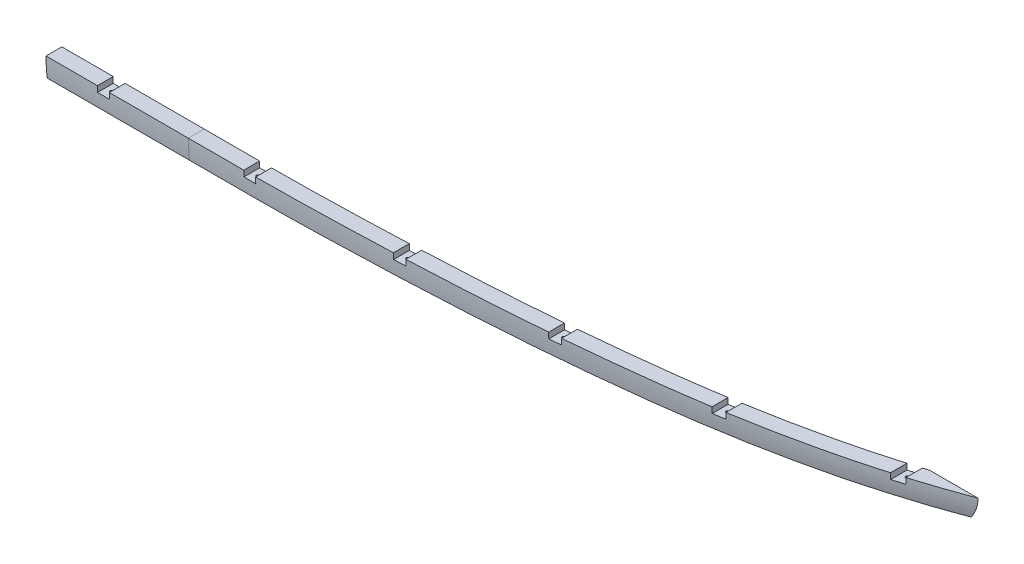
ISO-10303-21;
HEADER;
FILE_DESCRIPTION(('STEP AP214'),'2;1');
FILE_NAME('part.step','',(''),(''),'','','');
FILE_SCHEMA(('AUTOMOTIVE_DESIGN { 1 0 10303 214 1 1 1 1 }'));
ENDSEC;
DATA;
#1=APPLICATION_CONTEXT('core data for automotive mechanical design processes');
#2=APPLICATION_PROTOCOL_DEFINITION('international standard','automotive_design',2000,#1);
#3=PRODUCT_CONTEXT('',#1,'mechanical');
#4=PRODUCT('Part','Part','',(#3));
#5=PRODUCT_RELATED_PRODUCT_CATEGORY('part','',(#4));
#6=PRODUCT_DEFINITION_FORMATION('','',#4);
#7=PRODUCT_DEFINITION_CONTEXT('part definition',#1,'design');
#8=PRODUCT_DEFINITION('design','',#6,#7);
#9=PRODUCT_DEFINITION_SHAPE('','',#8);
#10=(LENGTH_UNIT() NAMED_UNIT(*) SI_UNIT(.MILLI.,.METRE.));
#11=(NAMED_UNIT(*) PLANE_ANGLE_UNIT() SI_UNIT($,.RADIAN.));
#12=(NAMED_UNIT(*) SI_UNIT($,.STERADIAN.) SOLID_ANGLE_UNIT());
#13=UNCERTAINTY_MEASURE_WITH_UNIT(LENGTH_MEASURE(1.E-05),#10,'distance_accuracy_value','');
#14=(GEOMETRIC_REPRESENTATION_CONTEXT(3) GLOBAL_UNCERTAINTY_ASSIGNED_CONTEXT((#13)) GLOBAL_UNIT_ASSIGNED_CONTEXT((#10,
#11,#12)) REPRESENTATION_CONTEXT('',''));
#15=CARTESIAN_POINT('',(0.,0.,0.));
#16=DIRECTION('',(0.,0.,1.));
#17=DIRECTION('',(1.,0.,0.));
#18=AXIS2_PLACEMENT_3D('',#15,#16,#17);
#19=CARTESIAN_POINT('',(-330.199999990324,7.58496376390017E-13,260.350000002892));
#20=DIRECTION('',(0.,-1.,0.));
#21=DIRECTION('',(0.,0.,-1.));
#22=AXIS2_PLACEMENT_3D('',#19,#20,#21);
#23=PLANE('',#22);
#24=DIRECTION('',(1.,0.,0.));
#25=VECTOR('',#24,1.);
#26=CARTESIAN_POINT('',(-330.199999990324,0.,234.949776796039));
#27=LINE('',#26,#25);
#28=CARTESIAN_POINT('',(-228.600001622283,7.01602316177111E-12,234.949776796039));
#29=VERTEX_POINT('',#28);
#30=CARTESIAN_POINT('',(-101.599999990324,0.,234.949776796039));
#31=VERTEX_POINT('',#30);
#32=EDGE_CURVE('E176',#29,#31,#27,.T.);
#33=ORIENTED_EDGE('',*,*,#32,.F.);
#34=DIRECTION('',(0.,0.,-1.));
#35=VECTOR('',#34,1.);
#36=CARTESIAN_POINT('',(-228.600001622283,8.4225803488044E-12,282.052001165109));
#37=LINE('',#36,#35);
#38=CARTESIAN_POINT('',(-228.600001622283,7.77451953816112E-12,260.350000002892));
#39=VERTEX_POINT('',#38);
#40=EDGE_CURVE('E141',#39,#29,#37,.T.);
#41=ORIENTED_EDGE('',*,*,#40,.F.);
#42=DIRECTION('',(1.,0.,0.));
#43=VECTOR('',#42,1.);
#44=CARTESIAN_POINT('',(-330.199999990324,7.58496376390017E-13,260.350000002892));
#45=LINE('',#44,#43);
#46=CARTESIAN_POINT('',(-101.599999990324,7.58496376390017E-13,260.350000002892));
#47=VERTEX_POINT('',#46);
#48=EDGE_CURVE('E180',#39,#47,#45,.T.);
#49=ORIENTED_EDGE('',*,*,#48,.T.);
#50=DIRECTION('',(0.,0.,-1.));
#51=VECTOR('',#50,1.);
#52=CARTESIAN_POINT('',(-101.599999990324,7.58496376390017E-13,260.350000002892));
#53=LINE('',#52,#51);
#54=EDGE_CURVE('E167',#47,#31,#53,.T.);
#55=ORIENTED_EDGE('',*,*,#54,.T.);
#56=EDGE_LOOP('',(#33,#41,#49,#55));
#57=FACE_BOUND('',#56,.T.);
#58=ADVANCED_FACE('F45',(#57),#23,.F.);
#59=CARTESIAN_POINT('',(-330.199999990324,0.,0.));
#60=DIRECTION('',(1.,0.,0.));
#61=DIRECTION('',(0.,0.,-1.));
#62=AXIS2_PLACEMENT_3D('',#59,#60,#61);
#63=CYLINDRICAL_SURFACE('',#62,260.350000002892);
#64=ORIENTED_EDGE('',*,*,#48,.F.);
#65=CARTESIAN_POINT('',(-228.600001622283,0.,0.));
#66=DIRECTION('',(1.,0.,0.));
#67=DIRECTION('',(0.,0.,-1.));
#68=AXIS2_PLACEMENT_3D('',#65,#66,#67);
#69=CIRCLE('',#68,260.350000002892);
#70=CARTESIAN_POINT('',(-228.600001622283,-9.52499999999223,260.175703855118));
#71=VERTEX_POINT('',#70);
#72=EDGE_CURVE('E154',#39,#71,#69,.T.);
#73=ORIENTED_EDGE('',*,*,#72,.T.);
#74=DIRECTION('',(1.,0.,0.));
#75=VECTOR('',#74,1.);
#76=CARTESIAN_POINT('',(-330.199999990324,-9.52499999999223,260.175703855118));
#77=LINE('',#76,#75);
#78=CARTESIAN_POINT('',(-247.650001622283,-9.52499999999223,260.175703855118));
#79=VERTEX_POINT('',#78);
#80=EDGE_CURVE('E147',#79,#71,#77,.T.);
#81=ORIENTED_EDGE('',*,*,#80,.F.);
#82=CARTESIAN_POINT('',(-247.650001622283,0.,0.));
#83=DIRECTION('',(-1.,0.,0.));
#84=DIRECTION('',(0.,0.,1.));
#85=AXIS2_PLACEMENT_3D('',#82,#83,#84);
#86=CIRCLE('',#85,260.350000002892);
#87=CARTESIAN_POINT('',(-247.650001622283,7.77451953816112E-12,260.350000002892));
#88=VERTEX_POINT('',#87);
#89=EDGE_CURVE('E151',#79,#88,#86,.T.);
#90=ORIENTED_EDGE('',*,*,#89,.T.);
#91=CARTESIAN_POINT('',(-330.199999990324,7.58496376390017E-13,260.350000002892));
#92=VERTEX_POINT('',#91);
#93=EDGE_CURVE('E181',#92,#88,#45,.T.);
#94=ORIENTED_EDGE('',*,*,#93,.F.);
#95=CARTESIAN_POINT('',(-330.199999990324,0.,0.));
#96=DIRECTION('',(-1.,0.,0.));
#97=DIRECTION('',(0.,0.,1.));
#98=AXIS2_PLACEMENT_3D('',#95,#96,#97);
#99=CIRCLE('',#98,260.350000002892);
#100=CARTESIAN_POINT('',(-330.199999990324,-31.7500000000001,258.406772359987));
#101=VERTEX_POINT('',#100);
#102=EDGE_CURVE('E158',#101,#92,#99,.T.);
#103=ORIENTED_EDGE('',*,*,#102,.F.);
#104=DIRECTION('',(1.,0.,0.));
#105=VECTOR('',#104,1.);
#106=CARTESIAN_POINT('',(-330.199999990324,-31.7500000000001,258.406772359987));
#107=LINE('',#106,#105);
#108=CARTESIAN_POINT('',(-101.599999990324,-31.7500000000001,258.406772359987));
#109=VERTEX_POINT('',#108);
#110=EDGE_CURVE('E164',#101,#109,#107,.T.);
#111=ORIENTED_EDGE('',*,*,#110,.T.);
#112=CARTESIAN_POINT('',(-101.599999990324,0.,0.));
#113=DIRECTION('',(-1.,0.,0.));
#114=DIRECTION('',(0.,0.,1.));
#115=AXIS2_PLACEMENT_3D('',#112,#113,#114);
#116=CIRCLE('',#115,260.350000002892);
#117=EDGE_CURVE('E157',#109,#47,#116,.T.);
#118=ORIENTED_EDGE('',*,*,#117,.T.);
#119=EDGE_LOOP('',(#64,#73,#81,#90,#94,#103,#111,#118));
#120=FACE_BOUND('',#119,.T.);
#121=ADVANCED_FACE('F47',(#120),#63,.T.);
#122=ORIENTED_EDGE('',*,*,#93,.T.);
#123=DIRECTION('',(0.,0.,1.));
#124=VECTOR('',#123,1.);
#125=CARTESIAN_POINT('',(-247.650001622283,8.4225803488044E-12,282.052001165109));
#126=LINE('',#125,#124);
#127=CARTESIAN_POINT('',(-247.650001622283,7.01602316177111E-12,234.949776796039));
#128=VERTEX_POINT('',#127);
#129=EDGE_CURVE('E144',#128,#88,#126,.T.);
#130=ORIENTED_EDGE('',*,*,#129,.F.);
#131=CARTESIAN_POINT('',(-330.199999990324,0.,234.949776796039));
#132=VERTEX_POINT('',#131);
#133=EDGE_CURVE('E177',#132,#128,#27,.T.);
#134=ORIENTED_EDGE('',*,*,#133,.F.);
#135=DIRECTION('',(0.,0.,-1.));
#136=VECTOR('',#135,1.);
#137=CARTESIAN_POINT('',(-330.199999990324,7.58496376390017E-13,260.350000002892));
#138=LINE('',#137,#136);
#139=EDGE_CURVE('E98',#92,#132,#138,.T.);
#140=ORIENTED_EDGE('',*,*,#139,.F.);
#141=EDGE_LOOP('',(#122,#130,#134,#140));
#142=FACE_BOUND('',#141,.T.);
#143=ADVANCED_FACE('F193',(#142),#23,.F.);
#144=CARTESIAN_POINT('',(-330.199999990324,-31.7500000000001,234.949776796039));
#145=DIRECTION('',(0.,0.,1.));
#146=DIRECTION('',(1.,0.,0.));
#147=AXIS2_PLACEMENT_3D('',#144,#145,#146);
#148=PLANE('',#147);
#149=DIRECTION('',(-1.,0.,0.));
#150=VECTOR('',#149,1.);
#151=CARTESIAN_POINT('',(-330.199999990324,-9.52499999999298,234.949776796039));
#152=LINE('',#151,#150);
#153=CARTESIAN_POINT('',(-228.600001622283,-9.52499999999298,234.949776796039));
#154=VERTEX_POINT('',#153);
#155=CARTESIAN_POINT('',(-247.650001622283,-9.52499999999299,234.949776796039));
#156=VERTEX_POINT('',#155);
#157=EDGE_CURVE('E183',#154,#156,#152,.T.);
#158=ORIENTED_EDGE('',*,*,#157,.F.);
#159=DIRECTION('',(0.,1.,0.));
#160=VECTOR('',#159,1.);
#161=CARTESIAN_POINT('',(-228.600001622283,-31.7500000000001,234.949776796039));
#162=LINE('',#161,#160);
#163=EDGE_CURVE('E12',#154,#29,#162,.T.);
#164=ORIENTED_EDGE('',*,*,#163,.T.);
#165=ORIENTED_EDGE('',*,*,#32,.T.);
#166=DIRECTION('',(0.,-1.,0.));
#167=VECTOR('',#166,1.);
#168=CARTESIAN_POINT('',(-101.599999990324,-31.7500000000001,234.949776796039));
#169=LINE('',#168,#167);
#170=CARTESIAN_POINT('',(-101.599999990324,-31.7500000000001,234.949776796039));
#171=VERTEX_POINT('',#170);
#172=EDGE_CURVE('E170',#31,#171,#169,.T.);
#173=ORIENTED_EDGE('',*,*,#172,.T.);
#174=DIRECTION('',(1.,0.,0.));
#175=VECTOR('',#174,1.);
#176=CARTESIAN_POINT('',(-330.199999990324,-31.7500000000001,234.949776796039));
#177=LINE('',#176,#175);
#178=CARTESIAN_POINT('',(-330.199999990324,-31.7500000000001,234.949776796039));
#179=VERTEX_POINT('',#178);
#180=EDGE_CURVE('E174',#179,#171,#177,.T.);
#181=ORIENTED_EDGE('',*,*,#180,.F.);
#182=DIRECTION('',(0.,-1.,0.));
#183=VECTOR('',#182,1.);
#184=CARTESIAN_POINT('',(-330.199999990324,-31.7500000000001,234.949776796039));
#185=LINE('',#184,#183);
#186=EDGE_CURVE('E161',#132,#179,#185,.T.);
#187=ORIENTED_EDGE('',*,*,#186,.F.);
#188=ORIENTED_EDGE('',*,*,#133,.T.);
#189=DIRECTION('',(0.,-1.,0.));
#190=VECTOR('',#189,1.);
#191=CARTESIAN_POINT('',(-247.650001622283,-31.7500000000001,234.949776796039));
#192=LINE('',#191,#190);
#193=EDGE_CURVE('E53',#128,#156,#192,.T.);
#194=ORIENTED_EDGE('',*,*,#193,.T.);
#195=EDGE_LOOP('',(#158,#164,#165,#173,#181,#187,#188,#194));
#196=FACE_BOUND('',#195,.T.);
#197=ADVANCED_FACE('F187',(#196),#148,.F.);
#198=CARTESIAN_POINT('',(-330.199999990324,-31.7500000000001,258.406772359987));
#199=DIRECTION('',(0.,1.,0.));
#200=DIRECTION('',(0.,0.,1.));
#201=AXIS2_PLACEMENT_3D('',#198,#199,#200);
#202=PLANE('',#201);
#203=DIRECTION('',(0.,0.,1.));
#204=VECTOR('',#203,1.);
#205=CARTESIAN_POINT('',(-101.599999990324,-31.7500000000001,258.406772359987));
#206=LINE('',#205,#204);
#207=EDGE_CURVE('E90',#171,#109,#206,.T.);
#208=ORIENTED_EDGE('',*,*,#207,.T.);
#209=ORIENTED_EDGE('',*,*,#110,.F.);
#210=DIRECTION('',(0.,0.,1.));
#211=VECTOR('',#210,1.);
#212=CARTESIAN_POINT('',(-330.199999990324,-31.7500000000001,258.406772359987));
#213=LINE('',#212,#211);
#214=EDGE_CURVE('E69',#179,#101,#213,.T.);
#215=ORIENTED_EDGE('',*,*,#214,.F.);
#216=ORIENTED_EDGE('',*,*,#180,.T.);
#217=EDGE_LOOP('',(#208,#209,#215,#216));
#218=FACE_BOUND('',#217,.T.);
#219=ADVANCED_FACE('F211',(#218),#202,.F.);
#220=CARTESIAN_POINT('',(-330.199999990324,0.,0.));
#221=DIRECTION('',(-1.,0.,0.));
#222=DIRECTION('',(0.,0.,1.));
#223=AXIS2_PLACEMENT_3D('',#220,#221,#222);
#224=PLANE('',#223);
#225=ORIENTED_EDGE('',*,*,#102,.T.);
#226=ORIENTED_EDGE('',*,*,#139,.T.);
#227=ORIENTED_EDGE('',*,*,#186,.T.);
#228=ORIENTED_EDGE('',*,*,#214,.T.);
#229=EDGE_LOOP('',(#225,#226,#227,#228));
#230=FACE_BOUND('',#229,.T.);
#231=ADVANCED_FACE('F213',(#230),#224,.T.);
#232=CARTESIAN_POINT('',(-101.599999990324,0.,0.));
#233=DIRECTION('',(-1.,0.,0.));
#234=DIRECTION('',(0.,0.,1.));
#235=AXIS2_PLACEMENT_3D('',#232,#233,#234);
#236=PLANE('',#235);
#237=ORIENTED_EDGE('',*,*,#117,.F.);
#238=ORIENTED_EDGE('',*,*,#207,.F.);
#239=ORIENTED_EDGE('',*,*,#172,.F.);
#240=ORIENTED_EDGE('',*,*,#54,.F.);
#241=EDGE_LOOP('',(#237,#238,#239,#240));
#242=FACE_BOUND('',#241,.T.);
#243=ADVANCED_FACE('F209',(#242),#236,.F.);
#244=CARTESIAN_POINT('',(-228.600001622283,-9.52499999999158,282.052001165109));
#245=DIRECTION('',(1.,0.,0.));
#246=DIRECTION('',(0.,0.,-1.));
#247=AXIS2_PLACEMENT_3D('',#244,#245,#246);
#248=PLANE('',#247);
#249=ORIENTED_EDGE('',*,*,#40,.T.);
#250=ORIENTED_EDGE('',*,*,#163,.F.);
#251=DIRECTION('',(0.,0.,-1.));
#252=VECTOR('',#251,1.);
#253=CARTESIAN_POINT('',(-228.600001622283,-9.52499999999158,282.052001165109));
#254=LINE('',#253,#252);
#255=EDGE_CURVE('E60',#71,#154,#254,.T.);
#256=ORIENTED_EDGE('',*,*,#255,.F.);
#257=ORIENTED_EDGE('',*,*,#72,.F.);
#258=EDGE_LOOP('',(#249,#250,#256,#257));
#259=FACE_BOUND('',#258,.T.);
#260=ADVANCED_FACE('F201',(#259),#248,.F.);
#261=CARTESIAN_POINT('',(-247.650001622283,-9.52499999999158,282.052001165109));
#262=DIRECTION('',(-1.,0.,0.));
#263=DIRECTION('',(0.,0.,1.));
#264=AXIS2_PLACEMENT_3D('',#261,#262,#263);
#265=PLANE('',#264);
#266=DIRECTION('',(0.,0.,1.));
#267=VECTOR('',#266,1.);
#268=CARTESIAN_POINT('',(-247.650001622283,-9.52499999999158,282.052001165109));
#269=LINE('',#268,#267);
#270=EDGE_CURVE('E143',#156,#79,#269,.T.);
#271=ORIENTED_EDGE('',*,*,#270,.F.);
#272=ORIENTED_EDGE('',*,*,#193,.F.);
#273=ORIENTED_EDGE('',*,*,#129,.T.);
#274=ORIENTED_EDGE('',*,*,#89,.F.);
#275=EDGE_LOOP('',(#271,#272,#273,#274));
#276=FACE_BOUND('',#275,.T.);
#277=ADVANCED_FACE('F192',(#276),#265,.F.);
#278=CARTESIAN_POINT('',(-228.600001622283,-9.52499999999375,209.170142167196));
#279=DIRECTION('',(0.,1.,0.));
#280=DIRECTION('',(0.,0.,1.));
#281=AXIS2_PLACEMENT_3D('',#278,#279,#280);
#282=PLANE('',#281);
#283=CARTESIAN_POINT('',(-238.125001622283,-9.52499999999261,247.650862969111));
#284=DIRECTION('',(0.,1.,0.));
#285=DIRECTION('',(0.,0.,1.));
#286=AXIS2_PLACEMENT_3D('',#283,#284,#285);
#287=CIRCLE('',#286,2.0828);
#288=CARTESIAN_POINT('',(-238.125001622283,-9.52499999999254,249.733662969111));
#289=VERTEX_POINT('',#288);
#290=EDGE_CURVE('E138',#289,#289,#287,.T.);
#291=ORIENTED_EDGE('',*,*,#290,.F.);
#292=EDGE_LOOP('',(#291));
#293=FACE_BOUND('',#292,.T.);
#294=ORIENTED_EDGE('',*,*,#80,.T.);
#295=ORIENTED_EDGE('',*,*,#255,.T.);
#296=ORIENTED_EDGE('',*,*,#157,.T.);
#297=ORIENTED_EDGE('',*,*,#270,.T.);
#298=EDGE_LOOP('',(#294,#295,#296,#297));
#299=FACE_BOUND('',#298,.T.);
#300=ADVANCED_FACE('F199',(#293,#299),#282,.T.);
#301=CARTESIAN_POINT('',(-238.125001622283,-9.52499999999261,247.650862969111));
#302=DIRECTION('',(0.,1.,0.));
#303=DIRECTION('',(0.,0.,1.));
#304=AXIS2_PLACEMENT_3D('',#301,#302,#303);
#305=CYLINDRICAL_SURFACE('',#304,2.0828);
#306=CARTESIAN_POINT('',(-238.125001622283,-17.8559967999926,247.650862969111));
#307=DIRECTION('',(0.,1.,0.));
#308=DIRECTION('',(0.,0.,1.));
#309=AXIS2_PLACEMENT_3D('',#306,#307,#308);
#310=CIRCLE('',#309,2.0828);
#311=CARTESIAN_POINT('',(-238.125001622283,-17.8559967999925,249.733662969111));
#312=VERTEX_POINT('',#311);
#313=EDGE_CURVE('E133',#312,#312,#310,.T.);
#314=ORIENTED_EDGE('',*,*,#313,.F.);
#315=EDGE_LOOP('',(#314));
#316=FACE_BOUND('',#315,.T.);
#317=ORIENTED_EDGE('',*,*,#290,.T.);
#318=EDGE_LOOP('',(#317));
#319=FACE_BOUND('',#318,.T.);
#320=ADVANCED_FACE('F282',(#316,#319),#305,.F.);
#321=CARTESIAN_POINT('',(-236.397801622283,-17.8559967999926,247.650862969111));
#322=DIRECTION('',(0.,-1.,0.));
#323=DIRECTION('',(0.,0.,-1.));
#324=AXIS2_PLACEMENT_3D('',#321,#322,#323);
#325=PLANE('',#324);
#326=CARTESIAN_POINT('',(-238.125001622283,-17.8559967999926,247.650862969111));
#327=DIRECTION('',(0.,1.,0.));
#328=DIRECTION('',(0.,0.,1.));
#329=AXIS2_PLACEMENT_3D('',#326,#327,#328);
#330=CIRCLE('',#329,1.72719999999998);
#331=CARTESIAN_POINT('',(-238.125001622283,-17.8559967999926,249.378062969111));
#332=VERTEX_POINT('',#331);
#333=EDGE_CURVE('E130',#332,#332,#330,.T.);
#334=ORIENTED_EDGE('',*,*,#333,.F.);
#335=EDGE_LOOP('',(#334));
#336=FACE_BOUND('',#335,.T.);
#337=ORIENTED_EDGE('',*,*,#313,.T.);
#338=EDGE_LOOP('',(#337));
#339=FACE_BOUND('',#338,.T.);
#340=ADVANCED_FACE('F292',(#336,#339),#325,.F.);
#341=CARTESIAN_POINT('',(-238.125001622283,-9.52499999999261,247.650862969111));
#342=DIRECTION('',(0.,1.,0.));
#343=DIRECTION('',(0.,0.,1.));
#344=AXIS2_PLACEMENT_3D('',#341,#342,#343);
#345=CYLINDRICAL_SURFACE('',#344,1.72719999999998);
#346=CARTESIAN_POINT('',(-238.125001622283,-21.8190063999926,247.650862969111));
#347=DIRECTION('',(0.,1.,0.));
#348=DIRECTION('',(0.,0.,1.));
#349=AXIS2_PLACEMENT_3D('',#346,#347,#348);
#350=CIRCLE('',#349,1.72719999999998);
#351=CARTESIAN_POINT('',(-238.125001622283,-21.8190063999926,249.378062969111));
#352=VERTEX_POINT('',#351);
#353=EDGE_CURVE('E128',#352,#352,#350,.T.);
#354=ORIENTED_EDGE('',*,*,#353,.F.);
#355=EDGE_LOOP('',(#354));
#356=FACE_BOUND('',#355,.T.);
#357=ORIENTED_EDGE('',*,*,#333,.T.);
#358=EDGE_LOOP('',(#357));
#359=FACE_BOUND('',#358,.T.);
#360=ADVANCED_FACE('F124',(#356,#359),#345,.F.);
#361=CARTESIAN_POINT('',(-238.125001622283,-21.8190063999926,247.650862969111));
#362=DIRECTION('',(0.,1.,0.));
#363=DIRECTION('',(0.,0.,1.));
#364=AXIS2_PLACEMENT_3D('',#361,#362,#363);
#365=CONICAL_SURFACE('',#364,1.72719999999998,1.02974425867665);
#366=CARTESIAN_POINT('',(-238.125001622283,-22.856812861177,247.650862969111));
#367=VERTEX_POINT('',#366);
#368=VERTEX_LOOP('',#367);
#369=FACE_BOUND('',#368,.T.);
#370=ORIENTED_EDGE('',*,*,#353,.T.);
#371=EDGE_LOOP('',(#370));
#372=FACE_BOUND('',#371,.T.);
#373=ADVANCED_FACE('F121',(#369,#372),#365,.F.);
#374=CLOSED_SHELL('',(#58,#121,#143,#197,#219,#231,#243,#260,#277,#300,#320,#340,#360,#373));
#375=MANIFOLD_SOLID_BREP('B2',#374);
#376=CARTESIAN_POINT('',(534.422572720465,-9.525,259.022249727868));
#377=DIRECTION('',(0.,-1.,0.));
#378=DIRECTION('',(0.,0.,-1.));
#379=AXIS2_PLACEMENT_3D('',#376,#377,#378);
#380=PLANE('',#379);
#381=DIRECTION('',(0.,0.,-1.));
#382=VECTOR('',#381,1.);
#383=CARTESIAN_POINT('',(946.149998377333,-9.525,103.438565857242));
#384=LINE('',#383,#382);
#385=CARTESIAN_POINT('',(946.149998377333,-9.525,156.0331716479));
#386=VERTEX_POINT('',#385);
#387=CARTESIAN_POINT('',(946.149998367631,-9.52500000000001,129.744661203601));
#388=VERTEX_POINT('',#387);
#389=EDGE_CURVE('E351',#386,#388,#384,.T.);
#390=ORIENTED_EDGE('',*,*,#389,.T.);
#391=CARTESIAN_POINT('',(-3070.65215490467,-9.52500000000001,94.639891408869));
#392=CARTESIAN_POINT('',(-2046.40956664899,-9.52500000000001,237.710681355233));
#393=CARTESIAN_POINT('',(-1024.8947954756,-9.52500000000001,234.898762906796));
#394=CARTESIAN_POINT('',(2.7463275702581,-9.52500000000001,234.951167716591));
#395=CARTESIAN_POINT('',(8.8188747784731,-9.52500000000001,234.93803628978));
#396=CARTESIAN_POINT('',(20.9633487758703,-9.52500000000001,234.87859364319));
#397=CARTESIAN_POINT('',(39.1792048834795,-9.52500000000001,234.74371053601));
#398=CARTESIAN_POINT('',(57.3926984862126,-9.52500000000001,234.482481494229));
#399=CARTESIAN_POINT('',(93.8170721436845,-9.52500000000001,233.820251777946));
#400=CARTESIAN_POINT('',(118.096503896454,-9.52500000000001,233.19244118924));
#401=CARTESIAN_POINT('',(166.651240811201,-9.52500000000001,231.716131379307));
#402=CARTESIAN_POINT('',(190.926726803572,-9.52500000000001,230.877302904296));
#403=CARTESIAN_POINT('',(239.473167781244,-9.52500000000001,228.957329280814));
#404=CARTESIAN_POINT('',(263.743135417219,-9.52500000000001,227.87477772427));
#405=CARTESIAN_POINT('',(312.257838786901,-9.52500000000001,225.415648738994));
#406=CARTESIAN_POINT('',(336.504717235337,-9.52500000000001,224.039778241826));
#407=CARTESIAN_POINT('',(384.973238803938,-9.52500000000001,220.935512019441));
#408=CARTESIAN_POINT('',(409.194867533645,-9.52500000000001,219.206915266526));
#409=CARTESIAN_POINT('',(457.608437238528,-9.52500000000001,215.334998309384));
#410=CARTESIAN_POINT('',(481.799938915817,-9.52500000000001,213.185541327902));
#411=CARTESIAN_POINT('',(518.064441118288,-9.52500000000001,209.643545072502));
#412=CARTESIAN_POINT('',(530.148863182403,-9.52500000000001,208.410559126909));
#413=CARTESIAN_POINT('',(554.310403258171,-9.52500000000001,205.842553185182));
#414=CARTESIAN_POINT('',(566.38121653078,-9.52500000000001,204.510901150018));
#415=CARTESIAN_POINT('',(602.551579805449,-9.52500000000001,200.341319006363));
#416=CARTESIAN_POINT('',(626.609600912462,-9.52500000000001,197.321969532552));
#417=CARTESIAN_POINT('',(674.553245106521,-9.52500000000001,190.539650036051));
#418=CARTESIAN_POINT('',(698.436657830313,-9.52500000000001,186.767145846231));
#419=CARTESIAN_POINT('',(734.129420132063,-9.52500000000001,180.537482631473));
#420=CARTESIAN_POINT('',(746.004996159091,-9.52500000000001,178.365984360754));
#421=CARTESIAN_POINT('',(769.712255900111,-9.52500000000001,173.833662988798));
#422=CARTESIAN_POINT('',(781.543893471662,-9.52500000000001,171.472640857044));
#423=CARTESIAN_POINT('',(816.964640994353,-9.52500000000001,164.06967078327));
#424=CARTESIAN_POINT('',(840.479552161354,-9.52500000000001,158.707674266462));
#425=CARTESIAN_POINT('',(887.26743801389,-9.52500000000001,146.940113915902));
#426=CARTESIAN_POINT('',(910.54127033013,-9.52500000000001,140.538249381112));
#427=CARTESIAN_POINT('',(945.252593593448,-9.52500000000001,130.075253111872));
#428=CARTESIAN_POINT('',(956.789604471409,-9.52500000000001,126.443390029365));
#429=CARTESIAN_POINT('',(979.794414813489,-9.52500000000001,118.881127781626));
#430=CARTESIAN_POINT('',(1002.73074739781,-9.52500000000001,111.023493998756));
#431=CARTESIAN_POINT('',(1025.53280895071,-9.52500000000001,102.58669638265));
#432=CARTESIAN_POINT('',(1042.58492404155,-9.52500000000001,96.0458824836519));
#433=CARTESIAN_POINT('',(1048.26072300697,-9.52500000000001,93.8300714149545));
#434=CARTESIAN_POINT('',(1415.64050338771,-9.52500000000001,-52.0840689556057));
#435=CARTESIAN_POINT('',(1745.18928861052,-9.52500000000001,-334.480421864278));
#436=CARTESIAN_POINT('',(1573.73315290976,-9.52500000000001,-2777.90828872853));
#437=B_SPLINE_CURVE_WITH_KNOTS('',3,(#391,#392,#393,#394,#395,#396,#397,#398,#399,#400,#401,
#402,#403,#404,#405,#406,#407,#408,#409,#410,#411,#412,#413,#414,#415,#416,#417,#418,#419,#420,
#421,#422,#423,#424,#425,#426,#427,#428,#429,#430,#431,#432,#433,#434,#435,#436),.UNSPECIFIED.,
.F.,.F.,(4,2,2,1,2,2,2,2,2,2,2,2,2,2,2,2,2,2,2,2,1,2,2,4),(-2.56594304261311,0.0625000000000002,
0.0781250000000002,0.0937500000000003,0.125,0.187500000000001,0.250000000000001,
0.312500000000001,0.375000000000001,0.437500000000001,0.500000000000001,0.531250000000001,
0.562500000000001,0.625000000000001,0.687500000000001,0.718750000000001,0.750000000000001,
0.812500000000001,0.875000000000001,0.90625,0.9375,0.96875,0.984375,1.98157335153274),.UNSPECIFIED.);
#438=CARTESIAN_POINT('',(927.099998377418,-9.525,135.530492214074));
#439=VERTEX_POINT('',#438);
#440=EDGE_CURVE('E938',#439,#388,#437,.T.);
#441=ORIENTED_EDGE('',*,*,#440,.F.);
#442=DIRECTION('',(0.,0.,1.));
#443=VECTOR('',#442,1.);
#444=CARTESIAN_POINT('',(927.099998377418,-9.525,109.017910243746));
#445=LINE('',#444,#443);
#446=CARTESIAN_POINT('',(927.099998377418,-9.525,161.723432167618));
#447=VERTEX_POINT('',#446);
#448=EDGE_CURVE('E584',#439,#447,#445,.T.);
#449=ORIENTED_EDGE('',*,*,#448,.T.);
#450=CARTESIAN_POINT('',(946.149998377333,-9.525,156.0331716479));
#451=CARTESIAN_POINT('',(945.35781155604,-9.525,156.275484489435));
#452=CARTESIAN_POINT('',(944.565423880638,-9.525,156.517140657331));
#453=CARTESIAN_POINT('',(942.980256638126,-9.525,156.999141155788));
#454=CARTESIAN_POINT('',(942.187477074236,-9.525,157.239485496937));
#455=CARTESIAN_POINT('',(940.601527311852,-9.525,157.718866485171));
#456=CARTESIAN_POINT('',(939.808357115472,-9.525,157.957903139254));
#457=CARTESIAN_POINT('',(938.221627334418,-9.525,158.434672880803));
#458=CARTESIAN_POINT('',(937.428067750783,-9.525,158.672405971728));
#459=CARTESIAN_POINT('',(935.840560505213,-9.525,159.146572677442));
#460=CARTESIAN_POINT('',(935.046612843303,-9.525,159.383006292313));
#461=CARTESIAN_POINT('',(933.458330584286,-9.525,159.854578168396));
#462=CARTESIAN_POINT('',(932.663995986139,-9.525,160.089716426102));
#463=CARTESIAN_POINT('',(931.074941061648,-9.525,160.558701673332));
#464=CARTESIAN_POINT('',(930.280220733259,-9.525,160.792548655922));
#465=CARTESIAN_POINT('',(928.690395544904,-9.525,161.258955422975));
#466=CARTESIAN_POINT('',(927.895290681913,-9.525,161.491515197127));
#467=CARTESIAN_POINT('',(927.099998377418,-9.525,161.723432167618));
#468=B_SPLINE_CURVE_WITH_KNOTS('',3,(#450,#451,#452,#453,#454,#455,#456,#457,#458,#459,#460,
#461,#462,#463,#464,#465,#466,#467),.UNSPECIFIED.,.F.,.F.,(4,2,2,2,2,2,2,2,4),(0.,
2.48525205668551,4.9704840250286,7.4557026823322,9.94091474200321,12.4261266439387,
14.9113452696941,17.3965772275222,19.8818290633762),.UNSPECIFIED.);
#469=EDGE_CURVE('E588',#386,#447,#468,.T.);
#470=ORIENTED_EDGE('',*,*,#469,.F.);
#471=EDGE_LOOP('',(#390,#441,#449,#470));
#472=FACE_BOUND('',#471,.T.);
#473=CARTESIAN_POINT('',(936.624998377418,-9.525,145.372528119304));
#474=DIRECTION('',(0.,1.,0.));
#475=DIRECTION('',(0.,0.,1.));
#476=AXIS2_PLACEMENT_3D('',#473,#474,#475);
#477=CIRCLE('',#476,2.08280000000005);
#478=CARTESIAN_POINT('',(936.624998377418,-9.525,147.455328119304));
#479=VERTEX_POINT('',#478);
#480=EDGE_CURVE('E527',#479,#479,#477,.T.);
#481=ORIENTED_EDGE('',*,*,#480,.F.);
#482=EDGE_LOOP('',(#481));
#483=FACE_BOUND('',#482,.T.);
#484=ADVANCED_FACE('F334',(#472,#483),#380,.F.);
#485=CARTESIAN_POINT('',(534.422572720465,-9.525,259.022249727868));
#486=DIRECTION('',(0.,-1.,0.));
#487=DIRECTION('',(0.,0.,-1.));
#488=AXIS2_PLACEMENT_3D('',#485,#486,#487);
#489=PLANE('',#488);
#490=DIRECTION('',(0.,0.,-1.));
#491=VECTOR('',#490,1.);
#492=CARTESIAN_POINT('',(711.199998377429,-9.525,158.745002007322));
#493=LINE('',#492,#491);
#494=CARTESIAN_POINT('',(711.199998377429,-9.525,210.053117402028));
#495=VERTEX_POINT('',#494);
#496=CARTESIAN_POINT('',(711.19999836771,-9.52500000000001,184.511143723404));
#497=VERTEX_POINT('',#496);
#498=EDGE_CURVE('E359',#495,#497,#493,.T.);
#499=ORIENTED_EDGE('',*,*,#498,.T.);
#500=CARTESIAN_POINT('',(-3070.65215490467,-9.52500000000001,94.639891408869));
#501=CARTESIAN_POINT('',(-2046.40956664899,-9.52500000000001,237.710681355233));
#502=CARTESIAN_POINT('',(-1024.8947954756,-9.52500000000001,234.898762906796));
#503=CARTESIAN_POINT('',(2.7463275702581,-9.52500000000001,234.951167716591));
#504=CARTESIAN_POINT('',(8.8188747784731,-9.52500000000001,234.93803628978));
#505=CARTESIAN_POINT('',(20.9633487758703,-9.52500000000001,234.87859364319));
#506=CARTESIAN_POINT('',(39.1792048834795,-9.52500000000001,234.74371053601));
#507=CARTESIAN_POINT('',(57.3926984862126,-9.52500000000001,234.482481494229));
#508=CARTESIAN_POINT('',(93.8170721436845,-9.52500000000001,233.820251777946));
#509=CARTESIAN_POINT('',(118.096503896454,-9.52500000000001,233.19244118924));
#510=CARTESIAN_POINT('',(166.651240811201,-9.52500000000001,231.716131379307));
#511=CARTESIAN_POINT('',(190.926726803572,-9.52500000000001,230.877302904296));
#512=CARTESIAN_POINT('',(239.473167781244,-9.52500000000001,228.957329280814));
#513=CARTESIAN_POINT('',(263.743135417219,-9.52500000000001,227.87477772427));
#514=CARTESIAN_POINT('',(312.257838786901,-9.52500000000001,225.415648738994));
#515=CARTESIAN_POINT('',(336.504717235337,-9.52500000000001,224.039778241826));
#516=CARTESIAN_POINT('',(384.973238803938,-9.52500000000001,220.935512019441));
#517=CARTESIAN_POINT('',(409.194867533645,-9.52500000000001,219.206915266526));
#518=CARTESIAN_POINT('',(457.608437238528,-9.52500000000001,215.334998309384));
#519=CARTESIAN_POINT('',(481.799938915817,-9.52500000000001,213.185541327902));
#520=CARTESIAN_POINT('',(518.064441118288,-9.52500000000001,209.643545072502));
#521=CARTESIAN_POINT('',(530.148863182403,-9.52500000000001,208.410559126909));
#522=CARTESIAN_POINT('',(554.310403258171,-9.52500000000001,205.842553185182));
#523=CARTESIAN_POINT('',(566.38121653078,-9.52500000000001,204.510901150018));
#524=CARTESIAN_POINT('',(602.551579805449,-9.52500000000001,200.341319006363));
#525=CARTESIAN_POINT('',(626.609600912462,-9.52500000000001,197.321969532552));
#526=CARTESIAN_POINT('',(674.553245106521,-9.52500000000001,190.539650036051));
#527=CARTESIAN_POINT('',(698.436657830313,-9.52500000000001,186.767145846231));
#528=CARTESIAN_POINT('',(734.129420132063,-9.52500000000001,180.537482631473));
#529=CARTESIAN_POINT('',(746.004996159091,-9.52500000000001,178.365984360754));
#530=CARTESIAN_POINT('',(769.712255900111,-9.52500000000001,173.833662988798));
#531=CARTESIAN_POINT('',(781.543893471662,-9.52500000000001,171.472640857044));
#532=CARTESIAN_POINT('',(816.964640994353,-9.52500000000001,164.06967078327));
#533=CARTESIAN_POINT('',(840.479552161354,-9.52500000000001,158.707674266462));
#534=CARTESIAN_POINT('',(887.26743801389,-9.52500000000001,146.940113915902));
#535=CARTESIAN_POINT('',(910.54127033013,-9.52500000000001,140.538249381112));
#536=CARTESIAN_POINT('',(945.252593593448,-9.52500000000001,130.075253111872));
#537=CARTESIAN_POINT('',(956.789604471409,-9.52500000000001,126.443390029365));
#538=CARTESIAN_POINT('',(979.794414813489,-9.52500000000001,118.881127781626));
#539=CARTESIAN_POINT('',(1002.73074739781,-9.52500000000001,111.023493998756));
#540=CARTESIAN_POINT('',(1025.53280895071,-9.52500000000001,102.58669638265));
#541=CARTESIAN_POINT('',(1042.58492404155,-9.52500000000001,96.0458824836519));
#542=CARTESIAN_POINT('',(1048.26072300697,-9.52500000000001,93.8300714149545));
#543=CARTESIAN_POINT('',(1415.64050338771,-9.52500000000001,-52.0840689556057));
#544=CARTESIAN_POINT('',(1745.18928861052,-9.52500000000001,-334.480421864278));
#545=CARTESIAN_POINT('',(1573.73315290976,-9.52500000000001,-2777.90828872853));
#546=B_SPLINE_CURVE_WITH_KNOTS('',3,(#500,#501,#502,#503,#504,#505,#506,#507,#508,#509,#510,
#511,#512,#513,#514,#515,#516,#517,#518,#519,#520,#521,#522,#523,#524,#525,#526,#527,#528,#529,
#530,#531,#532,#533,#534,#535,#536,#537,#538,#539,#540,#541,#542,#543,#544,#545),.UNSPECIFIED.,
.F.,.F.,(4,2,2,1,2,2,2,2,2,2,2,2,2,2,2,2,2,2,2,2,1,2,2,4),(-2.56594304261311,0.0625000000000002,
0.0781250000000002,0.0937500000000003,0.125,0.187500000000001,0.250000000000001,
0.312500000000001,0.375000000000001,0.437500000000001,0.500000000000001,0.531250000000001,
0.562500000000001,0.625000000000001,0.687500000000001,0.718750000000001,0.750000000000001,
0.812500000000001,0.875000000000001,0.90625,0.9375,0.96875,0.984375,1.98157335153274),.UNSPECIFIED.);
#547=CARTESIAN_POINT('',(692.149998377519,-9.525,187.654027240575));
#548=VERTEX_POINT('',#547);
#549=EDGE_CURVE('E898',#548,#497,#546,.T.);
#550=ORIENTED_EDGE('',*,*,#549,.F.);
#551=DIRECTION('',(0.,0.,1.));
#552=VECTOR('',#551,1.);
#553=CARTESIAN_POINT('',(692.149998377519,-9.525,161.924874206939));
#554=LINE('',#553,#552);
#555=CARTESIAN_POINT('',(692.149998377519,-9.525,213.163278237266));
#556=VERTEX_POINT('',#555);
#557=EDGE_CURVE('E637',#548,#556,#554,.T.);
#558=ORIENTED_EDGE('',*,*,#557,.T.);
#559=CARTESIAN_POINT('',(711.199998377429,-9.525,210.053117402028));
#560=CARTESIAN_POINT('',(708.027203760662,-9.525,210.584985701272));
#561=CARTESIAN_POINT('',(704.853306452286,-9.525,211.110099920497));
#562=CARTESIAN_POINT('',(698.503306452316,-9.525,212.14682019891));
#563=CARTESIAN_POINT('',(695.327203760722,-9.525,212.658426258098));
#564=CARTESIAN_POINT('',(692.149998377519,-9.525,213.163278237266));
#565=B_SPLINE_CURVE_WITH_KNOTS('',3,(#559,#560,#561,#562,#563,#564),.UNSPECIFIED.,.F.,.F.,(4,2,
4),(0.,9.65113058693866,19.3022611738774),.UNSPECIFIED.);
#566=EDGE_CURVE('E629',#495,#556,#565,.T.);
#567=ORIENTED_EDGE('',*,*,#566,.F.);
#568=EDGE_LOOP('',(#499,#550,#558,#567));
#569=FACE_BOUND('',#568,.T.);
#570=CARTESIAN_POINT('',(701.674998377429,-9.525,198.803613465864));
#571=DIRECTION('',(0.,1.,0.));
#572=DIRECTION('',(0.,0.,1.));
#573=AXIS2_PLACEMENT_3D('',#570,#571,#572);
#574=CIRCLE('',#573,2.08280000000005);
#575=CARTESIAN_POINT('',(701.674998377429,-9.525,200.886413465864));
#576=VERTEX_POINT('',#575);
#577=EDGE_CURVE('E539',#576,#576,#574,.T.);
#578=ORIENTED_EDGE('',*,*,#577,.F.);
#579=EDGE_LOOP('',(#578));
#580=FACE_BOUND('',#579,.T.);
#581=ADVANCED_FACE('F610',(#569,#580),#489,.F.);
#582=CARTESIAN_POINT('',(1096.30575386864,0.,260.377618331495));
#583=DIRECTION('',(0.,-1.,0.));
#584=DIRECTION('',(1.,0.,0.));
#585=AXIS2_PLACEMENT_3D('',#582,#583,#584);
#586=PLANE('',#585);
#587=CARTESIAN_POINT('',(-1187.45,-2.14764522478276E-13,0.793750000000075));
#588=CARTESIAN_POINT('',(-1187.41582639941,-2.10045062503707E-13,2.14485212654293));
#589=CARTESIAN_POINT('',(-1187.35078911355,-2.01063250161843E-13,4.71619414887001));
#590=CARTESIAN_POINT('',(-1187.0134288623,-1.869523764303E-13,8.75174252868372));
#591=CARTESIAN_POINT('',(-1186.47507361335,-1.72346646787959E-13,12.9254698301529));
#592=CARTESIAN_POINT('',(-1185.60677768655,-1.55742806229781E-13,17.6656455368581));
#593=CARTESIAN_POINT('',(-1184.39784787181,-1.3828640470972E-13,22.6439822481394));
#594=CARTESIAN_POINT('',(-1182.81805663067,-1.20315610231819E-13,27.7630904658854));
#595=CARTESIAN_POINT('',(-1180.9000462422,-1.02322052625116E-13,32.8827389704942));
#596=CARTESIAN_POINT('',(-1178.45058427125,0.,38.3646195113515));
#597=CARTESIAN_POINT('',(-1175.42025005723,0.,44.0192595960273));
#598=CARTESIAN_POINT('',(-1171.99485787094,0.,49.3799018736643));
#599=CARTESIAN_POINT('',(-1162.66570449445,0.,61.9168794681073));
#600=CARTESIAN_POINT('',(-1135.90498590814,0.,83.8406115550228));
#601=CARTESIAN_POINT('',(-1094.24342763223,1.86864655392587E-13,114.177065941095));
#602=CARTESIAN_POINT('',(-1042.34684056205,2.86427843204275E-13,141.77560733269));
#603=CARTESIAN_POINT('',(-991.223618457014,3.68605878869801E-13,164.408518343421));
#604=CARTESIAN_POINT('',(-940.26850637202,4.383592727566E-13,183.48584456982));
#605=CARTESIAN_POINT('',(-872.800317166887,5.16458855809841E-13,204.661680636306));
#606=CARTESIAN_POINT('',(-788.126145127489,5.92125596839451E-13,224.836541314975));
#607=CARTESIAN_POINT('',(-686.226676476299,6.5781179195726E-13,241.848338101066));
#608=CARTESIAN_POINT('',(-584.376798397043,7.00101945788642E-13,252.160122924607));
#609=CARTESIAN_POINT('',(-465.769527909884,7.31891836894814E-13,259.168263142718));
#610=CARTESIAN_POINT('',(-377.536944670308,7.41534100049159E-13,260.370064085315));
#611=CARTESIAN_POINT('',(-317.35321345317,7.45173680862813E-13,260.348501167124));
#612=CARTESIAN_POINT('',(-301.814810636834,7.46139827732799E-13,260.350515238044));
#613=CARTESIAN_POINT('',(-285.383466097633,7.47151929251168E-13,260.349905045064));
#614=CARTESIAN_POINT('',(-269.464917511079,7.48134936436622E-13,260.350027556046));
#615=CARTESIAN_POINT('',(-254.830951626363,7.49038103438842E-13,260.349992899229));
#616=CARTESIAN_POINT('',(-237.501096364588,7.50107830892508E-13,260.350002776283));
#617=CARTESIAN_POINT('',(-220.686068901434,7.51145734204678E-13,260.349999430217));
#618=CARTESIAN_POINT('',(-203.743111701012,7.52191548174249E-13,260.350000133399));
#619=CARTESIAN_POINT('',(-190.137919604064,7.5303133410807E-13,260.349999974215));
#620=CARTESIAN_POINT('',(-176.91664822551,7.53847423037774E-13,260.350000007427));
#621=CARTESIAN_POINT('',(-163.438709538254,7.54679354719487E-13,260.349999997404));
#622=CARTESIAN_POINT('',(-149.960576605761,7.55511298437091E-13,260.350000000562));
#623=CARTESIAN_POINT('',(-136.739809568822,7.56327356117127E-13,260.349999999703));
#624=CARTESIAN_POINT('',(-123.775328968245,7.57127594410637E-13,260.350000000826));
#625=CARTESIAN_POINT('',(-110.42660200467,7.57951550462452E-13,260.349999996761));
#626=CARTESIAN_POINT('',(-96.4355080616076,7.5881515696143E-13,260.350000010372));
#627=CARTESIAN_POINT('',(-84.6282308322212,7.59543966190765E-13,260.349999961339));
#628=CARTESIAN_POINT('',(-73.7156567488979,7.60217550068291E-13,260.350000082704));
#629=CARTESIAN_POINT('',(-64.9868798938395,7.60756336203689E-13,260.34999966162));
#630=CARTESIAN_POINT('',(-55.231805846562,7.61358477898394E-13,260.350001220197));
#631=CARTESIAN_POINT('',(-45.861466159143,7.61936840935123E-13,260.349993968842));
#632=CARTESIAN_POINT('',(-36.2370664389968,7.62530988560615E-13,260.35001610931));
#633=CARTESIAN_POINT('',(-26.0980257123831,7.63156501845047E-13,260.349923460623));
#634=CARTESIAN_POINT('',(-16.5997342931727,7.63744259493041E-13,260.350344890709));
#635=CARTESIAN_POINT('',(-7.42860193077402,7.64306909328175E-13,260.349358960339));
#636=CARTESIAN_POINT('',(48.1875926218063,7.67835019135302E-13,260.376618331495));
#637=CARTESIAN_POINT('',(152.453619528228,7.65954788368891E-13,257.994794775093));
#638=CARTESIAN_POINT('',(304.904930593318,7.53975679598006E-13,251.868678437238));
#639=CARTESIAN_POINT('',(440.424562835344,7.30880661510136E-13,242.858173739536));
#640=CARTESIAN_POINT('',(558.943048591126,6.97731638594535E-13,231.268650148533));
#641=CARTESIAN_POINT('',(660.71441054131,6.60911228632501E-13,218.923670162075));
#642=CARTESIAN_POINT('',(762.460039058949,6.0768095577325E-13,201.87917630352));
#643=CARTESIAN_POINT('',(864.373412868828,5.37584167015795E-13,180.000957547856));
#644=CARTESIAN_POINT('',(966.359094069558,4.43863598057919E-13,151.355344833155));
#645=CARTESIAN_POINT('',(1050.69033611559,3.42762459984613E-13,120.907964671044));
#646=CARTESIAN_POINT('',(1118.18156361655,2.47909338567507E-13,92.5477988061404));
#647=CARTESIAN_POINT('',(1151.54570991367,1.92603703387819E-13,76.1178044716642));
#648=CARTESIAN_POINT('',(1168.4,1.64665412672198E-13,67.8180000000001));
#649=B_SPLINE_CURVE_WITH_KNOTS('',3,(#587,#588,#589,#590,#591,#592,#593,#594,#595,#596,#597,
#598,#599,#600,#601,#602,#603,#604,#605,#606,#607,#608,#609,#610,#611,#612,#613,#614,#615,#616,
#617,#618,#619,#620,#621,#622,#623,#624,#625,#626,#627,#628,#629,#630,#631,#632,#633,#634,#635,
#636,#637,#638,#639,#640,#641,#642,#643,#644,#645,#646,#647,#648),.UNSPECIFIED.,.F.,.F.,(4,1,1,
1,1,1,1,1,1,1,1,1,1,1,1,1,1,1,1,1,1,1,1,1,1,1,1,1,1,1,1,1,1,1,1,1,1,1,1,1,1,1,1,1,1,1,1,1,1,1,1,
1,1,1,1,1,1,1,1,4),(0.,0.00164521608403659,0.00313108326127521,0.00492821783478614,
0.00676699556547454,0.00899569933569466,0.011161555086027,0.0132858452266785,0.0156483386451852,
0.0184669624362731,0.0210880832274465,0.0233881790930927,0.0374655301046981,0.0627504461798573,
0.0862304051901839,0.108796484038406,0.130815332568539,0.152430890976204,0.194859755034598,
0.236667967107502,0.278128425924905,0.319436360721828,0.381297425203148,0.385523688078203,
0.39271258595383,0.400215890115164,0.405529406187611,0.412093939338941,0.418033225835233,
0.426629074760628,0.432566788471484,0.43866183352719,0.443193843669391,0.448664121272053,
0.455071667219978,0.459603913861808,0.464760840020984,0.470856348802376,0.475856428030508,
0.48179545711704,0.485232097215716,0.489142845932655,0.492423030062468,0.497109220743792,
0.500551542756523,0.504141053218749,0.509453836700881,0.512116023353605,0.515307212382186,
0.577168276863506,0.63907261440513,0.701067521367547,0.742496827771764,0.784051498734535,
0.825859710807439,0.868057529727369,0.910905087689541,0.954729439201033,0.977131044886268,1.),.UNSPECIFIED.);
#650=CARTESIAN_POINT('',(711.199998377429,0.,210.268965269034));
#651=VERTEX_POINT('',#650);
#652=CARTESIAN_POINT('',(927.099998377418,0.,162.003685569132));
#653=VERTEX_POINT('',#652);
#654=EDGE_CURVE('E778',#651,#653,#649,.T.);
#655=ORIENTED_EDGE('',*,*,#654,.T.);
#656=DIRECTION('',(0.,0.,1.));
#657=VECTOR('',#656,1.);
#658=CARTESIAN_POINT('',(927.099998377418,0.,109.017910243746));
#659=LINE('',#658,#657);
#660=CARTESIAN_POINT('',(927.099998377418,0.,135.530403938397));
#661=VERTEX_POINT('',#660);
#662=EDGE_CURVE('E589',#661,#653,#659,.T.);
#663=ORIENTED_EDGE('',*,*,#662,.F.);
#664=CARTESIAN_POINT('',(711.199998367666,0.,184.511143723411));
#665=CARTESIAN_POINT('',(714.879381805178,0.,183.887855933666));
#666=CARTESIAN_POINT('',(718.556659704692,0.,183.255486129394));
#667=CARTESIAN_POINT('',(734.129420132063,0.,180.537482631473));
#668=CARTESIAN_POINT('',(746.004996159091,0.,178.365984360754));
#669=CARTESIAN_POINT('',(769.712255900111,0.,173.833662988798));
#670=CARTESIAN_POINT('',(781.543893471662,0.,171.472640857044));
#671=CARTESIAN_POINT('',(816.964640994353,0.,164.06967078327));
#672=CARTESIAN_POINT('',(840.479552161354,0.,158.707674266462));
#673=CARTESIAN_POINT('',(885.050604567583,0.,147.49766681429));
#674=CARTESIAN_POINT('',(906.12928848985,0.,141.746891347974));
#675=CARTESIAN_POINT('',(927.100022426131,0.,135.530485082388));
#676=B_SPLINE_CURVE_WITH_KNOTS('',3,(#664,#665,#666,#667,#668,#669,#670,#671,#672,#673,#674,
#675),.UNSPECIFIED.,.F.,.F.,(4,2,2,2,2,4),(0.677846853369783,0.687500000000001,
0.718750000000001,0.750000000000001,0.812500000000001,0.869077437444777),.UNSPECIFIED.);
#677=CARTESIAN_POINT('',(711.199998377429,0.,184.511155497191));
#678=VERTEX_POINT('',#677);
#679=EDGE_CURVE('E827',#678,#661,#676,.T.);
#680=ORIENTED_EDGE('',*,*,#679,.F.);
#681=DIRECTION('',(0.,0.,-1.));
#682=VECTOR('',#681,1.);
#683=CARTESIAN_POINT('',(711.199998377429,0.,158.745002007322));
#684=LINE('',#683,#682);
#685=EDGE_CURVE('E966',#651,#678,#684,.T.);
#686=ORIENTED_EDGE('',*,*,#685,.F.);
#687=EDGE_LOOP('',(#655,#663,#680,#686));
#688=FACE_BOUND('',#687,.T.);
#689=ADVANCED_FACE('F625',(#688),#586,.F.);
#690=CARTESIAN_POINT('',(476.24999837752,0.,239.123804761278));
#691=VERTEX_POINT('',#690);
#692=CARTESIAN_POINT('',(692.149998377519,0.,213.375979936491));
#693=VERTEX_POINT('',#692);
#694=EDGE_CURVE('E967',#691,#693,#649,.T.);
#695=ORIENTED_EDGE('',*,*,#694,.T.);
#696=DIRECTION('',(0.,0.,1.));
#697=VECTOR('',#696,1.);
#698=CARTESIAN_POINT('',(692.149998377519,0.,161.924874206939));
#699=LINE('',#698,#697);
#700=CARTESIAN_POINT('',(692.149998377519,0.,187.654027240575));
#701=VERTEX_POINT('',#700);
#702=EDGE_CURVE('E1016',#701,#693,#699,.T.);
#703=ORIENTED_EDGE('',*,*,#702,.F.);
#704=CARTESIAN_POINT('',(476.249998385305,0.,213.620035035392));
#705=CARTESIAN_POINT('',(486.161308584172,0.,212.723740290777));
#706=CARTESIAN_POINT('',(496.070064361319,0.,211.791761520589));
#707=CARTESIAN_POINT('',(518.064441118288,0.,209.643545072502));
#708=CARTESIAN_POINT('',(530.148863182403,0.,208.410559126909));
#709=CARTESIAN_POINT('',(554.310403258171,0.,205.842553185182));
#710=CARTESIAN_POINT('',(566.38121653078,0.,204.510901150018));
#711=CARTESIAN_POINT('',(602.551579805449,0.,200.341319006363));
#712=CARTESIAN_POINT('',(626.609600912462,0.,197.321969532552));
#713=CARTESIAN_POINT('',(664.467268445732,0.,191.966456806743));
#714=CARTESIAN_POINT('',(678.323449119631,0.,189.874148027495));
#715=CARTESIAN_POINT('',(692.149998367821,0.,187.654027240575));
#716=B_SPLINE_CURVE_WITH_KNOTS('',3,(#704,#705,#706,#707,#708,#709,#710,#711,#712,#713,#714,
#715),.UNSPECIFIED.,.F.,.F.,(4,2,2,2,2,4),(0.474390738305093,0.500000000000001,
0.531250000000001,0.562500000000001,0.625000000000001,0.661203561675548),.UNSPECIFIED.);
#717=CARTESIAN_POINT('',(476.249998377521,0.,213.620023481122));
#718=VERTEX_POINT('',#717);
#719=EDGE_CURVE('E821',#718,#701,#716,.T.);
#720=ORIENTED_EDGE('',*,*,#719,.F.);
#721=DIRECTION('',(0.,0.,-1.));
#722=VECTOR('',#721,1.);
#723=CARTESIAN_POINT('',(476.249998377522,0.,188.1156530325));
#724=LINE('',#723,#722);
#725=EDGE_CURVE('E656',#691,#718,#724,.T.);
#726=ORIENTED_EDGE('',*,*,#725,.F.);
#727=EDGE_LOOP('',(#695,#703,#720,#726));
#728=FACE_BOUND('',#727,.T.);
#729=ADVANCED_FACE('F1012',(#728),#586,.F.);
#730=CARTESIAN_POINT('',(946.150012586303,0.,129.744656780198));
#731=CARTESIAN_POINT('',(949.06091875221,0.,128.839079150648));
#732=CARTESIAN_POINT('',(951.969673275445,0.,127.924220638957));
#733=CARTESIAN_POINT('',(954.876257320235,0.,126.999999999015));
#734=B_SPLINE_CURVE_WITH_KNOTS('',3,(#730,#731,#732,#733),.UNSPECIFIED.,.F.,.F.,(4,4),
(0.886236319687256,0.894114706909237),.UNSPECIFIED.);
#735=CARTESIAN_POINT('',(946.149998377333,0.,129.744611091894));
#736=VERTEX_POINT('',#735);
#737=CARTESIAN_POINT('',(954.876257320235,0.,126.999999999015));
#738=VERTEX_POINT('',#737);
#739=EDGE_CURVE('E833',#736,#738,#734,.T.);
#740=ORIENTED_EDGE('',*,*,#739,.F.);
#741=DIRECTION('',(0.,0.,-1.));
#742=VECTOR('',#741,1.);
#743=CARTESIAN_POINT('',(946.149998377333,0.,103.438565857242));
#744=LINE('',#743,#742);
#745=CARTESIAN_POINT('',(946.149998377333,0.,156.323626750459));
#746=VERTEX_POINT('',#745);
#747=EDGE_CURVE('E578',#746,#736,#744,.T.);
#748=ORIENTED_EDGE('',*,*,#747,.F.);
#749=CARTESIAN_POINT('',(1032.62640334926,3.62917695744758E-13,127.000000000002));
#750=VERTEX_POINT('',#749);
#751=EDGE_CURVE('E774',#746,#750,#649,.T.);
#752=ORIENTED_EDGE('',*,*,#751,.T.);
#753=DIRECTION('',(1.,0.,0.));
#754=VECTOR('',#753,1.);
#755=CARTESIAN_POINT('',(954.876257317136,0.,127.));
#756=LINE('',#755,#754);
#757=EDGE_CURVE('E810',#738,#750,#756,.T.);
#758=ORIENTED_EDGE('',*,*,#757,.F.);
#759=EDGE_LOOP('',(#740,#748,#752,#758));
#760=FACE_BOUND('',#759,.T.);
#761=ADVANCED_FACE('F1131',(#760),#586,.F.);
#762=CARTESIAN_POINT('',(241.299998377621,0.,254.26036474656));
#763=VERTEX_POINT('',#762);
#764=CARTESIAN_POINT('',(457.199998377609,0.,240.792000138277));
#765=VERTEX_POINT('',#764);
#766=EDGE_CURVE('E969',#763,#765,#649,.T.);
#767=ORIENTED_EDGE('',*,*,#766,.T.);
#768=DIRECTION('',(0.,0.,1.));
#769=VECTOR('',#768,1.);
#770=CARTESIAN_POINT('',(457.199998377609,0.,189.803958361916));
#771=LINE('',#770,#769);
#772=CARTESIAN_POINT('',(457.199998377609,0.,215.298471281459));
#773=VERTEX_POINT('',#772);
#774=EDGE_CURVE('E645',#773,#765,#771,.T.);
#775=ORIENTED_EDGE('',*,*,#774,.F.);
#776=CARTESIAN_POINT('',(241.299998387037,0.,228.836644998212));
#777=CARTESIAN_POINT('',(256.87037232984,0.,228.162373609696));
#778=CARTESIAN_POINT('',(272.438026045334,0.,227.434048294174));
#779=CARTESIAN_POINT('',(312.257838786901,0.,225.415648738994));
#780=CARTESIAN_POINT('',(336.504717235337,0.,224.039778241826));
#781=CARTESIAN_POINT('',(384.973238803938,0.,220.935512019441));
#782=CARTESIAN_POINT('',(409.194867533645,0.,219.206915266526));
#783=CARTESIAN_POINT('',(441.336075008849,0.,216.636394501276));
#784=CARTESIAN_POINT('',(449.268855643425,0.,215.978894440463));
#785=CARTESIAN_POINT('',(457.199998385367,0.,215.298513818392));
#786=B_SPLINE_CURVE_WITH_KNOTS('',3,(#776,#777,#778,#779,#780,#781,#782,#783,#784,#785),
.UNSPECIFIED.,.F.,.F.,(4,2,2,2,4),(0.272402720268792,0.312500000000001,0.375000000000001,
0.437500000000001,0.457986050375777),.UNSPECIFIED.);
#787=CARTESIAN_POINT('',(241.299998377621,0.,228.836634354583));
#788=VERTEX_POINT('',#787);
#789=EDGE_CURVE('E815',#788,#773,#786,.T.);
#790=ORIENTED_EDGE('',*,*,#789,.F.);
#791=DIRECTION('',(0.,0.,-1.));
#792=VECTOR('',#791,1.);
#793=CARTESIAN_POINT('',(241.299998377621,0.,203.413216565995));
#794=LINE('',#793,#792);
#795=EDGE_CURVE('E989',#763,#788,#794,.T.);
#796=ORIENTED_EDGE('',*,*,#795,.F.);
#797=EDGE_LOOP('',(#767,#775,#790,#796));
#798=FACE_BOUND('',#797,.T.);
#799=ADVANCED_FACE('F1007',(#798),#586,.F.);
#800=CARTESIAN_POINT('',(6.34999837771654,0.,260.340024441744));
#801=VERTEX_POINT('',#800);
#802=CARTESIAN_POINT('',(222.249998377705,0.,255.055806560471));
#803=VERTEX_POINT('',#802);
#804=EDGE_CURVE('E972',#801,#803,#649,.T.);
#805=ORIENTED_EDGE('',*,*,#804,.T.);
#806=DIRECTION('',(0.,0.,1.));
#807=VECTOR('',#806,1.);
#808=CARTESIAN_POINT('',(222.249998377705,0.,204.214898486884));
#809=LINE('',#808,#807);
#810=CARTESIAN_POINT('',(222.249998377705,0.,229.635029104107));
#811=VERTEX_POINT('',#810);
#812=EDGE_CURVE('E981',#811,#803,#809,.T.);
#813=ORIENTED_EDGE('',*,*,#812,.F.);
#814=CARTESIAN_POINT('',(6.34999837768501,0.,234.939503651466));
#815=CARTESIAN_POINT('',(9.19710032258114,0.,234.932537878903));
#816=CARTESIAN_POINT('',(12.0441401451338,0.,234.922249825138));
#817=CARTESIAN_POINT('',(20.9633487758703,0.,234.87859364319));
#818=CARTESIAN_POINT('',(39.1792048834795,0.,234.74371053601));
#819=CARTESIAN_POINT('',(57.3926984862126,0.,234.482481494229));
#820=CARTESIAN_POINT('',(93.8170721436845,0.,233.820251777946));
#821=CARTESIAN_POINT('',(118.096503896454,0.,233.19244118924));
#822=CARTESIAN_POINT('',(166.651240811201,0.,231.716131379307));
#823=CARTESIAN_POINT('',(190.926726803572,0.,230.877302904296));
#824=CARTESIAN_POINT('',(217.549997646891,0.,229.824373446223));
#825=CARTESIAN_POINT('',(219.900017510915,0.,229.730281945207));
#826=CARTESIAN_POINT('',(222.249998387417,0.,229.635019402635));
#827=B_SPLINE_CURVE_WITH_KNOTS('',3,(#814,#815,#816,#817,#818,#819,#820,#821,#822,#823,#824,
#825,#826),.UNSPECIFIED.,.F.,.F.,(4,2,1,2,2,2,4),(0.0707992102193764,0.0781250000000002,
0.0937500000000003,0.125,0.187500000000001,0.250000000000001,0.256051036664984),.UNSPECIFIED.);
#828=CARTESIAN_POINT('',(6.34999837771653,0.,234.939490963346));
#829=VERTEX_POINT('',#828);
#830=EDGE_CURVE('E811',#829,#811,#827,.T.);
#831=ORIENTED_EDGE('',*,*,#830,.F.);
#832=DIRECTION('',(0.,0.,-1.));
#833=VECTOR('',#832,1.);
#834=CARTESIAN_POINT('',(6.34999837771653,0.,209.539427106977));
#835=LINE('',#834,#833);
#836=EDGE_CURVE('E717',#801,#829,#835,.T.);
#837=ORIENTED_EDGE('',*,*,#836,.F.);
#838=EDGE_LOOP('',(#805,#813,#831,#837));
#839=FACE_BOUND('',#838,.T.);
#840=ADVANCED_FACE('F794',(#839),#586,.F.);
#841=CARTESIAN_POINT('',(-101.599999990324,-31.7500000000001,260.377618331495));
#842=DIRECTION('',(0.,1.,0.));
#843=DIRECTION('',(0.,0.,1.));
#844=AXIS2_PLACEMENT_3D('',#841,#842,#843);
#845=PLANE('',#844);
#846=CARTESIAN_POINT('',(-3070.65215490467,-31.7500000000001,94.639891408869));
#847=CARTESIAN_POINT('',(-2046.40956664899,-31.7500000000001,237.710681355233));
#848=CARTESIAN_POINT('',(-1024.8947954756,-31.7500000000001,234.898762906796));
#849=CARTESIAN_POINT('',(2.7463275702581,-31.7500000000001,234.951167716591));
#850=CARTESIAN_POINT('',(8.8188747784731,-31.7500000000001,234.93803628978));
#851=CARTESIAN_POINT('',(20.9633487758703,-31.7500000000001,234.87859364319));
#852=CARTESIAN_POINT('',(39.1792048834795,-31.7500000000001,234.74371053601));
#853=CARTESIAN_POINT('',(57.3926984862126,-31.7500000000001,234.482481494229));
#854=CARTESIAN_POINT('',(93.8170721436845,-31.7500000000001,233.820251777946));
#855=CARTESIAN_POINT('',(118.096503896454,-31.7500000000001,233.19244118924));
#856=CARTESIAN_POINT('',(166.651240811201,-31.7500000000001,231.716131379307));
#857=CARTESIAN_POINT('',(190.926726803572,-31.7500000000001,230.877302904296));
#858=CARTESIAN_POINT('',(239.473167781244,-31.7500000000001,228.957329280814));
#859=CARTESIAN_POINT('',(263.743135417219,-31.7500000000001,227.87477772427));
#860=CARTESIAN_POINT('',(312.257838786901,-31.7500000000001,225.415648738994));
#861=CARTESIAN_POINT('',(336.504717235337,-31.7500000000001,224.039778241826));
#862=CARTESIAN_POINT('',(384.973238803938,-31.7500000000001,220.935512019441));
#863=CARTESIAN_POINT('',(409.194867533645,-31.7500000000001,219.206915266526));
#864=CARTESIAN_POINT('',(457.608437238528,-31.7500000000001,215.334998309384));
#865=CARTESIAN_POINT('',(481.799938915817,-31.7500000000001,213.185541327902));
#866=CARTESIAN_POINT('',(518.064441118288,-31.7500000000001,209.643545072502));
#867=CARTESIAN_POINT('',(530.148863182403,-31.7500000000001,208.410559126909));
#868=CARTESIAN_POINT('',(554.310403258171,-31.7500000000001,205.842553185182));
#869=CARTESIAN_POINT('',(566.38121653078,-31.7500000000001,204.510901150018));
#870=CARTESIAN_POINT('',(602.551579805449,-31.7500000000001,200.341319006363));
#871=CARTESIAN_POINT('',(626.609600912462,-31.7500000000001,197.321969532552));
#872=CARTESIAN_POINT('',(674.553245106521,-31.7500000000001,190.539650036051));
#873=CARTESIAN_POINT('',(698.436657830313,-31.7500000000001,186.767145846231));
#874=CARTESIAN_POINT('',(734.129420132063,-31.7500000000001,180.537482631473));
#875=CARTESIAN_POINT('',(746.004996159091,-31.7500000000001,178.365984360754));
#876=CARTESIAN_POINT('',(769.712255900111,-31.7500000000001,173.833662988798));
#877=CARTESIAN_POINT('',(781.543893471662,-31.7500000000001,171.472640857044));
#878=CARTESIAN_POINT('',(816.964640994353,-31.7500000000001,164.06967078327));
#879=CARTESIAN_POINT('',(840.479552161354,-31.7500000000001,158.707674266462));
#880=CARTESIAN_POINT('',(887.26743801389,-31.7500000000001,146.940113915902));
#881=CARTESIAN_POINT('',(910.54127033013,-31.7500000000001,140.538249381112));
#882=CARTESIAN_POINT('',(945.252593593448,-31.7500000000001,130.075253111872));
#883=CARTESIAN_POINT('',(956.789604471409,-31.7500000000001,126.443390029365));
#884=CARTESIAN_POINT('',(979.794414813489,-31.7500000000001,118.881127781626));
#885=CARTESIAN_POINT('',(1002.73074739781,-31.7500000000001,111.023493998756));
#886=CARTESIAN_POINT('',(1025.53280895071,-31.7500000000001,102.58669638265));
#887=CARTESIAN_POINT('',(1042.58492404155,-31.7500000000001,96.0458824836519));
#888=CARTESIAN_POINT('',(1048.26072300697,-31.7500000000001,93.8300714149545));
#889=CARTESIAN_POINT('',(1415.64050338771,-31.7500000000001,-52.0840689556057));
#890=CARTESIAN_POINT('',(1745.18928861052,-31.7500000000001,-334.480421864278));
#891=CARTESIAN_POINT('',(1573.73315290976,-31.7500000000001,-2777.90828872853));
#892=B_SPLINE_CURVE_WITH_KNOTS('',3,(#846,#847,#848,#849,#850,#851,#852,#853,#854,#855,#856,
#857,#858,#859,#860,#861,#862,#863,#864,#865,#866,#867,#868,#869,#870,#871,#872,#873,#874,#875,
#876,#877,#878,#879,#880,#881,#882,#883,#884,#885,#886,#887,#888,#889,#890,#891),.UNSPECIFIED.,
.F.,.F.,(4,2,2,1,2,2,2,2,2,2,2,2,2,2,2,2,2,2,2,2,1,2,2,4),(-2.56594304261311,0.0625000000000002,
0.0781250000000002,0.0937500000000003,0.125,0.187500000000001,0.250000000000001,
0.312500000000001,0.375000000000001,0.437500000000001,0.500000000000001,0.531250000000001,
0.562500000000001,0.625000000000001,0.687500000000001,0.718750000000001,0.750000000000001,
0.812500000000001,0.875000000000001,0.90625,0.9375,0.96875,0.984375,1.98157335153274),.UNSPECIFIED.);
#893=CARTESIAN_POINT('',(-101.599999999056,-31.7500000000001,234.949776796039));
#894=VERTEX_POINT('',#893);
#895=CARTESIAN_POINT('',(954.876257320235,-31.7500000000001,126.999999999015));
#896=VERTEX_POINT('',#895);
#897=EDGE_CURVE('E862',#894,#896,#892,.T.);
#898=ORIENTED_EDGE('',*,*,#897,.T.);
#899=DIRECTION('',(1.,0.,0.));
#900=VECTOR('',#899,1.);
#901=CARTESIAN_POINT('',(-101.599999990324,-31.7500000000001,127.));
#902=LINE('',#901,#900);
#903=CARTESIAN_POINT('',(1022.03142306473,-31.7500000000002,127.));
#904=VERTEX_POINT('',#903);
#905=EDGE_CURVE('E860',#896,#904,#902,.T.);
#906=ORIENTED_EDGE('',*,*,#905,.T.);
#907=CARTESIAN_POINT('',(1096.30575386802,-31.7500000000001,96.5116443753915));
#908=CARTESIAN_POINT('',(1093.99878627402,-31.7500000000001,97.5516313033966));
#909=CARTESIAN_POINT('',(1091.68763528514,-31.7500000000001,98.582308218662));
#910=CARTESIAN_POINT('',(1087.05772250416,-31.7500000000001,100.626352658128));
#911=CARTESIAN_POINT('',(1084.73896080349,-31.7500000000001,101.639720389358));
#912=CARTESIAN_POINT('',(1080.09466812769,-31.7500000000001,103.650420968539));
#913=CARTESIAN_POINT('',(1077.76913757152,-31.7500000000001,104.647754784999));
#914=CARTESIAN_POINT('',(1073.11181985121,-31.7500000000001,106.627726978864));
#915=CARTESIAN_POINT('',(1070.78003266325,-31.7500000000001,107.610365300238));
#916=CARTESIAN_POINT('',(1067.27815766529,-31.7500000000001,109.074271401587));
#917=CARTESIAN_POINT('',(1066.11016745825,-31.7500000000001,109.560564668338));
#918=CARTESIAN_POINT('',(1063.7728320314,-31.7500000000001,110.529883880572));
#919=CARTESIAN_POINT('',(1062.6034868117,-31.7500000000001,111.012909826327));
#920=CARTESIAN_POINT('',(1059.09343620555,-31.7500000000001,112.457079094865));
#921=CARTESIAN_POINT('',(1056.75071021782,-31.7500000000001,113.41331621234));
#922=CARTESIAN_POINT('',(1052.05997180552,-31.7500000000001,115.312787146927));
#923=CARTESIAN_POINT('',(1049.71195933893,-31.7500000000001,116.256020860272));
#924=CARTESIAN_POINT('',(1045.01076807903,-31.7500000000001,118.12951943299));
#925=CARTESIAN_POINT('',(1042.65758928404,-31.7500000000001,119.059784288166));
#926=CARTESIAN_POINT('',(1035.59042472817,-31.7500000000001,121.831187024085));
#927=CARTESIAN_POINT('',(1030.86881642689,-31.7500000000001,123.652930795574));
#928=CARTESIAN_POINT('',(1021.42352972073,-31.7500000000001,127.238144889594));
#929=CARTESIAN_POINT('',(1016.69992366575,-31.7500000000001,129.001805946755));
#930=CARTESIAN_POINT('',(1007.23386020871,-31.7500000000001,132.477843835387));
#931=CARTESIAN_POINT('',(1002.49140273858,-31.7500000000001,134.190220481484));
#932=CARTESIAN_POINT('',(992.988237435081,-31.7500000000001,137.563510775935));
#933=CARTESIAN_POINT('',(988.227529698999,-31.7500000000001,139.224424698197));
#934=CARTESIAN_POINT('',(981.073222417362,-31.7500000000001,141.676984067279));
#935=CARTESIAN_POINT('',(978.686257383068,-31.7500000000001,142.488031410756));
#936=CARTESIAN_POINT('',(973.907962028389,-31.7500000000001,144.097157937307));
#937=CARTESIAN_POINT('',(971.516631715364,-31.7500000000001,144.895237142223));
#938=CARTESIAN_POINT('',(966.729721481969,-31.7500000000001,146.478347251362));
#939=CARTESIAN_POINT('',(964.334141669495,-31.7500000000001,147.263378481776));
#940=CARTESIAN_POINT('',(959.538753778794,-31.7500000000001,148.820449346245));
#941=CARTESIAN_POINT('',(957.138945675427,-31.7500000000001,149.592488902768));
#942=CARTESIAN_POINT('',(946.662342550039,-31.7500000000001,152.932020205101));
#943=CARTESIAN_POINT('',(938.564357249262,-31.7500000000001,155.433383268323));
#944=CARTESIAN_POINT('',(922.326209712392,-31.7500000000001,160.295786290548));
#945=CARTESIAN_POINT('',(914.186046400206,-31.7500000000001,162.656822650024));
#946=CARTESIAN_POINT('',(901.945863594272,-31.7500000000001,166.096921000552));
#947=CARTESIAN_POINT('',(897.860090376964,-31.7500000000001,167.226901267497));
#948=CARTESIAN_POINT('',(889.679439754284,-31.7500000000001,169.453451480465));
#949=CARTESIAN_POINT('',(885.584562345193,-31.7500000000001,170.550021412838));
#950=CARTESIAN_POINT('',(877.386193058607,-31.7500000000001,172.71030250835));
#951=CARTESIAN_POINT('',(873.282701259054,-31.7500000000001,173.774013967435));
#952=CARTESIAN_POINT('',(865.067469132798,-31.7500000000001,175.869081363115));
#953=CARTESIAN_POINT('',(860.955728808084,-31.7500000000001,176.900437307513));
#954=CARTESIAN_POINT('',(852.72203398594,-31.7500000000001,178.932196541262));
#955=CARTESIAN_POINT('',(848.600074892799,-31.7500000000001,179.932581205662));
#956=CARTESIAN_POINT('',(840.34887840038,-31.7500000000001,181.902820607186));
#957=CARTESIAN_POINT('',(836.219640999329,-31.7500000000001,182.872675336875));
#958=CARTESIAN_POINT('',(823.821676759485,-31.7500000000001,185.737963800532));
#959=CARTESIAN_POINT('',(815.542667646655,-31.7500000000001,187.589129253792));
#960=CARTESIAN_POINT('',(803.104153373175,-31.7500000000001,190.283898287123));
#961=CARTESIAN_POINT('',(798.953506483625,-31.7500000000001,191.168723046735));
#962=CARTESIAN_POINT('',(790.646644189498,-31.7500000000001,192.911881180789));
#963=CARTESIAN_POINT('',(786.490428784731,-31.7500000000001,193.770214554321));
#964=CARTESIAN_POINT('',(778.17282100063,-31.7500000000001,195.461409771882));
#965=CARTESIAN_POINT('',(774.011428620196,-31.7500000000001,196.294271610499));
#966=CARTESIAN_POINT('',(767.765729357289,-31.7500000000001,197.525216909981));
#967=CARTESIAN_POINT('',(765.683226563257,-31.7500000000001,197.932474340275));
#968=CARTESIAN_POINT('',(761.517061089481,-31.7500000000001,198.741012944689));
#969=CARTESIAN_POINT('',(759.433398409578,-31.7500000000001,199.142294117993));
#970=CARTESIAN_POINT('',(753.179753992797,-31.7500000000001,200.337393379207));
#971=CARTESIAN_POINT('',(749.008060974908,-31.7500000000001,201.122280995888));
#972=CARTESIAN_POINT('',(740.660271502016,-31.7500000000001,202.668214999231));
#973=CARTESIAN_POINT('',(736.484175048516,-31.7500000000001,203.42926139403));
#974=CARTESIAN_POINT('',(723.949479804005,-31.7500000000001,205.676634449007));
#975=CARTESIAN_POINT('',(715.584427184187,-31.7500000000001,207.127204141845));
#976=CARTESIAN_POINT('',(703.025544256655,-31.7500000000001,209.23133992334));
#977=CARTESIAN_POINT('',(698.837671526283,-31.7500000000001,209.920717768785));
#978=CARTESIAN_POINT('',(690.458059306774,-31.7500000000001,211.275601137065));
#979=CARTESIAN_POINT('',(686.26631981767,-31.7500000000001,211.941106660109));
#980=CARTESIAN_POINT('',(677.879126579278,-31.7500000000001,213.248223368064));
#981=CARTESIAN_POINT('',(673.683672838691,-31.7500000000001,213.889834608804));
#982=CARTESIAN_POINT('',(667.387808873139,-31.7500000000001,214.834329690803));
#983=CARTESIAN_POINT('',(665.288739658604,-31.7500000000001,215.146174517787));
#984=CARTESIAN_POINT('',(661.08971935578,-31.7500000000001,215.763869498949));
#985=CARTESIAN_POINT('',(658.989768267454,-31.7500000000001,216.06971965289));
#986=CARTESIAN_POINT('',(652.655566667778,-31.7500000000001,216.983206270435));
#987=CARTESIAN_POINT('',(648.420012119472,-31.7500000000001,217.581823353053));
#988=CARTESIAN_POINT('',(639.945801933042,-31.7500000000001,218.756637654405));
#989=CARTESIAN_POINT('',(635.707146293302,-31.7500000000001,219.332834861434));
#990=CARTESIAN_POINT('',(622.986967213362,-31.7500000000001,221.029984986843));
#991=CARTESIAN_POINT('',(614.501230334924,-31.7500000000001,222.11949659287));
#992=CARTESIAN_POINT('',(601.768029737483,-31.7500000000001,223.699442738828));
#993=CARTESIAN_POINT('',(597.523884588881,-31.7500000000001,224.216920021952));
#994=CARTESIAN_POINT('',(589.033606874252,-31.7500000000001,225.235340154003));
#995=CARTESIAN_POINT('',(584.787474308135,-31.7500000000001,225.736283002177));
#996=CARTESIAN_POINT('',(576.293462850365,-31.7500000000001,226.723107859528));
#997=CARTESIAN_POINT('',(572.045583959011,-31.7500000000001,227.208989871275));
#998=CARTESIAN_POINT('',(565.672616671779,-31.7500000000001,227.92760765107));
#999=CARTESIAN_POINT('',(563.548102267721,-31.7500000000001,228.165446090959));
#1000=CARTESIAN_POINT('',(559.298717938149,-31.7500000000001,228.637925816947));
#1001=CARTESIAN_POINT('',(557.173848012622,-31.7500000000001,228.872567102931));
#1002=CARTESIAN_POINT('',(550.799706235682,-31.7500000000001,229.571675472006));
#1003=CARTESIAN_POINT('',(546.549917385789,-31.7500000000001,230.031438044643));
#1004=CARTESIAN_POINT('',(538.048985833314,-31.7500000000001,230.938254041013));
#1005=CARTESIAN_POINT('',(533.797843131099,-31.7500000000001,231.385307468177));
#1006=CARTESIAN_POINT('',(525.294236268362,-31.7500000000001,232.266601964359));
#1007=CARTESIAN_POINT('',(521.041772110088,-31.7500000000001,232.700843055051));
#1008=CARTESIAN_POINT('',(512.535545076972,-31.7500000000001,233.556395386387));
#1009=CARTESIAN_POINT('',(508.281782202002,-31.7500000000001,233.977706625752));
#1010=CARTESIAN_POINT('',(495.5196803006,-31.7500000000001,235.221963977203));
#1011=CARTESIAN_POINT('',(487.009421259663,-31.7500000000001,236.025348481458));
#1012=CARTESIAN_POINT('',(474.240418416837,-31.7500000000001,237.19061946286));
#1013=CARTESIAN_POINT('',(469.983479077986,-31.7500000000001,237.572409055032));
#1014=CARTESIAN_POINT('',(461.468416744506,-31.7500000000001,238.322575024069));
#1015=CARTESIAN_POINT('',(457.210293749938,-31.7500000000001,238.690951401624));
#1016=CARTESIAN_POINT('',(448.693065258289,-31.7500000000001,239.414298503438));
#1017=CARTESIAN_POINT('',(444.433959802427,-31.7500000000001,239.769269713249));
#1018=CARTESIAN_POINT('',(435.914685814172,-31.7500000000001,240.466202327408));
#1019=CARTESIAN_POINT('',(431.654517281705,-31.7500000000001,240.808163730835));
#1020=CARTESIAN_POINT('',(418.872511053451,-31.7500000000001,241.815017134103));
#1021=CARTESIAN_POINT('',(410.349167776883,-31.7500000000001,242.46087874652));
#1022=CARTESIAN_POINT('',(393.298764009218,-31.7500000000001,243.704549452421));
#1023=CARTESIAN_POINT('',(384.771703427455,-31.7500000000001,244.302357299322));
#1024=CARTESIAN_POINT('',(367.714534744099,-31.7500000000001,245.452573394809));
#1025=CARTESIAN_POINT('',(359.184426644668,-31.7500000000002,246.004981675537));
#1026=CARTESIAN_POINT('',(338.024704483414,-31.7500000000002,247.322070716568));
#1027=CARTESIAN_POINT('',(325.393498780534,-31.7500000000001,248.061302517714));
#1028=CARTESIAN_POINT('',(306.443237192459,-31.7500000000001,249.106454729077));
#1029=CARTESIAN_POINT('',(300.125911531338,-31.7500000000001,249.444222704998));
#1030=CARTESIAN_POINT('',(287.490205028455,-31.7500000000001,250.099493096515));
#1031=CARTESIAN_POINT('',(281.171824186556,-31.7500000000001,250.416995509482));
#1032=CARTESIAN_POINT('',(268.534069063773,-31.7500000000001,251.032592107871));
#1033=CARTESIAN_POINT('',(262.214694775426,-31.7500000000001,251.330686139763));
#1034=CARTESIAN_POINT('',(249.575099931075,-31.7500000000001,251.908344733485));
#1035=CARTESIAN_POINT('',(243.254879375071,-31.7500000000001,252.187909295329));
#1036=CARTESIAN_POINT('',(230.613633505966,-31.7500000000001,252.729386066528));
#1037=CARTESIAN_POINT('',(224.29260818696,-31.7500000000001,252.991298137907));
#1038=CARTESIAN_POINT('',(211.649886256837,-31.7500000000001,253.498344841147));
#1039=CARTESIAN_POINT('',(205.328189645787,-31.7500000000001,253.743479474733));
#1040=CARTESIAN_POINT('',(192.684211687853,-31.7500000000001,254.217847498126));
#1041=CARTESIAN_POINT('',(186.361930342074,-31.7500000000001,254.447080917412));
#1042=CARTESIAN_POINT('',(176.878114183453,-31.7500000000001,254.779664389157));
#1043=CARTESIAN_POINT('',(173.716775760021,-31.7500000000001,254.888647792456));
#1044=CARTESIAN_POINT('',(167.393975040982,-31.7500000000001,255.102966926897));
#1045=CARTESIAN_POINT('',(164.232512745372,-31.7500000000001,255.208302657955));
#1046=CARTESIAN_POINT('',(157.90952746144,-31.7500000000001,255.415441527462));
#1047=CARTESIAN_POINT('',(154.748004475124,-31.7500000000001,255.51724472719));
#1048=CARTESIAN_POINT('',(148.424849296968,-31.7500000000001,255.717402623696));
#1049=CARTESIAN_POINT('',(145.263217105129,-31.7500000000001,255.815757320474));
#1050=CARTESIAN_POINT('',(138.939836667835,-31.7500000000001,256.008663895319));
#1051=CARTESIAN_POINT('',(135.778088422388,-31.7500000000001,256.103215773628));
#1052=CARTESIAN_POINT('',(129.454471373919,-31.7500000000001,256.288188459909));
#1053=CARTESIAN_POINT('',(126.2926025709,-31.7500000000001,256.37860926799));
#1054=CARTESIAN_POINT('',(116.88972384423,-31.7500000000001,256.640859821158));
#1055=CARTESIAN_POINT('',(110.64853152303,-31.7500000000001,256.806222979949));
#1056=CARTESIAN_POINT('',(98.1656499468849,-31.7500000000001,257.116982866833));
#1057=CARTESIAN_POINT('',(91.9239606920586,-31.7500000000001,257.262379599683));
#1058=CARTESIAN_POINT('',(79.4402634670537,-31.7500000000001,257.530633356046));
#1059=CARTESIAN_POINT('',(73.1982555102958,-31.7500000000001,257.653490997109));
#1060=CARTESIAN_POINT('',(63.8349098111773,-31.7500000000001,257.818948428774));
#1061=CARTESIAN_POINT('',(60.71373662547,-31.7500000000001,257.870962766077));
#1062=CARTESIAN_POINT('',(54.4712874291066,-31.7500000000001,257.968393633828));
#1063=CARTESIAN_POINT('',(51.3500114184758,-31.7500000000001,258.013810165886));
#1064=CARTESIAN_POINT('',(45.1074055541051,-31.7500000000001,258.097723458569));
#1065=CARTESIAN_POINT('',(41.9860757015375,-31.7500000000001,258.136220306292));
#1066=CARTESIAN_POINT('',(35.7433326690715,-31.7500000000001,258.205973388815));
#1067=CARTESIAN_POINT('',(32.6219194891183,-31.7500000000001,258.237229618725));
#1068=CARTESIAN_POINT('',(26.3790346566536,-31.7500000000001,258.292180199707));
#1069=CARTESIAN_POINT('',(23.257563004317,-31.7500000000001,258.315874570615));
#1070=CARTESIAN_POINT('',(17.0145738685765,-31.7500000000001,258.355378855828));
#1071=CARTESIAN_POINT('',(13.8930563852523,-31.7500000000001,258.371188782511));
#1072=CARTESIAN_POINT('',(9.73099576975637,-31.7500000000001,258.386801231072));
#1073=CARTESIAN_POINT('',(8.69046548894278,-31.7500000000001,258.390248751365));
#1074=CARTESIAN_POINT('',(6.6094022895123,-31.7500000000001,258.396217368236));
#1075=CARTESIAN_POINT('',(5.56886937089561,-31.7500000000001,258.398738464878));
#1076=CARTESIAN_POINT('',(3.48780100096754,-31.7500000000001,258.402856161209));
#1077=CARTESIAN_POINT('',(2.44726554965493,-31.7500000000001,258.404452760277));
#1078=CARTESIAN_POINT('',(0.366193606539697,-31.7500000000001,258.406657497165));
#1079=CARTESIAN_POINT('',(-0.674342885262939,-31.7500000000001,258.407265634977));
#1080=CARTESIAN_POINT('',(-2.7554170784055,-31.7500000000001,258.407758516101));
#1081=CARTESIAN_POINT('',(-3.79595477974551,-31.7500000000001,258.407643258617));
#1082=CARTESIAN_POINT('',(-5.8770301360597,-31.7500000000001,258.407225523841));
#1083=CARTESIAN_POINT('',(-6.9175677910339,-31.7500000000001,258.406923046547));
#1084=CARTESIAN_POINT('',(-10.0391857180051,-31.7500000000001,258.406424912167));
#1085=CARTESIAN_POINT('',(-12.1202660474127,-31.7500000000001,258.406638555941));
#1086=CARTESIAN_POINT('',(-16.2824251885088,-31.7500000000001,258.406880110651));
#1087=CARTESIAN_POINT('',(-18.3635040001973,-31.7500000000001,258.406908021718));
#1088=CARTESIAN_POINT('',(-22.5256612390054,-31.7500000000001,258.406875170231));
#1089=CARTESIAN_POINT('',(-24.606739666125,-31.7500000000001,258.406814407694));
#1090=CARTESIAN_POINT('',(-29.8092960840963,-31.7500000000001,258.406738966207));
#1091=CARTESIAN_POINT('',(-32.930774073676,-31.7500000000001,258.406762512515));
#1092=CARTESIAN_POINT('',(-39.1737306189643,-31.7500000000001,258.406780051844));
#1093=CARTESIAN_POINT('',(-42.2952091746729,-31.7500000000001,258.40677404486));
#1094=CARTESIAN_POINT('',(-48.5381612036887,-31.7500000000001,258.406769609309));
#1095=CARTESIAN_POINT('',(-51.6596346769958,-31.7500000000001,258.40677118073));
#1096=CARTESIAN_POINT('',(-57.9025814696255,-31.7500000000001,258.406772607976));
#1097=CARTESIAN_POINT('',(-61.024054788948,-31.7500000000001,258.406772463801));
#1098=CARTESIAN_POINT('',(-70.3879352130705,-31.7500000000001,258.406772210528));
#1099=CARTESIAN_POINT('',(-76.6303423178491,-31.7500000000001,258.406772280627));
#1100=CARTESIAN_POINT('',(-89.115166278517,-31.7500000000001,258.406772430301));
#1101=CARTESIAN_POINT('',(-95.3575831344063,-31.7500000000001,258.406772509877));
#1102=CARTESIAN_POINT('',(-101.599999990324,-31.7500000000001,258.406772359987));
#1103=B_SPLINE_CURVE_WITH_KNOTS('',3,(#907,#908,#909,#910,#911,#912,#913,#914,#915,#916,#917,
#918,#919,#920,#921,#922,#923,#924,#925,#926,#927,#928,#929,#930,#931,#932,#933,#934,#935,#936,
#937,#938,#939,#940,#941,#942,#943,#944,#945,#946,#947,#948,#949,#950,#951,#952,#953,#954,#955,
#956,#957,#958,#959,#960,#961,#962,#963,#964,#965,#966,#967,#968,#969,#970,#971,#972,#973,#974,
#975,#976,#977,#978,#979,#980,#981,#982,#983,#984,#985,#986,#987,#988,#989,#990,#991,#992,#993,
#994,#995,#996,#997,#998,#999,#1000,#1001,#1002,#1003,#1004,#1005,#1006,#1007,#1008,#1009,#1010,
#1011,#1012,#1013,#1014,#1015,#1016,#1017,#1018,#1019,#1020,#1021,#1022,#1023,#1024,#1025,#1026,
#1027,#1028,#1029,#1030,#1031,#1032,#1033,#1034,#1035,#1036,#1037,#1038,#1039,#1040,#1041,#1042,
#1043,#1044,#1045,#1046,#1047,#1048,#1049,#1050,#1051,#1052,#1053,#1054,#1055,#1056,#1057,#1058,
#1059,#1060,#1061,#1062,#1063,#1064,#1065,#1066,#1067,#1068,#1069,#1070,#1071,#1072,#1073,#1074,
#1075,#1076,#1077,#1078,#1079,#1080,#1081,#1082,#1083,#1084,#1085,#1086,#1087,#1088,#1089,#1090,
#1091,#1092,#1093,#1094,#1095,#1096,#1097,#1098,#1099,#1100,#1101,#1102),.UNSPECIFIED.,.F.,.F.,
(4,2,2,2,2,2,2,2,2,2,2,2,2,2,2,2,2,2,2,2,2,2,2,2,2,2,2,2,2,2,2,2,2,2,2,2,2,2,2,2,2,2,2,2,2,2,2,
2,2,2,2,2,2,2,2,2,2,2,2,2,2,2,2,2,2,2,2,2,2,2,2,2,2,2,2,2,2,2,2,2,2,2,2,2,2,2,2,2,2,2,2,2,2,2,2,
2,2,4),(0.,7.59160494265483,15.1831190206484,22.7741728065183,30.3652555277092,34.1607936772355,
37.9563315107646,45.5473887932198,53.1385066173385,60.7296268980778,75.9118856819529,
91.0379489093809,106.16406680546,121.290104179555,128.853049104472,136.415981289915,
143.978724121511,151.541512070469,176.966559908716,202.392259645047,215.109592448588,
227.826930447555,240.544153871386,253.261374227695,265.986099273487,278.710827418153,
304.160190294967,316.891862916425,329.623535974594,342.355211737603,348.721057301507,
355.086903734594,367.821486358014,380.556064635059,406.025074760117,418.757724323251,
431.490373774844,444.222993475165,450.589307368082,456.955621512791,469.788489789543,
482.621364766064,508.287110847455,521.113817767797,533.940525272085,546.767230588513,
553.18058616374,559.593941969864,572.417679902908,585.241414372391,598.06512714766,
610.888841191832,636.532931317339,649.354992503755,662.177053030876,674.99864868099,
687.820245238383,713.463423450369,739.107266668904,764.751091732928,802.709182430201,
821.688205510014,840.667231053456,859.646406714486,878.625582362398,897.604906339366,
916.584228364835,935.563515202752,945.053162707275,954.542810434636,964.032293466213,
973.521776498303,983.011258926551,992.500741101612,1011.23085884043,1029.96097211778,
1048.69057213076,1058.05538609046,1067.42019776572,1076.78489155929,1086.14959167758,
1095.51426723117,1104.87892808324,1108.0005357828,1111.12214326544,1114.24375284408,
1117.36536244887,1120.48697549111,1123.60858857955,1129.85182947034,1136.09506593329,
1142.33830120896,1151.70273518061,1161.06717084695,1170.43159126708,1179.796011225,
1198.52323253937,1217.25048310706),.UNSPECIFIED.);
#1104=CARTESIAN_POINT('',(-101.6,-31.7500000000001,258.406772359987));
#1105=VERTEX_POINT('',#1104);
#1106=EDGE_CURVE('E765',#904,#1105,#1103,.T.);
#1107=ORIENTED_EDGE('',*,*,#1106,.T.);
#1108=DIRECTION('',(0.,0.,-1.));
#1109=VECTOR('',#1108,1.);
#1110=CARTESIAN_POINT('',(-101.599999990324,-31.7500000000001,260.377618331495));
#1111=LINE('',#1110,#1109);
#1112=EDGE_CURVE('E766',#1105,#894,#1111,.T.);
#1113=ORIENTED_EDGE('',*,*,#1112,.T.);
#1114=EDGE_LOOP('',(#898,#906,#1107,#1113));
#1115=FACE_BOUND('',#1114,.T.);
#1116=ADVANCED_FACE('F790',(#1115),#845,.F.);
#1117=CARTESIAN_POINT('',(-101.599999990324,7.80667588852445E-13,260.377618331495));
#1118=DIRECTION('',(1.,0.,0.));
#1119=DIRECTION('',(0.,0.,-1.));
#1120=AXIS2_PLACEMENT_3D('',#1117,#1118,#1119);
#1121=PLANE('',#1120);
#1122=DIRECTION('',(0.,0.,-1.));
#1123=VECTOR('',#1122,1.);
#1124=CARTESIAN_POINT('',(-101.599999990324,7.80667588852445E-13,260.377618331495));
#1125=LINE('',#1124,#1123);
#1126=CARTESIAN_POINT('',(-101.6,7.58496376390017E-13,260.350000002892));
#1127=VERTEX_POINT('',#1126);
#1128=CARTESIAN_POINT('',(-101.599999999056,0.,234.949776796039));
#1129=VERTEX_POINT('',#1128);
#1130=EDGE_CURVE('E761',#1127,#1129,#1125,.T.);
#1131=ORIENTED_EDGE('',*,*,#1130,.T.);
#1132=DIRECTION('',(0.,1.,0.));
#1133=VECTOR('',#1132,1.);
#1134=CARTESIAN_POINT('',(-101.599999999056,-81.8392011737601,234.949776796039));
#1135=LINE('',#1134,#1133);
#1136=EDGE_CURVE('E802',#894,#1129,#1135,.T.);
#1137=ORIENTED_EDGE('',*,*,#1136,.F.);
#1138=ORIENTED_EDGE('',*,*,#1112,.F.);
#1139=CARTESIAN_POINT('',(-101.599999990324,0.,0.));
#1140=DIRECTION('',(1.,0.,0.));
#1141=DIRECTION('',(0.,1.,0.));
#1142=AXIS2_PLACEMENT_3D('',#1139,#1140,#1141);
#1143=CIRCLE('',#1142,260.350000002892);
#1144=EDGE_CURVE('E772',#1105,#1127,#1143,.F.);
#1145=ORIENTED_EDGE('',*,*,#1144,.T.);
#1146=EDGE_LOOP('',(#1131,#1137,#1138,#1145));
#1147=FACE_BOUND('',#1146,.T.);
#1148=ADVANCED_FACE('F793',(#1147),#1121,.F.);
#1149=CARTESIAN_POINT('',(-12.6999983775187,0.,260.349891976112));
#1150=VERTEX_POINT('',#1149);
#1151=EDGE_CURVE('E757',#1127,#1150,#649,.T.);
#1152=ORIENTED_EDGE('',*,*,#1151,.T.);
#1153=DIRECTION('',(0.,0.,1.));
#1154=VECTOR('',#1153,1.);
#1155=CARTESIAN_POINT('',(-12.6999983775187,0.,209.550456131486));
#1156=LINE('',#1155,#1154);
#1157=CARTESIAN_POINT('',(-12.6999983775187,0.,234.950441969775));
#1158=VERTEX_POINT('',#1157);
#1159=EDGE_CURVE('E706',#1158,#1150,#1156,.T.);
#1160=ORIENTED_EDGE('',*,*,#1159,.F.);
#1161=CARTESIAN_POINT('',(-101.599999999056,0.,234.949776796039));
#1162=CARTESIAN_POINT('',(-71.9666587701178,0.,234.950396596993));
#1163=CARTESIAN_POINT('',(-42.3333475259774,0.,234.949412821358));
#1164=CARTESIAN_POINT('',(-12.6999983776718,0.,234.950456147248));
#1165=B_SPLINE_CURVE_WITH_KNOTS('',3,(#1161,#1162,#1163,#1164),.UNSPECIFIED.,.F.,.F.,(4,4),
(-0.0217843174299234,0.0544607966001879),.UNSPECIFIED.);
#1166=EDGE_CURVE('E806',#1129,#1158,#1165,.T.);
#1167=ORIENTED_EDGE('',*,*,#1166,.F.);
#1168=ORIENTED_EDGE('',*,*,#1130,.F.);
#1169=EDGE_LOOP('',(#1152,#1160,#1167,#1168));
#1170=FACE_BOUND('',#1169,.T.);
#1171=ADVANCED_FACE('F336',(#1170),#586,.F.);
#1172=CARTESIAN_POINT('',(-1187.45,-2.14764522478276E-13,0.793750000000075));
#1173=CARTESIAN_POINT('',(-1187.41582639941,-2.10045062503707E-13,2.14485212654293));
#1174=CARTESIAN_POINT('',(-1187.35078911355,-2.01063250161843E-13,4.71619414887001));
#1175=CARTESIAN_POINT('',(-1187.0134288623,-1.869523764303E-13,8.75174252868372));
#1176=CARTESIAN_POINT('',(-1186.47507361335,-1.72346646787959E-13,12.9254698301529));
#1177=CARTESIAN_POINT('',(-1185.60677768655,-1.55742806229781E-13,17.6656455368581));
#1178=CARTESIAN_POINT('',(-1184.39784787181,-1.3828640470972E-13,22.6439822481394));
#1179=CARTESIAN_POINT('',(-1182.81805663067,-1.20315610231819E-13,27.7630904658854));
#1180=CARTESIAN_POINT('',(-1180.9000462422,-1.02322052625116E-13,32.8827389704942));
#1181=CARTESIAN_POINT('',(-1178.45058427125,0.,38.3646195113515));
#1182=CARTESIAN_POINT('',(-1175.42025005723,0.,44.0192595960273));
#1183=CARTESIAN_POINT('',(-1171.99485787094,0.,49.3799018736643));
#1184=CARTESIAN_POINT('',(-1162.66570449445,0.,61.9168794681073));
#1185=CARTESIAN_POINT('',(-1135.90498590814,0.,83.8406115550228));
#1186=CARTESIAN_POINT('',(-1094.24342763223,1.86864655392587E-13,114.177065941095));
#1187=CARTESIAN_POINT('',(-1042.34684056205,2.86427843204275E-13,141.77560733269));
#1188=CARTESIAN_POINT('',(-991.223618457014,3.68605878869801E-13,164.408518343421));
#1189=CARTESIAN_POINT('',(-940.26850637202,4.383592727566E-13,183.48584456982));
#1190=CARTESIAN_POINT('',(-872.800317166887,5.16458855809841E-13,204.661680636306));
#1191=CARTESIAN_POINT('',(-788.126145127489,5.92125596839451E-13,224.836541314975));
#1192=CARTESIAN_POINT('',(-686.226676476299,6.5781179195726E-13,241.848338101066));
#1193=CARTESIAN_POINT('',(-584.376798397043,7.00101945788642E-13,252.160122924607));
#1194=CARTESIAN_POINT('',(-465.769527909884,7.31891836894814E-13,259.168263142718));
#1195=CARTESIAN_POINT('',(-377.536944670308,7.41534100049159E-13,260.370064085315));
#1196=CARTESIAN_POINT('',(-317.35321345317,7.45173680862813E-13,260.348501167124));
#1197=CARTESIAN_POINT('',(-301.814810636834,7.46139827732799E-13,260.350515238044));
#1198=CARTESIAN_POINT('',(-285.383466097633,7.47151929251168E-13,260.349905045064));
#1199=CARTESIAN_POINT('',(-269.464917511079,7.48134936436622E-13,260.350027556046));
#1200=CARTESIAN_POINT('',(-254.830951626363,7.49038103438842E-13,260.349992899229));
#1201=CARTESIAN_POINT('',(-237.501096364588,7.50107830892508E-13,260.350002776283));
#1202=CARTESIAN_POINT('',(-220.686068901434,7.51145734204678E-13,260.349999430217));
#1203=CARTESIAN_POINT('',(-203.743111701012,7.52191548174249E-13,260.350000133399));
#1204=CARTESIAN_POINT('',(-190.137919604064,7.5303133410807E-13,260.349999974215));
#1205=CARTESIAN_POINT('',(-176.91664822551,7.53847423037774E-13,260.350000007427));
#1206=CARTESIAN_POINT('',(-163.438709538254,7.54679354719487E-13,260.349999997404));
#1207=CARTESIAN_POINT('',(-149.960576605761,7.55511298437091E-13,260.350000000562));
#1208=CARTESIAN_POINT('',(-136.739809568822,7.56327356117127E-13,260.349999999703));
#1209=CARTESIAN_POINT('',(-123.775328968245,7.57127594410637E-13,260.350000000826));
#1210=CARTESIAN_POINT('',(-110.42660200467,7.57951550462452E-13,260.349999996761));
#1211=CARTESIAN_POINT('',(-96.4355080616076,7.5881515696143E-13,260.350000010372));
#1212=CARTESIAN_POINT('',(-84.6282308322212,7.59543966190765E-13,260.349999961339));
#1213=CARTESIAN_POINT('',(-73.7156567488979,7.60217550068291E-13,260.350000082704));
#1214=CARTESIAN_POINT('',(-64.9868798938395,7.60756336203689E-13,260.34999966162));
#1215=CARTESIAN_POINT('',(-55.231805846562,7.61358477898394E-13,260.350001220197));
#1216=CARTESIAN_POINT('',(-45.861466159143,7.61936840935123E-13,260.349993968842));
#1217=CARTESIAN_POINT('',(-36.2370664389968,7.62530988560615E-13,260.35001610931));
#1218=CARTESIAN_POINT('',(-26.0980257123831,7.63156501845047E-13,260.349923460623));
#1219=CARTESIAN_POINT('',(-16.5997342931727,7.63744259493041E-13,260.350344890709));
#1220=CARTESIAN_POINT('',(-7.42860193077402,7.64306909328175E-13,260.349358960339));
#1221=CARTESIAN_POINT('',(48.1875926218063,7.67835019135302E-13,260.376618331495));
#1222=CARTESIAN_POINT('',(152.453619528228,7.65954788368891E-13,257.994794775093));
#1223=CARTESIAN_POINT('',(304.904930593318,7.53975679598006E-13,251.868678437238));
#1224=CARTESIAN_POINT('',(440.424562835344,7.30880661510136E-13,242.858173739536));
#1225=CARTESIAN_POINT('',(558.943048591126,6.97731638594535E-13,231.268650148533));
#1226=CARTESIAN_POINT('',(660.71441054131,6.60911228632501E-13,218.923670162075));
#1227=CARTESIAN_POINT('',(762.460039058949,6.0768095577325E-13,201.87917630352));
#1228=CARTESIAN_POINT('',(864.373412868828,5.37584167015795E-13,180.000957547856));
#1229=CARTESIAN_POINT('',(966.359094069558,4.43863598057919E-13,151.355344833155));
#1230=CARTESIAN_POINT('',(1050.69033611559,3.42762459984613E-13,120.907964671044));
#1231=CARTESIAN_POINT('',(1118.18156361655,2.47909338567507E-13,92.5477988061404));
#1232=CARTESIAN_POINT('',(1151.54570991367,1.92603703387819E-13,76.1178044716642));
#1233=CARTESIAN_POINT('',(1168.4,1.64665412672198E-13,67.8180000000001));
#1234=B_SPLINE_CURVE_WITH_KNOTS('',3,(#1172,#1173,#1174,#1175,#1176,#1177,#1178,#1179,#1180,
#1181,#1182,#1183,#1184,#1185,#1186,#1187,#1188,#1189,#1190,#1191,#1192,#1193,#1194,#1195,#1196,
#1197,#1198,#1199,#1200,#1201,#1202,#1203,#1204,#1205,#1206,#1207,#1208,#1209,#1210,#1211,#1212,
#1213,#1214,#1215,#1216,#1217,#1218,#1219,#1220,#1221,#1222,#1223,#1224,#1225,#1226,#1227,#1228,
#1229,#1230,#1231,#1232,#1233),.UNSPECIFIED.,.F.,.F.,(4,1,1,1,1,1,1,1,1,1,1,1,1,1,1,1,1,1,1,1,1,
1,1,1,1,1,1,1,1,1,1,1,1,1,1,1,1,1,1,1,1,1,1,1,1,1,1,1,1,1,1,1,1,1,1,1,1,1,1,4),(0.,
0.00164521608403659,0.00313108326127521,0.00492821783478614,0.00676699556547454,
0.00899569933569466,0.011161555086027,0.0132858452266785,0.0156483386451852,0.0184669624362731,
0.0210880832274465,0.0233881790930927,0.0374655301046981,0.0627504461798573,0.0862304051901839,
0.108796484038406,0.130815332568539,0.152430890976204,0.194859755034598,0.236667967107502,
0.278128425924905,0.319436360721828,0.381297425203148,0.385523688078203,0.39271258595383,
0.400215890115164,0.405529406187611,0.412093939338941,0.418033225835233,0.426629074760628,
0.432566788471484,0.43866183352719,0.443193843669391,0.448664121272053,0.455071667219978,
0.459603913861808,0.464760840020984,0.470856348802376,0.475856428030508,0.48179545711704,
0.485232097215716,0.489142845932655,0.492423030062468,0.497109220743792,0.500551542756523,
0.504141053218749,0.509453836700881,0.512116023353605,0.515307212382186,0.577168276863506,
0.63907261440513,0.701067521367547,0.742496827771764,0.784051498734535,0.825859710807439,
0.868057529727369,0.910905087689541,0.954729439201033,0.977131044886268,1.),.UNSPECIFIED.);
#1235=CARTESIAN_POINT('',(1168.4,0.,0.));
#1236=DIRECTION('',(1.,0.,0.));
#1237=AXIS1_PLACEMENT('',#1235,#1236);
#1238=SURFACE_OF_REVOLUTION('',#1234,#1237);
#1239=ORIENTED_EDGE('',*,*,#469,.T.);
#1240=CARTESIAN_POINT('',(927.099998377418,0.,0.));
#1241=DIRECTION('',(1.,0.,0.));
#1242=DIRECTION('',(0.,1.,0.));
#1243=AXIS2_PLACEMENT_3D('',#1240,#1241,#1242);
#1244=CIRCLE('',#1243,162.00368556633);
#1245=EDGE_CURVE('E963',#447,#653,#1244,.F.);
#1246=ORIENTED_EDGE('',*,*,#1245,.T.);
#1247=ORIENTED_EDGE('',*,*,#654,.F.);
#1248=CARTESIAN_POINT('',(711.199998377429,0.,0.));
#1249=DIRECTION('',(1.,0.,0.));
#1250=DIRECTION('',(0.,1.,0.));
#1251=AXIS2_PLACEMENT_3D('',#1248,#1249,#1250);
#1252=CIRCLE('',#1251,210.268965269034);
#1253=EDGE_CURVE('E636',#651,#495,#1252,.T.);
#1254=ORIENTED_EDGE('',*,*,#1253,.T.);
#1255=ORIENTED_EDGE('',*,*,#566,.T.);
#1256=CARTESIAN_POINT('',(692.149998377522,0.,0.));
#1257=DIRECTION('',(1.,0.,0.));
#1258=DIRECTION('',(0.,1.,0.));
#1259=AXIS2_PLACEMENT_3D('',#1256,#1257,#1258);
#1260=CIRCLE('',#1259,213.375979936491);
#1261=EDGE_CURVE('E642',#556,#693,#1260,.F.);
#1262=ORIENTED_EDGE('',*,*,#1261,.T.);
#1263=ORIENTED_EDGE('',*,*,#694,.F.);
#1264=CARTESIAN_POINT('',(476.24999837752,0.,0.));
#1265=DIRECTION('',(1.,0.,0.));
#1266=DIRECTION('',(0.,1.,0.));
#1267=AXIS2_PLACEMENT_3D('',#1264,#1265,#1266);
#1268=CIRCLE('',#1267,239.123804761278);
#1269=CARTESIAN_POINT('',(476.24999837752,-9.525,238.934025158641));
#1270=VERTEX_POINT('',#1269);
#1271=EDGE_CURVE('E993',#691,#1270,#1268,.T.);
#1272=ORIENTED_EDGE('',*,*,#1271,.T.);
#1273=CARTESIAN_POINT('',(476.249998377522,-9.525,238.934025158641));
#1274=CARTESIAN_POINT('',(473.075643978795,-9.525,239.219643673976));
#1275=CARTESIAN_POINT('',(469.900966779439,-9.525,239.50157886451));
#1276=CARTESIAN_POINT('',(463.550966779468,-9.525,240.058082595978));
#1277=CARTESIAN_POINT('',(460.375643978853,-9.525,240.332651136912));
#1278=CARTESIAN_POINT('',(457.199998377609,-9.525,240.603536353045));
#1279=B_SPLINE_CURVE_WITH_KNOTS('',3,(#1273,#1274,#1275,#1276,#1277,#1278),.UNSPECIFIED.,.F.,
.F.,(4,2,4),(0.,9.5615147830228,19.1230295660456),.UNSPECIFIED.);
#1280=CARTESIAN_POINT('',(457.199998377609,-9.525,240.603536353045));
#1281=VERTEX_POINT('',#1280);
#1282=EDGE_CURVE('E658',#1270,#1281,#1279,.T.);
#1283=ORIENTED_EDGE('',*,*,#1282,.T.);
#1284=CARTESIAN_POINT('',(457.19999837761,0.,0.));
#1285=DIRECTION('',(1.,0.,0.));
#1286=DIRECTION('',(0.,1.,0.));
#1287=AXIS2_PLACEMENT_3D('',#1284,#1285,#1286);
#1288=CIRCLE('',#1287,240.792000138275);
#1289=EDGE_CURVE('E665',#1281,#765,#1288,.F.);
#1290=ORIENTED_EDGE('',*,*,#1289,.T.);
#1291=ORIENTED_EDGE('',*,*,#766,.F.);
#1292=CARTESIAN_POINT('',(241.299998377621,0.,0.));
#1293=DIRECTION('',(1.,0.,0.));
#1294=DIRECTION('',(0.,1.,0.));
#1295=AXIS2_PLACEMENT_3D('',#1292,#1293,#1294);
#1296=CIRCLE('',#1295,254.260364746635);
#1297=CARTESIAN_POINT('',(241.299998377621,-9.525,254.081891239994));
#1298=VERTEX_POINT('',#1297);
#1299=EDGE_CURVE('E703',#763,#1298,#1296,.T.);
#1300=ORIENTED_EDGE('',*,*,#1299,.T.);
#1301=CARTESIAN_POINT('',(241.299998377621,-9.525,254.081891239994));
#1302=CARTESIAN_POINT('',(240.241726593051,-9.525,254.127579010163));
#1303=CARTESIAN_POINT('',(239.183444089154,-9.525,254.173018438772));
#1304=CARTESIAN_POINT('',(237.066858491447,-9.525,254.263404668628));
#1305=CARTESIAN_POINT('',(236.008555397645,-9.525,254.308351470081));
#1306=CARTESIAN_POINT('',(233.891928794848,-9.525,254.397756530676));
#1307=CARTESIAN_POINT('',(232.833605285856,-9.525,254.442214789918));
#1308=CARTESIAN_POINT('',(230.716938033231,-9.525,254.530646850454));
#1309=CARTESIAN_POINT('',(229.658594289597,-9.525,254.57462065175));
#1310=CARTESIAN_POINT('',(227.541886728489,-9.525,254.662087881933));
#1311=CARTESIAN_POINT('',(226.48352291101,-9.525,254.705581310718));
#1312=CARTESIAN_POINT('',(224.366775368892,-9.525,254.792091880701));
#1313=CARTESIAN_POINT('',(223.308391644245,-9.525,254.8351090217));
#1314=CARTESIAN_POINT('',(222.249998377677,-9.525,254.877890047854));
#1315=B_SPLINE_CURVE_WITH_KNOTS('',3,(#1301,#1302,#1303,#1304,#1305,#1306,#1307,#1308,#1309,
#1310,#1311,#1312,#1313,#1314),.UNSPECIFIED.,.F.,.F.,(4,2,2,2,2,2,4),(0.,3.17777259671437,
6.35554385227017,9.53331444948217,12.7110850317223,15.888856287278,19.0666288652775),.UNSPECIFIED.);
#1316=CARTESIAN_POINT('',(222.249998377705,-9.525,254.877890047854));
#1317=VERTEX_POINT('',#1316);
#1318=EDGE_CURVE('E689',#1298,#1317,#1315,.T.);
#1319=ORIENTED_EDGE('',*,*,#1318,.T.);
#1320=CARTESIAN_POINT('',(222.249998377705,0.,0.));
#1321=DIRECTION('',(1.,0.,0.));
#1322=DIRECTION('',(0.,1.,0.));
#1323=AXIS2_PLACEMENT_3D('',#1320,#1321,#1322);
#1324=CIRCLE('',#1323,255.055806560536);
#1325=EDGE_CURVE('E696',#1317,#803,#1324,.F.);
#1326=ORIENTED_EDGE('',*,*,#1325,.T.);
#1327=ORIENTED_EDGE('',*,*,#804,.F.);
#1328=CARTESIAN_POINT('',(6.34999837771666,0.,0.));
#1329=DIRECTION('',(1.,0.,0.));
#1330=DIRECTION('',(0.,1.,0.));
#1331=AXIS2_PLACEMENT_3D('',#1328,#1329,#1330);
#1332=CIRCLE('',#1331,260.340024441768);
#1333=CARTESIAN_POINT('',(6.34999837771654,-9.525,260.165721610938));
#1334=VERTEX_POINT('',#1333);
#1335=EDGE_CURVE('E837',#801,#1334,#1332,.T.);
#1336=ORIENTED_EDGE('',*,*,#1335,.T.);
#1337=CARTESIAN_POINT('',(6.34999837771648,-9.525,260.165721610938));
#1338=CARTESIAN_POINT('',(5.29166743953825,-9.525,260.168347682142));
#1339=CARTESIAN_POINT('',(4.23333527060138,-9.525,260.170496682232));
#1340=CARTESIAN_POINT('',(2.11667010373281,-9.525,260.173828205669));
#1341=CARTESIAN_POINT('',(1.05833710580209,-9.525,260.175010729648));
#1342=CARTESIAN_POINT('',(-1.05832959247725,-9.525,260.17639696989));
#1343=CARTESIAN_POINT('',(-2.11666329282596,-9.525,260.176600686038));
#1344=CARTESIAN_POINT('',(-4.2333301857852,-9.525,260.176536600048));
#1345=CARTESIAN_POINT('',(-5.29166337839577,-9.525,260.176268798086));
#1346=CARTESIAN_POINT('',(-6.87916331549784,-9.525,260.175895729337));
#1347=CARTESIAN_POINT('',(-7.40833005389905,-9.525,260.17577614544));
#1348=CARTESIAN_POINT('',(-8.46666354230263,-9.525,260.175607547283));
#1349=CARTESIAN_POINT('',(-8.995830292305,-9.525,260.175558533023));
#1350=CARTESIAN_POINT('',(-10.054163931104,-9.525,260.175508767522));
#1351=CARTESIAN_POINT('',(-10.5833308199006,-9.525,260.175508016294));
#1352=CARTESIAN_POINT('',(-11.6416645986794,-9.525,260.175535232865));
#1353=CARTESIAN_POINT('',(-12.1708314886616,-9.525,260.175563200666));
#1354=CARTESIAN_POINT('',(-12.6999983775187,-9.525,260.175595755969));
#1355=B_SPLINE_CURVE_WITH_KNOTS('',3,(#1337,#1338,#1339,#1340,#1341,#1342,#1343,#1344,#1345,
#1346,#1347,#1348,#1349,#1350,#1351,#1352,#1353,#1354),.UNSPECIFIED.,.F.,.F.,(4,2,2,2,2,2,2,2,
4),(0.,3.17500256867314,6.35000306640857,9.52500394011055,12.7000036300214,14.2875038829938,
15.8750041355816,17.462504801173,19.0500054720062),.UNSPECIFIED.);
#1356=CARTESIAN_POINT('',(-12.6999983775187,-9.525,260.175595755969));
#1357=VERTEX_POINT('',#1356);
#1358=EDGE_CURVE('E719',#1334,#1357,#1355,.T.);
#1359=ORIENTED_EDGE('',*,*,#1358,.T.);
#1360=CARTESIAN_POINT('',(-12.6999983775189,0.,0.));
#1361=DIRECTION('',(1.,0.,0.));
#1362=DIRECTION('',(0.,1.,0.));
#1363=AXIS2_PLACEMENT_3D('',#1360,#1361,#1362);
#1364=CIRCLE('',#1363,260.349891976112);
#1365=EDGE_CURVE('E726',#1357,#1150,#1364,.F.);
#1366=ORIENTED_EDGE('',*,*,#1365,.T.);
#1367=ORIENTED_EDGE('',*,*,#1151,.F.);
#1368=ORIENTED_EDGE('',*,*,#1144,.F.);
#1369=ORIENTED_EDGE('',*,*,#1106,.F.);
#1370=CARTESIAN_POINT('',(1014.09137371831,-42.0484932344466,127.000000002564));
#1371=CARTESIAN_POINT('',(1014.69584127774,-41.3589970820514,127.000000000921));
#1372=CARTESIAN_POINT('',(1015.29211033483,-40.6622557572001,127.000000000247));
#1373=CARTESIAN_POINT('',(1016.46762458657,-39.2525825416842,126.999999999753));
#1374=CARTESIAN_POINT('',(1017.04683954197,-38.5396254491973,126.999999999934));
#1375=CARTESIAN_POINT('',(1018.18609186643,-37.0974820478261,127.000000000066));
#1376=CARTESIAN_POINT('',(1018.74611151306,-36.3682817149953,127.000000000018));
#1377=CARTESIAN_POINT('',(1019.84473379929,-34.8935866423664,126.999999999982));
#1378=CARTESIAN_POINT('',(1020.38333042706,-34.148087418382,126.999999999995));
#1379=CARTESIAN_POINT('',(1021.44496819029,-32.6290510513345,127.000000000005));
#1380=CARTESIAN_POINT('',(1021.96764603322,-31.8552595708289,127.000000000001));
#1381=CARTESIAN_POINT('',(1022.9861470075,-30.2905994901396,126.999999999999));
#1382=CARTESIAN_POINT('',(1023.48198048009,-29.4997376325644,127.));
#1383=CARTESIAN_POINT('',(1024.44429210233,-27.900734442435,127.));
#1384=CARTESIAN_POINT('',(1024.91078155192,-27.0925999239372,127.));
#1385=CARTESIAN_POINT('',(1025.81182516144,-25.4588126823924,127.));
#1386=CARTESIAN_POINT('',(1026.24638303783,-24.6331620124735,127.));
#1387=CARTESIAN_POINT('',(1027.11270349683,-22.9004423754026,127.));
#1388=CARTESIAN_POINT('',(1027.54169764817,-21.991984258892,127.));
#1389=CARTESIAN_POINT('',(1028.35557923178,-20.15537351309,127.));
#1390=CARTESIAN_POINT('',(1028.74046274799,-19.2272191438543,127.));
#1391=CARTESIAN_POINT('',(1029.46222609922,-17.3521965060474,127.));
#1392=CARTESIAN_POINT('',(1029.79909804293,-16.405325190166,127.));
#1393=CARTESIAN_POINT('',(1030.41871886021,-14.5012650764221,127.));
#1394=CARTESIAN_POINT('',(1030.70182823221,-13.544194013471,127.));
#1395=CARTESIAN_POINT('',(1031.21318374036,-11.6156197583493,127.));
#1396=CARTESIAN_POINT('',(1031.44143746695,-10.6441185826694,127.));
#1397=CARTESIAN_POINT('',(1031.83984191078,-8.68974176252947,127.));
#1398=CARTESIAN_POINT('',(1032.01002725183,-7.70687325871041,127.));
#1399=CARTESIAN_POINT('',(1032.20247415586,-6.34949725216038,127.));
#1400=CARTESIAN_POINT('',(1032.25072578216,-5.9785406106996,127.));
#1401=CARTESIAN_POINT('',(1032.33861391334,-5.23566151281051,127.));
#1402=CARTESIAN_POINT('',(1032.3782519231,-4.86373923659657,127.));
#1403=CARTESIAN_POINT('',(1032.44882700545,-4.11910804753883,127.));
#1404=CARTESIAN_POINT('',(1032.47976489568,-3.74639921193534,127.));
#1405=CARTESIAN_POINT('',(1032.53295593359,-2.99923786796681,127.));
#1406=CARTESIAN_POINT('',(1032.55518276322,-2.62478348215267,127.));
#1407=CARTESIAN_POINT('',(1032.59076851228,-1.87541784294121,127.));
#1408=CARTESIAN_POINT('',(1032.60412658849,-1.50050654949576,127.));
#1409=CARTESIAN_POINT('',(1032.62194674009,-0.750397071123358,127.));
#1410=CARTESIAN_POINT('',(1032.62640702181,-0.375198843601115,127.));
#1411=CARTESIAN_POINT('',(1032.62640334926,-1.0481790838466E-09,127.));
#1412=B_SPLINE_CURVE_WITH_KNOTS('',3,(#1370,#1371,#1372,#1373,#1374,#1375,#1376,#1377,#1378,
#1379,#1380,#1381,#1382,#1383,#1384,#1385,#1386,#1387,#1388,#1389,#1390,#1391,#1392,#1393,#1394,
#1395,#1396,#1397,#1398,#1399,#1400,#1401,#1402,#1403,#1404,#1405,#1406,#1407,#1408,#1409,#1410,
#1411),.UNSPECIFIED.,.F.,.F.,(4,2,2,2,2,2,2,2,2,2,2,2,2,2,2,2,2,2,2,2,4),(0.,2.75083051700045,
5.50627610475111,8.26420069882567,11.0228938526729,13.8237272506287,16.6234738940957,
19.4221357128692,22.2204712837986,25.2333415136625,28.2464790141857,31.2601111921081,
34.2527611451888,37.244996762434,40.235445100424,41.3576182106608,42.4795951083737,
43.6014665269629,44.7267017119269,45.8520438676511,46.9776128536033),.UNSPECIFIED.);
#1413=EDGE_CURVE('E749',#904,#750,#1412,.T.);
#1414=ORIENTED_EDGE('',*,*,#1413,.T.);
#1415=ORIENTED_EDGE('',*,*,#751,.F.);
#1416=CARTESIAN_POINT('',(946.149998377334,0.,0.));
#1417=DIRECTION('',(1.,0.,0.));
#1418=DIRECTION('',(0.,1.,0.));
#1419=AXIS2_PLACEMENT_3D('',#1416,#1417,#1418);
#1420=CIRCLE('',#1419,156.323626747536);
#1421=EDGE_CURVE('E599',#746,#386,#1420,.T.);
#1422=ORIENTED_EDGE('',*,*,#1421,.T.);
#1423=EDGE_LOOP('',(#1239,#1246,#1247,#1254,#1255,#1262,#1263,#1272,#1283,#1290,#1291,#1300,
#1319,#1326,#1327,#1336,#1359,#1366,#1367,#1368,#1369,#1414,#1415,#1422));
#1424=FACE_BOUND('',#1423,.T.);
#1425=ADVANCED_FACE('F601',(#1424),#1238,.T.);
#1426=CARTESIAN_POINT('',(-3070.65215490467,-81.8392011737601,94.639891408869));
#1427=CARTESIAN_POINT('',(-2046.40956664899,-81.8392011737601,237.710681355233));
#1428=CARTESIAN_POINT('',(-1024.8947954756,-81.8392011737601,234.898762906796));
#1429=CARTESIAN_POINT('',(2.7463275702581,-81.8392011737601,234.951167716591));
#1430=CARTESIAN_POINT('',(8.8188747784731,-81.8392011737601,234.93803628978));
#1431=CARTESIAN_POINT('',(20.9633487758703,-81.8392011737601,234.87859364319));
#1432=CARTESIAN_POINT('',(39.1792048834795,-81.8392011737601,234.74371053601));
#1433=CARTESIAN_POINT('',(57.3926984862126,-81.8392011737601,234.482481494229));
#1434=CARTESIAN_POINT('',(93.8170721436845,-81.8392011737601,233.820251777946));
#1435=CARTESIAN_POINT('',(118.096503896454,-81.8392011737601,233.19244118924));
#1436=CARTESIAN_POINT('',(166.651240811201,-81.8392011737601,231.716131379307));
#1437=CARTESIAN_POINT('',(190.926726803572,-81.8392011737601,230.877302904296));
#1438=CARTESIAN_POINT('',(239.473167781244,-81.8392011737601,228.957329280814));
#1439=CARTESIAN_POINT('',(263.743135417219,-81.8392011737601,227.87477772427));
#1440=CARTESIAN_POINT('',(312.257838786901,-81.8392011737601,225.415648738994));
#1441=CARTESIAN_POINT('',(336.504717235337,-81.8392011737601,224.039778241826));
#1442=CARTESIAN_POINT('',(384.973238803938,-81.8392011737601,220.935512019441));
#1443=CARTESIAN_POINT('',(409.194867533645,-81.8392011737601,219.206915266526));
#1444=CARTESIAN_POINT('',(457.608437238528,-81.8392011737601,215.334998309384));
#1445=CARTESIAN_POINT('',(481.799938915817,-81.8392011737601,213.185541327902));
#1446=CARTESIAN_POINT('',(518.064441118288,-81.8392011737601,209.643545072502));
#1447=CARTESIAN_POINT('',(530.148863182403,-81.8392011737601,208.410559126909));
#1448=CARTESIAN_POINT('',(554.310403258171,-81.8392011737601,205.842553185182));
#1449=CARTESIAN_POINT('',(566.38121653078,-81.8392011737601,204.510901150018));
#1450=CARTESIAN_POINT('',(602.551579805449,-81.8392011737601,200.341319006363));
#1451=CARTESIAN_POINT('',(626.609600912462,-81.8392011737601,197.321969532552));
#1452=CARTESIAN_POINT('',(674.553245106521,-81.8392011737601,190.539650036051));
#1453=CARTESIAN_POINT('',(698.436657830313,-81.8392011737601,186.767145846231));
#1454=CARTESIAN_POINT('',(734.129420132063,-81.8392011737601,180.537482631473));
#1455=CARTESIAN_POINT('',(746.004996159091,-81.8392011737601,178.365984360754));
#1456=CARTESIAN_POINT('',(769.712255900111,-81.8392011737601,173.833662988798));
#1457=CARTESIAN_POINT('',(781.543893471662,-81.8392011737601,171.472640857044));
#1458=CARTESIAN_POINT('',(816.964640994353,-81.8392011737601,164.06967078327));
#1459=CARTESIAN_POINT('',(840.479552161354,-81.8392011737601,158.707674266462));
#1460=CARTESIAN_POINT('',(887.26743801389,-81.8392011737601,146.940113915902));
#1461=CARTESIAN_POINT('',(910.54127033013,-81.8392011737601,140.538249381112));
#1462=CARTESIAN_POINT('',(945.252593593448,-81.8392011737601,130.075253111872));
#1463=CARTESIAN_POINT('',(956.789604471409,-81.8392011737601,126.443390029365));
#1464=CARTESIAN_POINT('',(979.794414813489,-81.8392011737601,118.881127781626));
#1465=CARTESIAN_POINT('',(1002.73074739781,-81.8392011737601,111.023493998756));
#1466=CARTESIAN_POINT('',(1025.53280895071,-81.8392011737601,102.58669638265));
#1467=CARTESIAN_POINT('',(1042.58492404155,-81.8392011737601,96.0458824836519));
#1468=CARTESIAN_POINT('',(1048.26072300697,-81.8392011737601,93.8300714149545));
#1469=CARTESIAN_POINT('',(1415.64050338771,-81.8392011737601,-52.0840689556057));
#1470=CARTESIAN_POINT('',(1745.18928861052,-81.8392011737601,-334.480421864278));
#1471=CARTESIAN_POINT('',(1573.73315290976,-81.8392011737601,-2777.90828872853));
#1472=B_SPLINE_CURVE_WITH_KNOTS('',3,(#1426,#1427,#1428,#1429,#1430,#1431,#1432,#1433,#1434,
#1435,#1436,#1437,#1438,#1439,#1440,#1441,#1442,#1443,#1444,#1445,#1446,#1447,#1448,#1449,#1450,
#1451,#1452,#1453,#1454,#1455,#1456,#1457,#1458,#1459,#1460,#1461,#1462,#1463,#1464,#1465,#1466,
#1467,#1468,#1469,#1470,#1471),.UNSPECIFIED.,.F.,.F.,(4,2,2,1,2,2,2,2,2,2,2,2,2,2,2,2,2,2,2,2,1,
2,2,4),(-2.56594304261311,0.0625000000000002,0.0781250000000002,0.0937500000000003,0.125,
0.187500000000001,0.250000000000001,0.312500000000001,0.375000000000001,0.437500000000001,
0.500000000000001,0.531250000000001,0.562500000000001,0.625000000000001,0.687500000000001,
0.718750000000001,0.750000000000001,0.812500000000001,0.875000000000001,0.90625,0.9375,0.96875,
0.984375,1.98157335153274),.UNSPECIFIED.);
#1473=DIRECTION('',(0.,1.,0.));
#1474=VECTOR('',#1473,1.);
#1475=SURFACE_OF_LINEAR_EXTRUSION('',#1472,#1474);
#1476=ORIENTED_EDGE('',*,*,#679,.T.);
#1477=DIRECTION('',(0.,1.,0.));
#1478=VECTOR('',#1477,1.);
#1479=CARTESIAN_POINT('',(927.099998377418,-15.8750000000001,135.530492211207));
#1480=LINE('',#1479,#1478);
#1481=EDGE_CURVE('E43',#661,#439,#1480,.F.);
#1482=ORIENTED_EDGE('',*,*,#1481,.T.);
#1483=ORIENTED_EDGE('',*,*,#440,.T.);
#1484=DIRECTION('',(0.,1.,0.));
#1485=VECTOR('',#1484,1.);
#1486=CARTESIAN_POINT('',(946.149998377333,-15.8750000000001,129.744661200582));
#1487=LINE('',#1486,#1485);
#1488=EDGE_CURVE('E344',#388,#736,#1487,.T.);
#1489=ORIENTED_EDGE('',*,*,#1488,.T.);
#1490=ORIENTED_EDGE('',*,*,#739,.T.);
#1491=DIRECTION('',(0.,1.,0.));
#1492=VECTOR('',#1491,1.);
#1493=CARTESIAN_POINT('',(954.876257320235,-81.8392011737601,126.999999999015));
#1494=LINE('',#1493,#1492);
#1495=EDGE_CURVE('E859',#896,#738,#1494,.T.);
#1496=ORIENTED_EDGE('',*,*,#1495,.F.);
#1497=ORIENTED_EDGE('',*,*,#897,.F.);
#1498=ORIENTED_EDGE('',*,*,#1136,.T.);
#1499=ORIENTED_EDGE('',*,*,#1166,.T.);
#1500=DIRECTION('',(0.,1.,0.));
#1501=VECTOR('',#1500,1.);
#1502=CARTESIAN_POINT('',(-12.6999983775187,-15.8750000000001,234.950456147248));
#1503=LINE('',#1502,#1501);
#1504=CARTESIAN_POINT('',(-12.6999983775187,-9.525,234.950456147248));
#1505=VERTEX_POINT('',#1504);
#1506=EDGE_CURVE('E1413',#1158,#1505,#1503,.F.);
#1507=ORIENTED_EDGE('',*,*,#1506,.T.);
#1508=CARTESIAN_POINT('',(-3070.65215490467,-9.52500000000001,94.639891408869));
#1509=CARTESIAN_POINT('',(-2046.40956664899,-9.52500000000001,237.710681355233));
#1510=CARTESIAN_POINT('',(-1024.8947954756,-9.52500000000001,234.898762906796));
#1511=CARTESIAN_POINT('',(2.7463275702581,-9.52500000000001,234.951167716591));
#1512=CARTESIAN_POINT('',(8.8188747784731,-9.52500000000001,234.93803628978));
#1513=CARTESIAN_POINT('',(20.9633487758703,-9.52500000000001,234.87859364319));
#1514=CARTESIAN_POINT('',(39.1792048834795,-9.52500000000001,234.74371053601));
#1515=CARTESIAN_POINT('',(57.3926984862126,-9.52500000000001,234.482481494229));
#1516=CARTESIAN_POINT('',(93.8170721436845,-9.52500000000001,233.820251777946));
#1517=CARTESIAN_POINT('',(118.096503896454,-9.52500000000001,233.19244118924));
#1518=CARTESIAN_POINT('',(166.651240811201,-9.52500000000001,231.716131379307));
#1519=CARTESIAN_POINT('',(190.926726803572,-9.52500000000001,230.877302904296));
#1520=CARTESIAN_POINT('',(239.473167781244,-9.52500000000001,228.957329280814));
#1521=CARTESIAN_POINT('',(263.743135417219,-9.52500000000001,227.87477772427));
#1522=CARTESIAN_POINT('',(312.257838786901,-9.52500000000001,225.415648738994));
#1523=CARTESIAN_POINT('',(336.504717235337,-9.52500000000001,224.039778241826));
#1524=CARTESIAN_POINT('',(384.973238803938,-9.52500000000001,220.935512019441));
#1525=CARTESIAN_POINT('',(409.194867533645,-9.52500000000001,219.206915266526));
#1526=CARTESIAN_POINT('',(457.608437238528,-9.52500000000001,215.334998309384));
#1527=CARTESIAN_POINT('',(481.799938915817,-9.52500000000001,213.185541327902));
#1528=CARTESIAN_POINT('',(518.064441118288,-9.52500000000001,209.643545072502));
#1529=CARTESIAN_POINT('',(530.148863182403,-9.52500000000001,208.410559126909));
#1530=CARTESIAN_POINT('',(554.310403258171,-9.52500000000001,205.842553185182));
#1531=CARTESIAN_POINT('',(566.38121653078,-9.52500000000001,204.510901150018));
#1532=CARTESIAN_POINT('',(602.551579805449,-9.52500000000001,200.341319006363));
#1533=CARTESIAN_POINT('',(626.609600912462,-9.52500000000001,197.321969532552));
#1534=CARTESIAN_POINT('',(674.553245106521,-9.52500000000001,190.539650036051));
#1535=CARTESIAN_POINT('',(698.436657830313,-9.52500000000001,186.767145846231));
#1536=CARTESIAN_POINT('',(734.129420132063,-9.52500000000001,180.537482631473));
#1537=CARTESIAN_POINT('',(746.004996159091,-9.52500000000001,178.365984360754));
#1538=CARTESIAN_POINT('',(769.712255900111,-9.52500000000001,173.833662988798));
#1539=CARTESIAN_POINT('',(781.543893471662,-9.52500000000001,171.472640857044));
#1540=CARTESIAN_POINT('',(816.964640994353,-9.52500000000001,164.06967078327));
#1541=CARTESIAN_POINT('',(840.479552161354,-9.52500000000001,158.707674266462));
#1542=CARTESIAN_POINT('',(887.26743801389,-9.52500000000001,146.940113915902));
#1543=CARTESIAN_POINT('',(910.54127033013,-9.52500000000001,140.538249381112));
#1544=CARTESIAN_POINT('',(945.252593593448,-9.52500000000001,130.075253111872));
#1545=CARTESIAN_POINT('',(956.789604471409,-9.52500000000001,126.443390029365));
#1546=CARTESIAN_POINT('',(979.794414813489,-9.52500000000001,118.881127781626));
#1547=CARTESIAN_POINT('',(1002.73074739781,-9.52500000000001,111.023493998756));
#1548=CARTESIAN_POINT('',(1025.53280895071,-9.52500000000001,102.58669638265));
#1549=CARTESIAN_POINT('',(1042.58492404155,-9.52500000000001,96.0458824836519));
#1550=CARTESIAN_POINT('',(1048.26072300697,-9.52500000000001,93.8300714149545));
#1551=CARTESIAN_POINT('',(1415.64050338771,-9.52500000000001,-52.0840689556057));
#1552=CARTESIAN_POINT('',(1745.18928861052,-9.52500000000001,-334.480421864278));
#1553=CARTESIAN_POINT('',(1573.73315290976,-9.52500000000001,-2777.90828872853));
#1554=B_SPLINE_CURVE_WITH_KNOTS('',3,(#1508,#1509,#1510,#1511,#1512,#1513,#1514,#1515,#1516,
#1517,#1518,#1519,#1520,#1521,#1522,#1523,#1524,#1525,#1526,#1527,#1528,#1529,#1530,#1531,#1532,
#1533,#1534,#1535,#1536,#1537,#1538,#1539,#1540,#1541,#1542,#1543,#1544,#1545,#1546,#1547,#1548,
#1549,#1550,#1551,#1552,#1553),.UNSPECIFIED.,.F.,.F.,(4,2,2,1,2,2,2,2,2,2,2,2,2,2,2,2,2,2,2,2,1,
2,2,4),(-2.56594304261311,0.0625000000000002,0.0781250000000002,0.0937500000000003,0.125,
0.187500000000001,0.250000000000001,0.312500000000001,0.375000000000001,0.437500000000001,
0.500000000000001,0.531250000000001,0.562500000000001,0.625000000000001,0.687500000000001,
0.718750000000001,0.750000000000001,0.812500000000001,0.875000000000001,0.90625,0.9375,0.96875,
0.984375,1.98157335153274),.UNSPECIFIED.);
#1555=CARTESIAN_POINT('',(6.34999837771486,-9.52500000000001,234.939503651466));
#1556=VERTEX_POINT('',#1555);
#1557=EDGE_CURVE('E756',#1505,#1556,#1554,.T.);
#1558=ORIENTED_EDGE('',*,*,#1557,.T.);
#1559=DIRECTION('',(0.,1.,0.));
#1560=VECTOR('',#1559,1.);
#1561=CARTESIAN_POINT('',(6.34999837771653,-15.8750000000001,234.939503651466));
#1562=LINE('',#1561,#1560);
#1563=EDGE_CURVE('E1412',#1556,#829,#1562,.T.);
#1564=ORIENTED_EDGE('',*,*,#1563,.T.);
#1565=ORIENTED_EDGE('',*,*,#830,.T.);
#1566=DIRECTION('',(0.,1.,0.));
#1567=VECTOR('',#1566,1.);
#1568=CARTESIAN_POINT('',(222.249998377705,-15.8750000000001,229.635019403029));
#1569=LINE('',#1568,#1567);
#1570=CARTESIAN_POINT('',(222.249998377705,-9.525,229.635019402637));
#1571=VERTEX_POINT('',#1570);
#1572=EDGE_CURVE('E1428',#811,#1571,#1569,.F.);
#1573=ORIENTED_EDGE('',*,*,#1572,.T.);
#1574=CARTESIAN_POINT('',(-3070.65215490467,-9.52500000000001,94.639891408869));
#1575=CARTESIAN_POINT('',(-2046.40956664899,-9.52500000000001,237.710681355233));
#1576=CARTESIAN_POINT('',(-1024.8947954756,-9.52500000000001,234.898762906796));
#1577=CARTESIAN_POINT('',(2.7463275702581,-9.52500000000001,234.951167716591));
#1578=CARTESIAN_POINT('',(8.8188747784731,-9.52500000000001,234.93803628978));
#1579=CARTESIAN_POINT('',(20.9633487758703,-9.52500000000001,234.87859364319));
#1580=CARTESIAN_POINT('',(39.1792048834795,-9.52500000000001,234.74371053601));
#1581=CARTESIAN_POINT('',(57.3926984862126,-9.52500000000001,234.482481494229));
#1582=CARTESIAN_POINT('',(93.8170721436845,-9.52500000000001,233.820251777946));
#1583=CARTESIAN_POINT('',(118.096503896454,-9.52500000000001,233.19244118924));
#1584=CARTESIAN_POINT('',(166.651240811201,-9.52500000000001,231.716131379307));
#1585=CARTESIAN_POINT('',(190.926726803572,-9.52500000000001,230.877302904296));
#1586=CARTESIAN_POINT('',(239.473167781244,-9.52500000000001,228.957329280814));
#1587=CARTESIAN_POINT('',(263.743135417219,-9.52500000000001,227.87477772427));
#1588=CARTESIAN_POINT('',(312.257838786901,-9.52500000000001,225.415648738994));
#1589=CARTESIAN_POINT('',(336.504717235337,-9.52500000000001,224.039778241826));
#1590=CARTESIAN_POINT('',(384.973238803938,-9.52500000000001,220.935512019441));
#1591=CARTESIAN_POINT('',(409.194867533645,-9.52500000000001,219.206915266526));
#1592=CARTESIAN_POINT('',(457.608437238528,-9.52500000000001,215.334998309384));
#1593=CARTESIAN_POINT('',(481.799938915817,-9.52500000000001,213.185541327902));
#1594=CARTESIAN_POINT('',(518.064441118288,-9.52500000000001,209.643545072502));
#1595=CARTESIAN_POINT('',(530.148863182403,-9.52500000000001,208.410559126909));
#1596=CARTESIAN_POINT('',(554.310403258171,-9.52500000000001,205.842553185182));
#1597=CARTESIAN_POINT('',(566.38121653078,-9.52500000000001,204.510901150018));
#1598=CARTESIAN_POINT('',(602.551579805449,-9.52500000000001,200.341319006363));
#1599=CARTESIAN_POINT('',(626.609600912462,-9.52500000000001,197.321969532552));
#1600=CARTESIAN_POINT('',(674.553245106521,-9.52500000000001,190.539650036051));
#1601=CARTESIAN_POINT('',(698.436657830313,-9.52500000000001,186.767145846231));
#1602=CARTESIAN_POINT('',(734.129420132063,-9.52500000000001,180.537482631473));
#1603=CARTESIAN_POINT('',(746.004996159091,-9.52500000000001,178.365984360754));
#1604=CARTESIAN_POINT('',(769.712255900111,-9.52500000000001,173.833662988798));
#1605=CARTESIAN_POINT('',(781.543893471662,-9.52500000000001,171.472640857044));
#1606=CARTESIAN_POINT('',(816.964640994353,-9.52500000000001,164.06967078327));
#1607=CARTESIAN_POINT('',(840.479552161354,-9.52500000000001,158.707674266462));
#1608=CARTESIAN_POINT('',(887.26743801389,-9.52500000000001,146.940113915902));
#1609=CARTESIAN_POINT('',(910.54127033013,-9.52500000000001,140.538249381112));
#1610=CARTESIAN_POINT('',(945.252593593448,-9.52500000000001,130.075253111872));
#1611=CARTESIAN_POINT('',(956.789604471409,-9.52500000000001,126.443390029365));
#1612=CARTESIAN_POINT('',(979.794414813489,-9.52500000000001,118.881127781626));
#1613=CARTESIAN_POINT('',(1002.73074739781,-9.52500000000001,111.023493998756));
#1614=CARTESIAN_POINT('',(1025.53280895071,-9.52500000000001,102.58669638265));
#1615=CARTESIAN_POINT('',(1042.58492404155,-9.52500000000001,96.0458824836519));
#1616=CARTESIAN_POINT('',(1048.26072300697,-9.52500000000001,93.8300714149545));
#1617=CARTESIAN_POINT('',(1415.64050338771,-9.52500000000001,-52.0840689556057));
#1618=CARTESIAN_POINT('',(1745.18928861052,-9.52500000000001,-334.480421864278));
#1619=CARTESIAN_POINT('',(1573.73315290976,-9.52500000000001,-2777.90828872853));
#1620=B_SPLINE_CURVE_WITH_KNOTS('',3,(#1574,#1575,#1576,#1577,#1578,#1579,#1580,#1581,#1582,
#1583,#1584,#1585,#1586,#1587,#1588,#1589,#1590,#1591,#1592,#1593,#1594,#1595,#1596,#1597,#1598,
#1599,#1600,#1601,#1602,#1603,#1604,#1605,#1606,#1607,#1608,#1609,#1610,#1611,#1612,#1613,#1614,
#1615,#1616,#1617,#1618,#1619),.UNSPECIFIED.,.F.,.F.,(4,2,2,1,2,2,2,2,2,2,2,2,2,2,2,2,2,2,2,2,1,
2,2,4),(-2.56594304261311,0.0625000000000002,0.0781250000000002,0.0937500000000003,0.125,
0.187500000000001,0.250000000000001,0.312500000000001,0.375000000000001,0.437500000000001,
0.500000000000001,0.531250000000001,0.562500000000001,0.625000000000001,0.687500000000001,
0.718750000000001,0.750000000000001,0.812500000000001,0.875000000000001,0.90625,0.9375,0.96875,
0.984375,1.98157335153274),.UNSPECIFIED.);
#1621=CARTESIAN_POINT('',(241.299998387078,-9.52500000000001,228.83664499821));
#1622=VERTEX_POINT('',#1621);
#1623=EDGE_CURVE('E988',#1571,#1622,#1620,.T.);
#1624=ORIENTED_EDGE('',*,*,#1623,.T.);
#1625=DIRECTION('',(0.,1.,0.));
#1626=VECTOR('',#1625,1.);
#1627=CARTESIAN_POINT('',(241.299998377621,-15.8750000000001,228.83664499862));
#1628=LINE('',#1627,#1626);
#1629=EDGE_CURVE('E927',#1622,#788,#1628,.T.);
#1630=ORIENTED_EDGE('',*,*,#1629,.T.);
#1631=ORIENTED_EDGE('',*,*,#789,.T.);
#1632=DIRECTION('',(0.,1.,0.));
#1633=VECTOR('',#1632,1.);
#1634=CARTESIAN_POINT('',(457.199998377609,-15.8750000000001,215.298513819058));
#1635=LINE('',#1634,#1633);
#1636=CARTESIAN_POINT('',(457.199998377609,-9.525,215.2985138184));
#1637=VERTEX_POINT('',#1636);
#1638=EDGE_CURVE('E926',#773,#1637,#1635,.F.);
#1639=ORIENTED_EDGE('',*,*,#1638,.T.);
#1640=CARTESIAN_POINT('',(-3070.65215490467,-9.52500000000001,94.639891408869));
#1641=CARTESIAN_POINT('',(-2046.40956664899,-9.52500000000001,237.710681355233));
#1642=CARTESIAN_POINT('',(-1024.8947954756,-9.52500000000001,234.898762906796));
#1643=CARTESIAN_POINT('',(2.7463275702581,-9.52500000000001,234.951167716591));
#1644=CARTESIAN_POINT('',(8.8188747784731,-9.52500000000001,234.93803628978));
#1645=CARTESIAN_POINT('',(20.9633487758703,-9.52500000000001,234.87859364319));
#1646=CARTESIAN_POINT('',(39.1792048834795,-9.52500000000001,234.74371053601));
#1647=CARTESIAN_POINT('',(57.3926984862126,-9.52500000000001,234.482481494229));
#1648=CARTESIAN_POINT('',(93.8170721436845,-9.52500000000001,233.820251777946));
#1649=CARTESIAN_POINT('',(118.096503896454,-9.52500000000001,233.19244118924));
#1650=CARTESIAN_POINT('',(166.651240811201,-9.52500000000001,231.716131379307));
#1651=CARTESIAN_POINT('',(190.926726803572,-9.52500000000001,230.877302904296));
#1652=CARTESIAN_POINT('',(239.473167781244,-9.52500000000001,228.957329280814));
#1653=CARTESIAN_POINT('',(263.743135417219,-9.52500000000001,227.87477772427));
#1654=CARTESIAN_POINT('',(312.257838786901,-9.52500000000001,225.415648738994));
#1655=CARTESIAN_POINT('',(336.504717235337,-9.52500000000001,224.039778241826));
#1656=CARTESIAN_POINT('',(384.973238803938,-9.52500000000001,220.935512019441));
#1657=CARTESIAN_POINT('',(409.194867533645,-9.52500000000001,219.206915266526));
#1658=CARTESIAN_POINT('',(457.608437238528,-9.52500000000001,215.334998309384));
#1659=CARTESIAN_POINT('',(481.799938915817,-9.52500000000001,213.185541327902));
#1660=CARTESIAN_POINT('',(518.064441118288,-9.52500000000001,209.643545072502));
#1661=CARTESIAN_POINT('',(530.148863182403,-9.52500000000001,208.410559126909));
#1662=CARTESIAN_POINT('',(554.310403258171,-9.52500000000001,205.842553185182));
#1663=CARTESIAN_POINT('',(566.38121653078,-9.52500000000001,204.510901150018));
#1664=CARTESIAN_POINT('',(602.551579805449,-9.52500000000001,200.341319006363));
#1665=CARTESIAN_POINT('',(626.609600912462,-9.52500000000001,197.321969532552));
#1666=CARTESIAN_POINT('',(674.553245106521,-9.52500000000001,190.539650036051));
#1667=CARTESIAN_POINT('',(698.436657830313,-9.52500000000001,186.767145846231));
#1668=CARTESIAN_POINT('',(734.129420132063,-9.52500000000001,180.537482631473));
#1669=CARTESIAN_POINT('',(746.004996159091,-9.52500000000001,178.365984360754));
#1670=CARTESIAN_POINT('',(769.712255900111,-9.52500000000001,173.833662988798));
#1671=CARTESIAN_POINT('',(781.543893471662,-9.52500000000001,171.472640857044));
#1672=CARTESIAN_POINT('',(816.964640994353,-9.52500000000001,164.06967078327));
#1673=CARTESIAN_POINT('',(840.479552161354,-9.52500000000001,158.707674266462));
#1674=CARTESIAN_POINT('',(887.26743801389,-9.52500000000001,146.940113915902));
#1675=CARTESIAN_POINT('',(910.54127033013,-9.52500000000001,140.538249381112));
#1676=CARTESIAN_POINT('',(945.252593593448,-9.52500000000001,130.075253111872));
#1677=CARTESIAN_POINT('',(956.789604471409,-9.52500000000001,126.443390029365));
#1678=CARTESIAN_POINT('',(979.794414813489,-9.52500000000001,118.881127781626));
#1679=CARTESIAN_POINT('',(1002.73074739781,-9.52500000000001,111.023493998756));
#1680=CARTESIAN_POINT('',(1025.53280895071,-9.52500000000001,102.58669638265));
#1681=CARTESIAN_POINT('',(1042.58492404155,-9.52500000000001,96.0458824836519));
#1682=CARTESIAN_POINT('',(1048.26072300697,-9.52500000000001,93.8300714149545));
#1683=CARTESIAN_POINT('',(1415.64050338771,-9.52500000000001,-52.0840689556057));
#1684=CARTESIAN_POINT('',(1745.18928861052,-9.52500000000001,-334.480421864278));
#1685=CARTESIAN_POINT('',(1573.73315290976,-9.52500000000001,-2777.90828872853));
#1686=B_SPLINE_CURVE_WITH_KNOTS('',3,(#1640,#1641,#1642,#1643,#1644,#1645,#1646,#1647,#1648,
#1649,#1650,#1651,#1652,#1653,#1654,#1655,#1656,#1657,#1658,#1659,#1660,#1661,#1662,#1663,#1664,
#1665,#1666,#1667,#1668,#1669,#1670,#1671,#1672,#1673,#1674,#1675,#1676,#1677,#1678,#1679,#1680,
#1681,#1682,#1683,#1684,#1685),.UNSPECIFIED.,.F.,.F.,(4,2,2,1,2,2,2,2,2,2,2,2,2,2,2,2,2,2,2,2,1,
2,2,4),(-2.56594304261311,0.0625000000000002,0.0781250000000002,0.0937500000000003,0.125,
0.187500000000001,0.250000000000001,0.312500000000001,0.375000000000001,0.437500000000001,
0.500000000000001,0.531250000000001,0.562500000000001,0.625000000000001,0.687500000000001,
0.718750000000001,0.750000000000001,0.812500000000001,0.875000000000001,0.90625,0.9375,0.96875,
0.984375,1.98157335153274),.UNSPECIFIED.);
#1687=CARTESIAN_POINT('',(476.249998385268,-9.52500000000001,213.620035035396));
#1688=VERTEX_POINT('',#1687);
#1689=EDGE_CURVE('E921',#1637,#1688,#1686,.T.);
#1690=ORIENTED_EDGE('',*,*,#1689,.T.);
#1691=DIRECTION('',(0.,1.,0.));
#1692=VECTOR('',#1691,1.);
#1693=CARTESIAN_POINT('',(476.249998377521,-15.8750000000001,213.620035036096));
#1694=LINE('',#1693,#1692);
#1695=EDGE_CURVE('E932',#1688,#718,#1694,.T.);
#1696=ORIENTED_EDGE('',*,*,#1695,.T.);
#1697=ORIENTED_EDGE('',*,*,#719,.T.);
#1698=DIRECTION('',(0.,1.,0.));
#1699=VECTOR('',#1698,1.);
#1700=CARTESIAN_POINT('',(692.149998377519,-15.8750000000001,187.654027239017));
#1701=LINE('',#1700,#1699);
#1702=EDGE_CURVE('E937',#701,#548,#1701,.F.);
#1703=ORIENTED_EDGE('',*,*,#1702,.T.);
#1704=ORIENTED_EDGE('',*,*,#549,.T.);
#1705=DIRECTION('',(0.,1.,0.));
#1706=VECTOR('',#1705,1.);
#1707=CARTESIAN_POINT('',(711.199998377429,-15.8750000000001,184.511143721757));
#1708=LINE('',#1707,#1706);
#1709=EDGE_CURVE('E936',#497,#678,#1708,.T.);
#1710=ORIENTED_EDGE('',*,*,#1709,.T.);
#1711=EDGE_LOOP('',(#1476,#1482,#1483,#1489,#1490,#1496,#1497,#1498,#1499,#1507,#1558,#1564,
#1565,#1573,#1624,#1630,#1631,#1639,#1690,#1696,#1697,#1703,#1704,#1710));
#1712=FACE_BOUND('',#1711,.T.);
#1713=ADVANCED_FACE('F744',(#1712),#1475,.F.);
#1714=CARTESIAN_POINT('',(954.876257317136,-81.8392011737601,127.));
#1715=DIRECTION('',(0.,0.,1.));
#1716=DIRECTION('',(1.,0.,0.));
#1717=AXIS2_PLACEMENT_3D('',#1714,#1715,#1716);
#1718=PLANE('',#1717);
#1719=ORIENTED_EDGE('',*,*,#1495,.T.);
#1720=ORIENTED_EDGE('',*,*,#757,.T.);
#1721=ORIENTED_EDGE('',*,*,#1413,.F.);
#1722=ORIENTED_EDGE('',*,*,#905,.F.);
#1723=EDGE_LOOP('',(#1719,#1720,#1721,#1722));
#1724=FACE_BOUND('',#1723,.T.);
#1725=ADVANCED_FACE('F737',(#1724),#1718,.F.);
#1726=CARTESIAN_POINT('',(6.34999837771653,-9.525,209.539427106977));
#1727=DIRECTION('',(1.,0.,0.));
#1728=DIRECTION('',(0.,0.,-1.));
#1729=AXIS2_PLACEMENT_3D('',#1726,#1727,#1728);
#1730=PLANE('',#1729);
#1731=ORIENTED_EDGE('',*,*,#836,.T.);
#1732=ORIENTED_EDGE('',*,*,#1563,.F.);
#1733=DIRECTION('',(0.,0.,-1.));
#1734=VECTOR('',#1733,1.);
#1735=CARTESIAN_POINT('',(6.34999837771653,-9.525,209.539427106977));
#1736=LINE('',#1735,#1734);
#1737=EDGE_CURVE('E716',#1334,#1556,#1736,.T.);
#1738=ORIENTED_EDGE('',*,*,#1737,.F.);
#1739=ORIENTED_EDGE('',*,*,#1335,.F.);
#1740=EDGE_LOOP('',(#1731,#1732,#1738,#1739));
#1741=FACE_BOUND('',#1740,.T.);
#1742=ADVANCED_FACE('F734',(#1741),#1730,.F.);
#1743=CARTESIAN_POINT('',(-12.6999983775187,-9.525,209.550456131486));
#1744=DIRECTION('',(-1.,0.,0.));
#1745=DIRECTION('',(0.,0.,1.));
#1746=AXIS2_PLACEMENT_3D('',#1743,#1744,#1745);
#1747=PLANE('',#1746);
#1748=DIRECTION('',(0.,0.,1.));
#1749=VECTOR('',#1748,1.);
#1750=CARTESIAN_POINT('',(-12.6999983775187,-9.525,209.550456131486));
#1751=LINE('',#1750,#1749);
#1752=EDGE_CURVE('E712',#1505,#1357,#1751,.T.);
#1753=ORIENTED_EDGE('',*,*,#1752,.F.);
#1754=ORIENTED_EDGE('',*,*,#1506,.F.);
#1755=ORIENTED_EDGE('',*,*,#1159,.T.);
#1756=ORIENTED_EDGE('',*,*,#1365,.F.);
#1757=EDGE_LOOP('',(#1753,#1754,#1755,#1756));
#1758=FACE_BOUND('',#1757,.T.);
#1759=ADVANCED_FACE('F732',(#1758),#1747,.F.);
#1760=CARTESIAN_POINT('',(416.388438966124,-9.525,193.123975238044));
#1761=DIRECTION('',(0.,-1.,0.));
#1762=DIRECTION('',(0.,0.,-1.));
#1763=AXIS2_PLACEMENT_3D('',#1760,#1761,#1762);
#1764=PLANE('',#1763);
#1765=CARTESIAN_POINT('',(-3.17500162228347,-9.525,247.650862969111));
#1766=DIRECTION('',(0.,1.,0.));
#1767=DIRECTION('',(0.,0.,1.));
#1768=AXIS2_PLACEMENT_3D('',#1765,#1766,#1767);
#1769=CIRCLE('',#1768,2.0828);
#1770=CARTESIAN_POINT('',(-3.17500162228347,-9.525,249.733662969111));
#1771=VERTEX_POINT('',#1770);
#1772=EDGE_CURVE('E575',#1771,#1771,#1769,.T.);
#1773=ORIENTED_EDGE('',*,*,#1772,.F.);
#1774=EDGE_LOOP('',(#1773));
#1775=FACE_BOUND('',#1774,.T.);
#1776=ORIENTED_EDGE('',*,*,#1737,.T.);
#1777=ORIENTED_EDGE('',*,*,#1557,.F.);
#1778=ORIENTED_EDGE('',*,*,#1752,.T.);
#1779=ORIENTED_EDGE('',*,*,#1358,.F.);
#1780=EDGE_LOOP('',(#1776,#1777,#1778,#1779));
#1781=FACE_BOUND('',#1780,.T.);
#1782=ADVANCED_FACE('F728',(#1775,#1781),#1764,.F.);
#1783=CARTESIAN_POINT('',(241.299998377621,-9.525,203.413216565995));
#1784=DIRECTION('',(1.,0.,0.));
#1785=DIRECTION('',(0.,0.,-1.));
#1786=AXIS2_PLACEMENT_3D('',#1783,#1784,#1785);
#1787=PLANE('',#1786);
#1788=ORIENTED_EDGE('',*,*,#795,.T.);
#1789=ORIENTED_EDGE('',*,*,#1629,.F.);
#1790=DIRECTION('',(0.,0.,-1.));
#1791=VECTOR('',#1790,1.);
#1792=CARTESIAN_POINT('',(241.299998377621,-9.525,203.413216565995));
#1793=LINE('',#1792,#1791);
#1794=EDGE_CURVE('E697',#1298,#1622,#1793,.T.);
#1795=ORIENTED_EDGE('',*,*,#1794,.F.);
#1796=ORIENTED_EDGE('',*,*,#1299,.F.);
#1797=EDGE_LOOP('',(#1788,#1789,#1795,#1796));
#1798=FACE_BOUND('',#1797,.T.);
#1799=ADVANCED_FACE('F686',(#1798),#1787,.F.);
#1800=CARTESIAN_POINT('',(222.249998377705,-9.525,204.214898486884));
#1801=DIRECTION('',(-1.,0.,0.));
#1802=DIRECTION('',(0.,0.,1.));
#1803=AXIS2_PLACEMENT_3D('',#1800,#1801,#1802);
#1804=PLANE('',#1803);
#1805=DIRECTION('',(0.,0.,1.));
#1806=VECTOR('',#1805,1.);
#1807=CARTESIAN_POINT('',(222.249998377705,-9.525,204.214898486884));
#1808=LINE('',#1807,#1806);
#1809=EDGE_CURVE('E698',#1571,#1317,#1808,.T.);
#1810=ORIENTED_EDGE('',*,*,#1809,.F.);
#1811=ORIENTED_EDGE('',*,*,#1572,.F.);
#1812=ORIENTED_EDGE('',*,*,#812,.T.);
#1813=ORIENTED_EDGE('',*,*,#1325,.F.);
#1814=EDGE_LOOP('',(#1810,#1811,#1812,#1813));
#1815=FACE_BOUND('',#1814,.T.);
#1816=ADVANCED_FACE('F684',(#1815),#1804,.F.);
#1817=CARTESIAN_POINT('',(416.388438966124,-9.525,193.123975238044));
#1818=DIRECTION('',(0.,-1.,0.));
#1819=DIRECTION('',(0.,0.,-1.));
#1820=AXIS2_PLACEMENT_3D('',#1817,#1818,#1819);
#1821=PLANE('',#1820);
#1822=CARTESIAN_POINT('',(231.774998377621,-9.525,241.94242152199));
#1823=DIRECTION('',(0.,1.,0.));
#1824=DIRECTION('',(0.,0.,1.));
#1825=AXIS2_PLACEMENT_3D('',#1822,#1823,#1824);
#1826=CIRCLE('',#1825,2.0828);
#1827=CARTESIAN_POINT('',(231.774998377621,-9.525,244.02522152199));
#1828=VERTEX_POINT('',#1827);
#1829=EDGE_CURVE('E563',#1828,#1828,#1826,.T.);
#1830=ORIENTED_EDGE('',*,*,#1829,.F.);
#1831=EDGE_LOOP('',(#1830));
#1832=FACE_BOUND('',#1831,.T.);
#1833=ORIENTED_EDGE('',*,*,#1794,.T.);
#1834=ORIENTED_EDGE('',*,*,#1623,.F.);
#1835=ORIENTED_EDGE('',*,*,#1809,.T.);
#1836=ORIENTED_EDGE('',*,*,#1318,.F.);
#1837=EDGE_LOOP('',(#1833,#1834,#1835,#1836));
#1838=FACE_BOUND('',#1837,.T.);
#1839=ADVANCED_FACE('F676',(#1832,#1838),#1821,.F.);
#1840=CARTESIAN_POINT('',(476.249998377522,-9.525,188.1156530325));
#1841=DIRECTION('',(1.,0.,0.));
#1842=DIRECTION('',(0.,0.,-1.));
#1843=AXIS2_PLACEMENT_3D('',#1840,#1841,#1842);
#1844=PLANE('',#1843);
#1845=ORIENTED_EDGE('',*,*,#725,.T.);
#1846=ORIENTED_EDGE('',*,*,#1695,.F.);
#1847=DIRECTION('',(0.,0.,-1.));
#1848=VECTOR('',#1847,1.);
#1849=CARTESIAN_POINT('',(476.249998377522,-9.525,188.1156530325));
#1850=LINE('',#1849,#1848);
#1851=EDGE_CURVE('E655',#1270,#1688,#1850,.T.);
#1852=ORIENTED_EDGE('',*,*,#1851,.F.);
#1853=ORIENTED_EDGE('',*,*,#1271,.F.);
#1854=EDGE_LOOP('',(#1845,#1846,#1852,#1853));
#1855=FACE_BOUND('',#1854,.T.);
#1856=ADVANCED_FACE('F673',(#1855),#1844,.F.);
#1857=CARTESIAN_POINT('',(457.199998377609,-9.525,189.803958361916));
#1858=DIRECTION('',(-1.,0.,0.));
#1859=DIRECTION('',(0.,0.,1.));
#1860=AXIS2_PLACEMENT_3D('',#1857,#1858,#1859);
#1861=PLANE('',#1860);
#1862=DIRECTION('',(0.,0.,1.));
#1863=VECTOR('',#1862,1.);
#1864=CARTESIAN_POINT('',(457.199998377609,-9.525,189.803958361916));
#1865=LINE('',#1864,#1863);
#1866=EDGE_CURVE('E651',#1637,#1281,#1865,.T.);
#1867=ORIENTED_EDGE('',*,*,#1866,.F.);
#1868=ORIENTED_EDGE('',*,*,#1638,.F.);
#1869=ORIENTED_EDGE('',*,*,#774,.T.);
#1870=ORIENTED_EDGE('',*,*,#1289,.F.);
#1871=EDGE_LOOP('',(#1867,#1868,#1869,#1870));
#1872=FACE_BOUND('',#1871,.T.);
#1873=ADVANCED_FACE('F671',(#1872),#1861,.F.);
#1874=CARTESIAN_POINT('',(416.388438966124,-9.525,193.123975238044));
#1875=DIRECTION('',(0.,-1.,0.));
#1876=DIRECTION('',(0.,0.,-1.));
#1877=AXIS2_PLACEMENT_3D('',#1874,#1875,#1876);
#1878=PLANE('',#1877);
#1879=CARTESIAN_POINT('',(466.72499837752,-9.525,227.170336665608));
#1880=DIRECTION('',(0.,1.,0.));
#1881=DIRECTION('',(0.,0.,1.));
#1882=AXIS2_PLACEMENT_3D('',#1879,#1880,#1881);
#1883=CIRCLE('',#1882,2.0828);
#1884=CARTESIAN_POINT('',(466.72499837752,-9.525,229.253136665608));
#1885=VERTEX_POINT('',#1884);
#1886=EDGE_CURVE('E551',#1885,#1885,#1883,.T.);
#1887=ORIENTED_EDGE('',*,*,#1886,.F.);
#1888=EDGE_LOOP('',(#1887));
#1889=FACE_BOUND('',#1888,.T.);
#1890=ORIENTED_EDGE('',*,*,#1851,.T.);
#1891=ORIENTED_EDGE('',*,*,#1689,.F.);
#1892=ORIENTED_EDGE('',*,*,#1866,.T.);
#1893=ORIENTED_EDGE('',*,*,#1282,.F.);
#1894=EDGE_LOOP('',(#1890,#1891,#1892,#1893));
#1895=FACE_BOUND('',#1894,.T.);
#1896=ADVANCED_FACE('F667',(#1889,#1895),#1878,.F.);
#1897=CARTESIAN_POINT('',(692.149998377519,-9.525,161.924874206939));
#1898=DIRECTION('',(-1.,0.,0.));
#1899=DIRECTION('',(0.,0.,1.));
#1900=AXIS2_PLACEMENT_3D('',#1897,#1898,#1899);
#1901=PLANE('',#1900);
#1902=ORIENTED_EDGE('',*,*,#557,.F.);
#1903=ORIENTED_EDGE('',*,*,#1702,.F.);
#1904=ORIENTED_EDGE('',*,*,#702,.T.);
#1905=ORIENTED_EDGE('',*,*,#1261,.F.);
#1906=EDGE_LOOP('',(#1902,#1903,#1904,#1905));
#1907=FACE_BOUND('',#1906,.T.);
#1908=ADVANCED_FACE('F626',(#1907),#1901,.F.);
#1909=CARTESIAN_POINT('',(711.199998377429,-9.525,158.745002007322));
#1910=DIRECTION('',(1.,0.,0.));
#1911=DIRECTION('',(0.,0.,-1.));
#1912=AXIS2_PLACEMENT_3D('',#1909,#1910,#1911);
#1913=PLANE('',#1912);
#1914=ORIENTED_EDGE('',*,*,#685,.T.);
#1915=ORIENTED_EDGE('',*,*,#1709,.F.);
#1916=ORIENTED_EDGE('',*,*,#498,.F.);
#1917=ORIENTED_EDGE('',*,*,#1253,.F.);
#1918=EDGE_LOOP('',(#1914,#1915,#1916,#1917));
#1919=FACE_BOUND('',#1918,.T.);
#1920=ADVANCED_FACE('F617',(#1919),#1913,.F.);
#1921=CARTESIAN_POINT('',(927.099998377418,-9.525,109.017910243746));
#1922=DIRECTION('',(-1.,0.,0.));
#1923=DIRECTION('',(0.,0.,1.));
#1924=AXIS2_PLACEMENT_3D('',#1921,#1922,#1923);
#1925=PLANE('',#1924);
#1926=ORIENTED_EDGE('',*,*,#448,.F.);
#1927=ORIENTED_EDGE('',*,*,#1481,.F.);
#1928=ORIENTED_EDGE('',*,*,#662,.T.);
#1929=ORIENTED_EDGE('',*,*,#1245,.F.);
#1930=EDGE_LOOP('',(#1926,#1927,#1928,#1929));
#1931=FACE_BOUND('',#1930,.T.);
#1932=ADVANCED_FACE('F613',(#1931),#1925,.F.);
#1933=CARTESIAN_POINT('',(946.149998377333,-9.525,103.438565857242));
#1934=DIRECTION('',(1.,0.,0.));
#1935=DIRECTION('',(0.,0.,-1.));
#1936=AXIS2_PLACEMENT_3D('',#1933,#1934,#1935);
#1937=PLANE('',#1936);
#1938=ORIENTED_EDGE('',*,*,#747,.T.);
#1939=ORIENTED_EDGE('',*,*,#1488,.F.);
#1940=ORIENTED_EDGE('',*,*,#389,.F.);
#1941=ORIENTED_EDGE('',*,*,#1421,.F.);
#1942=EDGE_LOOP('',(#1938,#1939,#1940,#1941));
#1943=FACE_BOUND('',#1942,.T.);
#1944=ADVANCED_FACE('F616',(#1943),#1937,.F.);
#1945=CARTESIAN_POINT('',(-3.17500162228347,-9.525,247.650862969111));
#1946=DIRECTION('',(0.,1.,0.));
#1947=DIRECTION('',(0.,0.,1.));
#1948=AXIS2_PLACEMENT_3D('',#1945,#1946,#1947);
#1949=CYLINDRICAL_SURFACE('',#1948,2.0828);
#1950=CARTESIAN_POINT('',(-3.17500162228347,-17.8562,247.650862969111));
#1951=DIRECTION('',(0.,1.,0.));
#1952=DIRECTION('',(0.,0.,1.));
#1953=AXIS2_PLACEMENT_3D('',#1950,#1951,#1952);
#1954=CIRCLE('',#1953,2.0828);
#1955=CARTESIAN_POINT('',(-3.17500162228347,-17.8562,249.733662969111));
#1956=VERTEX_POINT('',#1955);
#1957=EDGE_CURVE('E572',#1956,#1956,#1954,.T.);
#1958=ORIENTED_EDGE('',*,*,#1957,.F.);
#1959=EDGE_LOOP('',(#1958));
#1960=FACE_BOUND('',#1959,.T.);
#1961=ORIENTED_EDGE('',*,*,#1772,.T.);
#1962=EDGE_LOOP('',(#1961));
#1963=FACE_BOUND('',#1962,.T.);
#1964=ADVANCED_FACE('F611',(#1960,#1963),#1949,.F.);
#1965=CARTESIAN_POINT('',(-1.44780162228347,-17.8562,247.650862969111));
#1966=DIRECTION('',(0.,-1.,0.));
#1967=DIRECTION('',(0.,0.,-1.));
#1968=AXIS2_PLACEMENT_3D('',#1965,#1966,#1967);
#1969=PLANE('',#1968);
#1970=CARTESIAN_POINT('',(-3.17500162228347,-17.8562,247.650862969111));
#1971=DIRECTION('',(0.,1.,0.));
#1972=DIRECTION('',(0.,0.,1.));
#1973=AXIS2_PLACEMENT_3D('',#1970,#1971,#1972);
#1974=CIRCLE('',#1973,1.7272);
#1975=CARTESIAN_POINT('',(-3.17500162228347,-17.8562,249.378062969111));
#1976=VERTEX_POINT('',#1975);
#1977=EDGE_CURVE('E569',#1976,#1976,#1974,.T.);
#1978=ORIENTED_EDGE('',*,*,#1977,.F.);
#1979=EDGE_LOOP('',(#1978));
#1980=FACE_BOUND('',#1979,.T.);
#1981=ORIENTED_EDGE('',*,*,#1957,.T.);
#1982=EDGE_LOOP('',(#1981));
#1983=FACE_BOUND('',#1982,.T.);
#1984=ADVANCED_FACE('F1186',(#1980,#1983),#1969,.F.);
#1985=CARTESIAN_POINT('',(-3.17500162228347,-9.525,247.650862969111));
#1986=DIRECTION('',(0.,1.,0.));
#1987=DIRECTION('',(0.,0.,1.));
#1988=AXIS2_PLACEMENT_3D('',#1985,#1986,#1987);
#1989=CYLINDRICAL_SURFACE('',#1988,1.7272);
#1990=CARTESIAN_POINT('',(-3.17500162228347,-21.8186,247.650862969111));
#1991=DIRECTION('',(0.,1.,0.));
#1992=DIRECTION('',(0.,0.,1.));
#1993=AXIS2_PLACEMENT_3D('',#1990,#1991,#1992);
#1994=CIRCLE('',#1993,1.7272);
#1995=CARTESIAN_POINT('',(-3.17500162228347,-21.8186,249.378062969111));
#1996=VERTEX_POINT('',#1995);
#1997=EDGE_CURVE('E566',#1996,#1996,#1994,.T.);
#1998=ORIENTED_EDGE('',*,*,#1997,.F.);
#1999=EDGE_LOOP('',(#1998));
#2000=FACE_BOUND('',#1999,.T.);
#2001=ORIENTED_EDGE('',*,*,#1977,.T.);
#2002=EDGE_LOOP('',(#2001));
#2003=FACE_BOUND('',#2002,.T.);
#2004=ADVANCED_FACE('F1195',(#2000,#2003),#1989,.F.);
#2005=CARTESIAN_POINT('',(-3.17500162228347,-21.8186,247.650862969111));
#2006=DIRECTION('',(0.,1.,0.));
#2007=DIRECTION('',(0.,0.,1.));
#2008=AXIS2_PLACEMENT_3D('',#2005,#2006,#2007);
#2009=CONICAL_SURFACE('',#2008,1.7272,1.02974425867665);
#2010=CARTESIAN_POINT('',(-3.17500162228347,-22.8564064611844,247.650862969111));
#2011=VERTEX_POINT('',#2010);
#2012=VERTEX_LOOP('',#2011);
#2013=FACE_BOUND('',#2012,.T.);
#2014=ORIENTED_EDGE('',*,*,#1997,.T.);
#2015=EDGE_LOOP('',(#2014));
#2016=FACE_BOUND('',#2015,.T.);
#2017=ADVANCED_FACE('F1204',(#2013,#2016),#2009,.F.);
#2018=CARTESIAN_POINT('',(231.774998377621,-9.525,241.94242152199));
#2019=DIRECTION('',(0.,1.,0.));
#2020=DIRECTION('',(0.,0.,1.));
#2021=AXIS2_PLACEMENT_3D('',#2018,#2019,#2020);
#2022=CYLINDRICAL_SURFACE('',#2021,2.0828);
#2023=CARTESIAN_POINT('',(231.774998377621,-17.8562,241.94242152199));
#2024=DIRECTION('',(0.,1.,0.));
#2025=DIRECTION('',(0.,0.,1.));
#2026=AXIS2_PLACEMENT_3D('',#2023,#2024,#2025);
#2027=CIRCLE('',#2026,2.0828);
#2028=CARTESIAN_POINT('',(231.774998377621,-17.8562,244.02522152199));
#2029=VERTEX_POINT('',#2028);
#2030=EDGE_CURVE('E560',#2029,#2029,#2027,.T.);
#2031=ORIENTED_EDGE('',*,*,#2030,.F.);
#2032=EDGE_LOOP('',(#2031));
#2033=FACE_BOUND('',#2032,.T.);
#2034=ORIENTED_EDGE('',*,*,#1829,.T.);
#2035=EDGE_LOOP('',(#2034));
#2036=FACE_BOUND('',#2035,.T.);
#2037=ADVANCED_FACE('F1214',(#2033,#2036),#2022,.F.);
#2038=CARTESIAN_POINT('',(233.502198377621,-17.8562,241.94242152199));
#2039=DIRECTION('',(0.,-1.,0.));
#2040=DIRECTION('',(0.,0.,-1.));
#2041=AXIS2_PLACEMENT_3D('',#2038,#2039,#2040);
#2042=PLANE('',#2041);
#2043=CARTESIAN_POINT('',(231.774998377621,-17.8562,241.94242152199));
#2044=DIRECTION('',(0.,1.,0.));
#2045=DIRECTION('',(0.,0.,1.));
#2046=AXIS2_PLACEMENT_3D('',#2043,#2044,#2045);
#2047=CIRCLE('',#2046,1.72719999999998);
#2048=CARTESIAN_POINT('',(231.774998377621,-17.8562,243.66962152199));
#2049=VERTEX_POINT('',#2048);
#2050=EDGE_CURVE('E557',#2049,#2049,#2047,.T.);
#2051=ORIENTED_EDGE('',*,*,#2050,.F.);
#2052=EDGE_LOOP('',(#2051));
#2053=FACE_BOUND('',#2052,.T.);
#2054=ORIENTED_EDGE('',*,*,#2030,.T.);
#2055=EDGE_LOOP('',(#2054));
#2056=FACE_BOUND('',#2055,.T.);
#2057=ADVANCED_FACE('F1224',(#2053,#2056),#2042,.F.);
#2058=CARTESIAN_POINT('',(231.774998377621,-9.525,241.94242152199));
#2059=DIRECTION('',(0.,1.,0.));
#2060=DIRECTION('',(0.,0.,1.));
#2061=AXIS2_PLACEMENT_3D('',#2058,#2059,#2060);
#2062=CYLINDRICAL_SURFACE('',#2061,1.72719999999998);
#2063=CARTESIAN_POINT('',(231.774998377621,-21.8186,241.94242152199));
#2064=DIRECTION('',(0.,1.,0.));
#2065=DIRECTION('',(0.,0.,1.));
#2066=AXIS2_PLACEMENT_3D('',#2063,#2064,#2065);
#2067=CIRCLE('',#2066,1.72719999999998);
#2068=CARTESIAN_POINT('',(231.774998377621,-21.8186,243.66962152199));
#2069=VERTEX_POINT('',#2068);
#2070=EDGE_CURVE('E554',#2069,#2069,#2067,.T.);
#2071=ORIENTED_EDGE('',*,*,#2070,.F.);
#2072=EDGE_LOOP('',(#2071));
#2073=FACE_BOUND('',#2072,.T.);
#2074=ORIENTED_EDGE('',*,*,#2050,.T.);
#2075=EDGE_LOOP('',(#2074));
#2076=FACE_BOUND('',#2075,.T.);
#2077=ADVANCED_FACE('F1234',(#2073,#2076),#2062,.F.);
#2078=CARTESIAN_POINT('',(231.774998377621,-21.8186,241.94242152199));
#2079=DIRECTION('',(0.,1.,0.));
#2080=DIRECTION('',(0.,0.,1.));
#2081=AXIS2_PLACEMENT_3D('',#2078,#2079,#2080);
#2082=CONICAL_SURFACE('',#2081,1.72719999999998,1.02974425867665);
#2083=CARTESIAN_POINT('',(231.774998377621,-22.8564064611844,241.94242152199));
#2084=VERTEX_POINT('',#2083);
#2085=VERTEX_LOOP('',#2084);
#2086=FACE_BOUND('',#2085,.T.);
#2087=ORIENTED_EDGE('',*,*,#2070,.T.);
#2088=EDGE_LOOP('',(#2087));
#2089=FACE_BOUND('',#2088,.T.);
#2090=ADVANCED_FACE('F1244',(#2086,#2089),#2082,.F.);
#2091=CARTESIAN_POINT('',(466.72499837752,-9.525,227.170336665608));
#2092=DIRECTION('',(0.,1.,0.));
#2093=DIRECTION('',(0.,0.,1.));
#2094=AXIS2_PLACEMENT_3D('',#2091,#2092,#2093);
#2095=CYLINDRICAL_SURFACE('',#2094,2.0828);
#2096=CARTESIAN_POINT('',(466.72499837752,-17.8562,227.170336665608));
#2097=DIRECTION('',(0.,1.,0.));
#2098=DIRECTION('',(0.,0.,1.));
#2099=AXIS2_PLACEMENT_3D('',#2096,#2097,#2098);
#2100=CIRCLE('',#2099,2.0828);
#2101=CARTESIAN_POINT('',(466.72499837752,-17.8562,229.253136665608));
#2102=VERTEX_POINT('',#2101);
#2103=EDGE_CURVE('E548',#2102,#2102,#2100,.T.);
#2104=ORIENTED_EDGE('',*,*,#2103,.F.);
#2105=EDGE_LOOP('',(#2104));
#2106=FACE_BOUND('',#2105,.T.);
#2107=ORIENTED_EDGE('',*,*,#1886,.T.);
#2108=EDGE_LOOP('',(#2107));
#2109=FACE_BOUND('',#2108,.T.);
#2110=ADVANCED_FACE('F1254',(#2106,#2109),#2095,.F.);
#2111=CARTESIAN_POINT('',(468.45219837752,-17.8562,227.170336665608));
#2112=DIRECTION('',(0.,-1.,0.));
#2113=DIRECTION('',(0.,0.,-1.));
#2114=AXIS2_PLACEMENT_3D('',#2111,#2112,#2113);
#2115=PLANE('',#2114);
#2116=CARTESIAN_POINT('',(466.72499837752,-17.8562,227.170336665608));
#2117=DIRECTION('',(0.,1.,0.));
#2118=DIRECTION('',(0.,0.,1.));
#2119=AXIS2_PLACEMENT_3D('',#2116,#2117,#2118);
#2120=CIRCLE('',#2119,1.72719999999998);
#2121=CARTESIAN_POINT('',(466.72499837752,-17.8562,228.897536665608));
#2122=VERTEX_POINT('',#2121);
#2123=EDGE_CURVE('E545',#2122,#2122,#2120,.T.);
#2124=ORIENTED_EDGE('',*,*,#2123,.F.);
#2125=EDGE_LOOP('',(#2124));
#2126=FACE_BOUND('',#2125,.T.);
#2127=ORIENTED_EDGE('',*,*,#2103,.T.);
#2128=EDGE_LOOP('',(#2127));
#2129=FACE_BOUND('',#2128,.T.);
#2130=ADVANCED_FACE('F1264',(#2126,#2129),#2115,.F.);
#2131=CARTESIAN_POINT('',(466.72499837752,-9.525,227.170336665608));
#2132=DIRECTION('',(0.,1.,0.));
#2133=DIRECTION('',(0.,0.,1.));
#2134=AXIS2_PLACEMENT_3D('',#2131,#2132,#2133);
#2135=CYLINDRICAL_SURFACE('',#2134,1.72719999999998);
#2136=CARTESIAN_POINT('',(466.72499837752,-21.8186,227.170336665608));
#2137=DIRECTION('',(0.,1.,0.));
#2138=DIRECTION('',(0.,0.,1.));
#2139=AXIS2_PLACEMENT_3D('',#2136,#2137,#2138);
#2140=CIRCLE('',#2139,1.72719999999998);
#2141=CARTESIAN_POINT('',(466.72499837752,-21.8186,228.897536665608));
#2142=VERTEX_POINT('',#2141);
#2143=EDGE_CURVE('E542',#2142,#2142,#2140,.T.);
#2144=ORIENTED_EDGE('',*,*,#2143,.F.);
#2145=EDGE_LOOP('',(#2144));
#2146=FACE_BOUND('',#2145,.T.);
#2147=ORIENTED_EDGE('',*,*,#2123,.T.);
#2148=EDGE_LOOP('',(#2147));
#2149=FACE_BOUND('',#2148,.T.);
#2150=ADVANCED_FACE('F1274',(#2146,#2149),#2135,.F.);
#2151=CARTESIAN_POINT('',(466.72499837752,-21.8186,227.170336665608));
#2152=DIRECTION('',(0.,1.,0.));
#2153=DIRECTION('',(0.,0.,1.));
#2154=AXIS2_PLACEMENT_3D('',#2151,#2152,#2153);
#2155=CONICAL_SURFACE('',#2154,1.72719999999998,1.02974425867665);
#2156=CARTESIAN_POINT('',(466.72499837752,-22.8564064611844,227.170336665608));
#2157=VERTEX_POINT('',#2156);
#2158=VERTEX_LOOP('',#2157);
#2159=FACE_BOUND('',#2158,.T.);
#2160=ORIENTED_EDGE('',*,*,#2143,.T.);
#2161=EDGE_LOOP('',(#2160));
#2162=FACE_BOUND('',#2161,.T.);
#2163=ADVANCED_FACE('F1284',(#2159,#2162),#2155,.F.);
#2164=CARTESIAN_POINT('',(701.674998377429,-9.525,198.803613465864));
#2165=DIRECTION('',(0.,1.,0.));
#2166=DIRECTION('',(0.,0.,1.));
#2167=AXIS2_PLACEMENT_3D('',#2164,#2165,#2166);
#2168=CYLINDRICAL_SURFACE('',#2167,2.08280000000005);
#2169=CARTESIAN_POINT('',(701.674998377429,-17.8562,198.803613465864));
#2170=DIRECTION('',(0.,1.,0.));
#2171=DIRECTION('',(0.,0.,1.));
#2172=AXIS2_PLACEMENT_3D('',#2169,#2170,#2171);
#2173=CIRCLE('',#2172,2.08280000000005);
#2174=CARTESIAN_POINT('',(701.674998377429,-17.8562,200.886413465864));
#2175=VERTEX_POINT('',#2174);
#2176=EDGE_CURVE('E536',#2175,#2175,#2173,.T.);
#2177=ORIENTED_EDGE('',*,*,#2176,.F.);
#2178=EDGE_LOOP('',(#2177));
#2179=FACE_BOUND('',#2178,.T.);
#2180=ORIENTED_EDGE('',*,*,#577,.T.);
#2181=EDGE_LOOP('',(#2180));
#2182=FACE_BOUND('',#2181,.T.);
#2183=ADVANCED_FACE('F1294',(#2179,#2182),#2168,.F.);
#2184=CARTESIAN_POINT('',(703.402198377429,-17.8562,198.803613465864));
#2185=DIRECTION('',(0.,-1.,0.));
#2186=DIRECTION('',(0.,0.,-1.));
#2187=AXIS2_PLACEMENT_3D('',#2184,#2185,#2186);
#2188=PLANE('',#2187);
#2189=CARTESIAN_POINT('',(701.674998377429,-17.8562,198.803613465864));
#2190=DIRECTION('',(0.,1.,0.));
#2191=DIRECTION('',(0.,0.,1.));
#2192=AXIS2_PLACEMENT_3D('',#2189,#2190,#2191);
#2193=CIRCLE('',#2192,1.72720000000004);
#2194=CARTESIAN_POINT('',(701.674998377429,-17.8562,200.530813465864));
#2195=VERTEX_POINT('',#2194);
#2196=EDGE_CURVE('E533',#2195,#2195,#2193,.T.);
#2197=ORIENTED_EDGE('',*,*,#2196,.F.);
#2198=EDGE_LOOP('',(#2197));
#2199=FACE_BOUND('',#2198,.T.);
#2200=ORIENTED_EDGE('',*,*,#2176,.T.);
#2201=EDGE_LOOP('',(#2200));
#2202=FACE_BOUND('',#2201,.T.);
#2203=ADVANCED_FACE('F1304',(#2199,#2202),#2188,.F.);
#2204=CARTESIAN_POINT('',(701.674998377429,-9.525,198.803613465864));
#2205=DIRECTION('',(0.,1.,0.));
#2206=DIRECTION('',(0.,0.,1.));
#2207=AXIS2_PLACEMENT_3D('',#2204,#2205,#2206);
#2208=CYLINDRICAL_SURFACE('',#2207,1.72720000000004);
#2209=CARTESIAN_POINT('',(701.674998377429,-21.8186,198.803613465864));
#2210=DIRECTION('',(0.,1.,0.));
#2211=DIRECTION('',(0.,0.,1.));
#2212=AXIS2_PLACEMENT_3D('',#2209,#2210,#2211);
#2213=CIRCLE('',#2212,1.72720000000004);
#2214=CARTESIAN_POINT('',(701.674998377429,-21.8186,200.530813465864));
#2215=VERTEX_POINT('',#2214);
#2216=EDGE_CURVE('E530',#2215,#2215,#2213,.T.);
#2217=ORIENTED_EDGE('',*,*,#2216,.F.);
#2218=EDGE_LOOP('',(#2217));
#2219=FACE_BOUND('',#2218,.T.);
#2220=ORIENTED_EDGE('',*,*,#2196,.T.);
#2221=EDGE_LOOP('',(#2220));
#2222=FACE_BOUND('',#2221,.T.);
#2223=ADVANCED_FACE('F1314',(#2219,#2222),#2208,.F.);
#2224=CARTESIAN_POINT('',(701.674998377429,-21.8186,198.803613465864));
#2225=DIRECTION('',(0.,1.,0.));
#2226=DIRECTION('',(0.,0.,1.));
#2227=AXIS2_PLACEMENT_3D('',#2224,#2225,#2226);
#2228=CONICAL_SURFACE('',#2227,1.72720000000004,1.02974425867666);
#2229=CARTESIAN_POINT('',(701.674998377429,-22.8564064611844,198.803613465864));
#2230=VERTEX_POINT('',#2229);
#2231=VERTEX_LOOP('',#2230);
#2232=FACE_BOUND('',#2231,.T.);
#2233=ORIENTED_EDGE('',*,*,#2216,.T.);
#2234=EDGE_LOOP('',(#2233));
#2235=FACE_BOUND('',#2234,.T.);
#2236=ADVANCED_FACE('F1324',(#2232,#2235),#2228,.F.);
#2237=CARTESIAN_POINT('',(936.624998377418,-9.525,145.372528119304));
#2238=DIRECTION('',(0.,1.,0.));
#2239=DIRECTION('',(0.,0.,1.));
#2240=AXIS2_PLACEMENT_3D('',#2237,#2238,#2239);
#2241=CYLINDRICAL_SURFACE('',#2240,2.08280000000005);
#2242=CARTESIAN_POINT('',(936.624998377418,-17.8562,145.372528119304));
#2243=DIRECTION('',(0.,1.,0.));
#2244=DIRECTION('',(0.,0.,1.));
#2245=AXIS2_PLACEMENT_3D('',#2242,#2243,#2244);
#2246=CIRCLE('',#2245,2.08280000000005);
#2247=CARTESIAN_POINT('',(936.624998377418,-17.8562,147.455328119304));
#2248=VERTEX_POINT('',#2247);
#2249=EDGE_CURVE('E522',#2248,#2248,#2246,.T.);
#2250=ORIENTED_EDGE('',*,*,#2249,.F.);
#2251=EDGE_LOOP('',(#2250));
#2252=FACE_BOUND('',#2251,.T.);
#2253=ORIENTED_EDGE('',*,*,#480,.T.);
#2254=EDGE_LOOP('',(#2253));
#2255=FACE_BOUND('',#2254,.T.);
#2256=ADVANCED_FACE('F1334',(#2252,#2255),#2241,.F.);
#2257=CARTESIAN_POINT('',(938.352198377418,-17.8562,145.372528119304));
#2258=DIRECTION('',(0.,-1.,0.));
#2259=DIRECTION('',(0.,0.,-1.));
#2260=AXIS2_PLACEMENT_3D('',#2257,#2258,#2259);
#2261=PLANE('',#2260);
#2262=CARTESIAN_POINT('',(936.624998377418,-17.8562,145.372528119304));
#2263=DIRECTION('',(0.,1.,0.));
#2264=DIRECTION('',(0.,0.,1.));
#2265=AXIS2_PLACEMENT_3D('',#2262,#2263,#2264);
#2266=CIRCLE('',#2265,1.72720000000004);
#2267=CARTESIAN_POINT('',(936.624998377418,-17.8562,147.099728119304));
#2268=VERTEX_POINT('',#2267);
#2269=EDGE_CURVE('E519',#2268,#2268,#2266,.T.);
#2270=ORIENTED_EDGE('',*,*,#2269,.F.);
#2271=EDGE_LOOP('',(#2270));
#2272=FACE_BOUND('',#2271,.T.);
#2273=ORIENTED_EDGE('',*,*,#2249,.T.);
#2274=EDGE_LOOP('',(#2273));
#2275=FACE_BOUND('',#2274,.T.);
#2276=ADVANCED_FACE('F1344',(#2272,#2275),#2261,.F.);
#2277=CARTESIAN_POINT('',(936.624998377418,-9.525,145.372528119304));
#2278=DIRECTION('',(0.,1.,0.));
#2279=DIRECTION('',(0.,0.,1.));
#2280=AXIS2_PLACEMENT_3D('',#2277,#2278,#2279);
#2281=CYLINDRICAL_SURFACE('',#2280,1.72720000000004);
#2282=CARTESIAN_POINT('',(936.624998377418,-21.8186,145.372528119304));
#2283=DIRECTION('',(0.,1.,0.));
#2284=DIRECTION('',(0.,0.,1.));
#2285=AXIS2_PLACEMENT_3D('',#2282,#2283,#2284);
#2286=CIRCLE('',#2285,1.72720000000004);
#2287=CARTESIAN_POINT('',(936.624998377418,-21.8186,147.099728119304));
#2288=VERTEX_POINT('',#2287);
#2289=EDGE_CURVE('E517',#2288,#2288,#2286,.T.);
#2290=ORIENTED_EDGE('',*,*,#2289,.F.);
#2291=EDGE_LOOP('',(#2290));
#2292=FACE_BOUND('',#2291,.T.);
#2293=ORIENTED_EDGE('',*,*,#2269,.T.);
#2294=EDGE_LOOP('',(#2293));
#2295=FACE_BOUND('',#2294,.T.);
#2296=ADVANCED_FACE('F513',(#2292,#2295),#2281,.F.);
#2297=CARTESIAN_POINT('',(936.624998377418,-21.8186,145.372528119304));
#2298=DIRECTION('',(0.,1.,0.));
#2299=DIRECTION('',(0.,0.,1.));
#2300=AXIS2_PLACEMENT_3D('',#2297,#2298,#2299);
#2301=CONICAL_SURFACE('',#2300,1.72720000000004,1.02974425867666);
#2302=CARTESIAN_POINT('',(936.624998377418,-22.8564064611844,145.372528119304));
#2303=VERTEX_POINT('',#2302);
#2304=VERTEX_LOOP('',#2303);
#2305=FACE_BOUND('',#2304,.T.);
#2306=ORIENTED_EDGE('',*,*,#2289,.T.);
#2307=EDGE_LOOP('',(#2306));
#2308=FACE_BOUND('',#2307,.T.);
#2309=ADVANCED_FACE('F510',(#2305,#2308),#2301,.F.);
#2310=CLOSED_SHELL('',(#484,#581,#689,#729,#761,#799,#840,#1116,#1148,#1171,#1425,#1713,#1725,
#1742,#1759,#1782,#1799,#1816,#1839,#1856,#1873,#1896,#1908,#1920,#1932,#1944,#1964,#1984,#2004,
#2017,#2037,#2057,#2077,#2090,#2110,#2130,#2150,#2163,#2183,#2203,#2223,#2236,#2256,#2276,#2296,#2309));
#2311=MANIFOLD_SOLID_BREP('B6',#2310);
#2312=ADVANCED_BREP_SHAPE_REPRESENTATION('',(#18,#375,#2311),#14);
#2313=SHAPE_DEFINITION_REPRESENTATION(#9,#2312);
ENDSEC;
END-ISO-10303-21;
